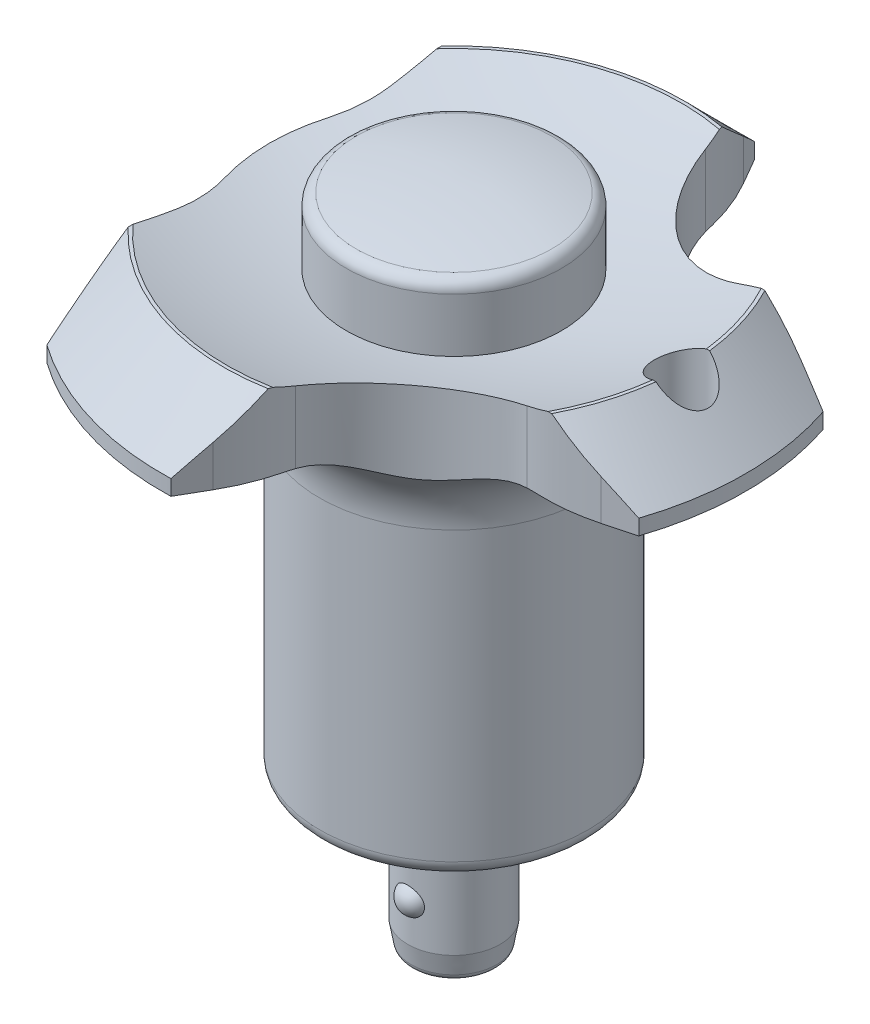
ISO-10303-21;
HEADER;
FILE_DESCRIPTION(('STEP AP214'),'2;1');
FILE_NAME('part.step','',(''),(''),'','','');
FILE_SCHEMA(('AUTOMOTIVE_DESIGN { 1 0 10303 214 1 1 1 1 }'));
ENDSEC;
DATA;
#1=APPLICATION_CONTEXT('core data for automotive mechanical design processes');
#2=APPLICATION_PROTOCOL_DEFINITION('international standard','automotive_design',2000,#1);
#3=PRODUCT_CONTEXT('',#1,'mechanical');
#4=PRODUCT('Part','Part','',(#3));
#5=PRODUCT_RELATED_PRODUCT_CATEGORY('part','',(#4));
#6=PRODUCT_DEFINITION_FORMATION('','',#4);
#7=PRODUCT_DEFINITION_CONTEXT('part definition',#1,'design');
#8=PRODUCT_DEFINITION('design','',#6,#7);
#9=PRODUCT_DEFINITION_SHAPE('','',#8);
#10=(LENGTH_UNIT() NAMED_UNIT(*) SI_UNIT(.MILLI.,.METRE.));
#11=(NAMED_UNIT(*) PLANE_ANGLE_UNIT() SI_UNIT($,.RADIAN.));
#12=(NAMED_UNIT(*) SI_UNIT($,.STERADIAN.) SOLID_ANGLE_UNIT());
#13=UNCERTAINTY_MEASURE_WITH_UNIT(LENGTH_MEASURE(1.E-05),#10,'distance_accuracy_value','');
#14=(GEOMETRIC_REPRESENTATION_CONTEXT(3) GLOBAL_UNCERTAINTY_ASSIGNED_CONTEXT((#13)) GLOBAL_UNIT_ASSIGNED_CONTEXT((#10,
#11,#12)) REPRESENTATION_CONTEXT('',''));
#15=CARTESIAN_POINT('',(0.,0.,0.));
#16=DIRECTION('',(0.,0.,1.));
#17=DIRECTION('',(1.,0.,0.));
#18=AXIS2_PLACEMENT_3D('',#15,#16,#17);
#19=CARTESIAN_POINT('',(0.,33.2,0.));
#20=DIRECTION('',(0.,-1.,0.));
#21=DIRECTION('',(0.,0.,-1.));
#22=AXIS2_PLACEMENT_3D('',#19,#20,#21);
#23=CYLINDRICAL_SURFACE('',#22,7.);
#24=CARTESIAN_POINT('',(0.,31.7572687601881,0.));
#25=DIRECTION('',(0.,-1.,0.));
#26=DIRECTION('',(0.,0.,-1.));
#27=AXIS2_PLACEMENT_3D('',#24,#25,#26);
#28=CIRCLE('',#27,7.);
#29=CARTESIAN_POINT('',(0.,31.7572687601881,-7.));
#30=VERTEX_POINT('',#29);
#31=EDGE_CURVE('P0_E11',#30,#30,#28,.T.);
#32=ORIENTED_EDGE('',*,*,#31,.T.);
#33=EDGE_LOOP('',(#32));
#34=FACE_BOUND('',#33,.T.);
#35=CARTESIAN_POINT('',(0.,15.,0.));
#36=DIRECTION('',(0.,1.,0.));
#37=DIRECTION('',(0.,0.,1.));
#38=AXIS2_PLACEMENT_3D('',#35,#36,#37);
#39=CIRCLE('',#38,7.);
#40=CARTESIAN_POINT('',(0.,15.,7.));
#41=VERTEX_POINT('',#40);
#42=EDGE_CURVE('P0_E48',#41,#41,#39,.T.);
#43=ORIENTED_EDGE('',*,*,#42,.T.);
#44=EDGE_LOOP('',(#43));
#45=FACE_BOUND('',#44,.T.);
#46=ADVANCED_FACE('P0_F16',(#34,#45),#23,.T.);
#47=CARTESIAN_POINT('',(0.,15.,0.));
#48=DIRECTION('',(0.,1.,0.));
#49=DIRECTION('',(0.,0.,1.));
#50=AXIS2_PLACEMENT_3D('',#47,#48,#49);
#51=PLANE('',#50);
#52=ORIENTED_EDGE('',*,*,#42,.F.);
#53=EDGE_LOOP('',(#52));
#54=FACE_BOUND('',#53,.T.);
#55=ADVANCED_FACE('P0_F28',(#54),#51,.F.);
#56=CARTESIAN_POINT('',(0.,2.17499999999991,0.));
#57=DIRECTION('',(0.,1.,0.));
#58=DIRECTION('',(-1.,0.,0.));
#59=AXIS2_PLACEMENT_3D('',#56,#57,#58);
#60=SPHERICAL_SURFACE('',#59,31.0250000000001);
#61=CARTESIAN_POINT('',(0.,32.5402568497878,0.));
#62=DIRECTION('',(0.,-1.,0.));
#63=DIRECTION('',(0.,0.,-1.));
#64=AXIS2_PLACEMENT_3D('',#61,#62,#63);
#65=CIRCLE('',#64,6.36410256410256);
#66=CARTESIAN_POINT('',(0.,32.5402568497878,-6.36410256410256));
#67=VERTEX_POINT('',#66);
#68=EDGE_CURVE('P0_E23',#67,#67,#65,.F.);
#69=ORIENTED_EDGE('',*,*,#68,.T.);
#70=EDGE_LOOP('',(#69));
#71=FACE_BOUND('',#70,.T.);
#72=CARTESIAN_POINT('',(0.,33.2,0.));
#73=VERTEX_POINT('',#72);
#74=VERTEX_LOOP('',#73);
#75=FACE_BOUND('',#74,.T.);
#76=ADVANCED_FACE('P0_F26',(#71,#75),#60,.T.);
#77=CARTESIAN_POINT('',(0.,31.7572687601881,0.));
#78=DIRECTION('',(0.,-1.,0.));
#79=DIRECTION('',(0.,0.,-1.));
#80=AXIS2_PLACEMENT_3D('',#77,#78,#79);
#81=TOROIDAL_SURFACE('',#80,6.2,0.8);
#82=ORIENTED_EDGE('',*,*,#31,.F.);
#83=EDGE_LOOP('',(#82));
#84=FACE_BOUND('',#83,.T.);
#85=ORIENTED_EDGE('',*,*,#68,.F.);
#86=EDGE_LOOP('',(#85));
#87=FACE_BOUND('',#86,.T.);
#88=ADVANCED_FACE('P0_F18',(#84,#87),#81,.T.);
#89=CLOSED_SHELL('',(#46,#55,#76,#88));
#90=MANIFOLD_SOLID_BREP('P0_B1',#89);
#91=CARTESIAN_POINT('',(-19.,30.2,0.));
#92=DIRECTION('',(0.,1.,0.));
#93=DIRECTION('',(-1.,0.,0.));
#94=AXIS2_PLACEMENT_3D('',#91,#92,#93);
#95=PLANE('',#94);
#96=CARTESIAN_POINT('',(0.,30.2,0.));
#97=DIRECTION('',(0.,1.,0.));
#98=DIRECTION('',(-1.,0.,0.));
#99=AXIS2_PLACEMENT_3D('',#96,#97,#98);
#100=CIRCLE('',#99,14.790199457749);
#101=CARTESIAN_POINT('',(14.6866680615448,30.2,-1.74693481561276));
#102=VERTEX_POINT('',#101);
#103=CARTESIAN_POINT('',(13.0598212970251,30.2,-6.94197865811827));
#104=VERTEX_POINT('',#103);
#105=EDGE_CURVE('P1_E287',#102,#104,#100,.T.);
#106=ORIENTED_EDGE('',*,*,#105,.F.);
#107=CARTESIAN_POINT('',(14.790199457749,30.2,0.));
#108=DIRECTION('',(0.,1.,0.));
#109=DIRECTION('',(0.,0.,1.));
#110=AXIS2_PLACEMENT_3D('',#107,#108,#109);
#111=CIRCLE('',#110,1.75);
#112=CARTESIAN_POINT('',(14.8979566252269,30.2,-1.74667924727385));
#113=VERTEX_POINT('',#112);
#114=EDGE_CURVE('P1_E40',#113,#102,#111,.T.);
#115=ORIENTED_EDGE('',*,*,#114,.F.);
#116=CARTESIAN_POINT('',(0.,30.2,0.));
#117=DIRECTION('',(0.,1.,0.));
#118=DIRECTION('',(-1.,0.,0.));
#119=AXIS2_PLACEMENT_3D('',#116,#117,#118);
#120=CIRCLE('',#119,15.);
#121=CARTESIAN_POINT('',(13.3001566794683,30.2,-6.93583681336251));
#122=VERTEX_POINT('',#121);
#123=EDGE_CURVE('P1_E231',#113,#122,#120,.T.);
#124=ORIENTED_EDGE('',*,*,#123,.T.);
#125=CARTESIAN_POINT('',(12.8606666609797,30.2,5.55643473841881));
#126=DIRECTION('',(0.,-1.,0.));
#127=DIRECTION('',(0.,0.,-1.));
#128=AXIS2_PLACEMENT_3D('',#125,#126,#127);
#129=CIRCLE('',#128,12.4999999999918);
#130=EDGE_CURVE('P1_E520',#104,#122,#129,.T.);
#131=ORIENTED_EDGE('',*,*,#130,.F.);
#132=EDGE_LOOP('',(#106,#115,#124,#131));
#133=FACE_BOUND('',#132,.T.);
#134=ADVANCED_FACE('P1_F16',(#133),#95,.T.);
#135=CARTESIAN_POINT('',(13.3001566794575,30.2,6.9358368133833));
#136=VERTEX_POINT('',#135);
#137=CARTESIAN_POINT('',(14.8979566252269,30.2,1.74667924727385));
#138=VERTEX_POINT('',#137);
#139=EDGE_CURVE('P1_E229',#136,#138,#120,.T.);
#140=ORIENTED_EDGE('',*,*,#139,.T.);
#141=CARTESIAN_POINT('',(14.6866680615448,30.2,1.74693481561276));
#142=VERTEX_POINT('',#141);
#143=EDGE_CURVE('P1_E213',#142,#138,#111,.T.);
#144=ORIENTED_EDGE('',*,*,#143,.F.);
#145=CARTESIAN_POINT('',(13.0598212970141,30.2,6.94197865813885));
#146=VERTEX_POINT('',#145);
#147=EDGE_CURVE('P1_E285',#146,#142,#100,.T.);
#148=ORIENTED_EDGE('',*,*,#147,.F.);
#149=CARTESIAN_POINT('',(12.8606666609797,30.2,-5.55643473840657));
#150=DIRECTION('',(0.,-1.,0.));
#151=DIRECTION('',(0.,0.,1.));
#152=AXIS2_PLACEMENT_3D('',#149,#150,#151);
#153=CIRCLE('',#152,12.5);
#154=EDGE_CURVE('P1_E236',#136,#146,#153,.T.);
#155=ORIENTED_EDGE('',*,*,#154,.F.);
#156=EDGE_LOOP('',(#140,#144,#148,#155));
#157=FACE_BOUND('',#156,.T.);
#158=ADVANCED_FACE('P1_F235',(#157),#95,.T.);
#159=CARTESIAN_POINT('',(-14.25,25.2,0.));
#160=DIRECTION('',(0.,-1.,0.));
#161=DIRECTION('',(1.,0.,0.));
#162=AXIS2_PLACEMENT_3D('',#159,#160,#161);
#163=PLANE('',#162);
#164=CARTESIAN_POINT('',(0.,25.2,0.));
#165=DIRECTION('',(0.,1.,0.));
#166=DIRECTION('',(-1.,0.,0.));
#167=AXIS2_PLACEMENT_3D('',#164,#165,#166);
#168=CIRCLE('',#167,14.25);
#169=CARTESIAN_POINT('',(12.4476557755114,25.2000000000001,6.93674027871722));
#170=VERTEX_POINT('',#169);
#171=CARTESIAN_POINT('',(14.1563337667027,25.2,1.63116960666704));
#172=VERTEX_POINT('',#171);
#173=EDGE_CURVE('P1_E265',#170,#172,#168,.T.);
#174=ORIENTED_EDGE('',*,*,#173,.T.);
#175=CARTESIAN_POINT('',(14.790199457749,25.2,0.));
#176=DIRECTION('',(0.,-1.,0.));
#177=DIRECTION('',(1.,0.,0.));
#178=AXIS2_PLACEMENT_3D('',#175,#176,#177);
#179=CIRCLE('',#178,1.75);
#180=CARTESIAN_POINT('',(14.1563337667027,25.2,-1.63116960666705));
#181=VERTEX_POINT('',#180);
#182=EDGE_CURVE('P1_E32',#172,#181,#179,.F.);
#183=ORIENTED_EDGE('',*,*,#182,.T.);
#184=CARTESIAN_POINT('',(12.4476557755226,25.2,-6.93674027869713));
#185=VERTEX_POINT('',#184);
#186=EDGE_CURVE('P1_E266',#181,#185,#168,.T.);
#187=ORIENTED_EDGE('',*,*,#186,.T.);
#188=CARTESIAN_POINT('',(12.8606666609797,25.2,5.55643473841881));
#189=DIRECTION('',(0.,-1.,0.));
#190=DIRECTION('',(1.,0.,0.));
#191=AXIS2_PLACEMENT_3D('',#188,#189,#190);
#192=CIRCLE('',#191,12.4999999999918);
#193=CARTESIAN_POINT('',(16.0959047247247,25.2,-6.51763809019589));
#194=VERTEX_POINT('',#193);
#195=EDGE_CURVE('P1_E1037',#185,#194,#192,.T.);
#196=ORIENTED_EDGE('',*,*,#195,.T.);
#197=DIRECTION('',(0.965925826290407,0.,0.258819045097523));
#198=VECTOR('',#197,1.);
#199=CARTESIAN_POINT('',(-10.5878003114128,25.2,-13.6675153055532));
#200=LINE('',#199,#198);
#201=CARTESIAN_POINT('',(18.0277563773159,25.2,-6.));
#202=VERTEX_POINT('',#201);
#203=EDGE_CURVE('P1_E609',#194,#202,#200,.T.);
#204=ORIENTED_EDGE('',*,*,#203,.T.);
#205=CARTESIAN_POINT('',(0.,25.2,0.));
#206=DIRECTION('',(0.,1.,0.));
#207=DIRECTION('',(-1.,0.,0.));
#208=AXIS2_PLACEMENT_3D('',#205,#206,#207);
#209=CIRCLE('',#208,19.);
#210=CARTESIAN_POINT('',(18.0277563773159,25.2,6.00000000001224));
#211=VERTEX_POINT('',#210);
#212=EDGE_CURVE('P1_E251',#211,#202,#209,.T.);
#213=ORIENTED_EDGE('',*,*,#212,.F.);
#214=DIRECTION('',(-0.965925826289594,0.,0.25881904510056));
#215=VECTOR('',#214,1.);
#216=CARTESIAN_POINT('',(-10.5878003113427,25.2,13.6675153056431));
#217=LINE('',#216,#215);
#218=CARTESIAN_POINT('',(16.0959047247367,25.2,6.51763809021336));
#219=VERTEX_POINT('',#218);
#220=EDGE_CURVE('P1_E512',#211,#219,#217,.T.);
#221=ORIENTED_EDGE('',*,*,#220,.T.);
#222=CARTESIAN_POINT('',(12.8606666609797,25.2,-5.55643473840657));
#223=DIRECTION('',(0.,-1.,0.));
#224=DIRECTION('',(1.,0.,0.));
#225=AXIS2_PLACEMENT_3D('',#222,#223,#224);
#226=CIRCLE('',#225,12.5);
#227=EDGE_CURVE('P1_E679',#219,#170,#226,.T.);
#228=ORIENTED_EDGE('',*,*,#227,.T.);
#229=EDGE_LOOP('',(#174,#183,#187,#196,#204,#213,#221,#228));
#230=FACE_BOUND('',#229,.T.);
#231=ADVANCED_FACE('P1_F733',(#230),#163,.T.);
#232=CARTESIAN_POINT('',(0.,19.7,0.));
#233=DIRECTION('',(0.,1.,0.));
#234=DIRECTION('',(-1.,0.,0.));
#235=AXIS2_PLACEMENT_3D('',#232,#233,#234);
#236=TOROIDAL_SURFACE('',#235,14.25,5.5);
#237=CARTESIAN_POINT('',(0.,19.7,0.));
#238=DIRECTION('',(0.,1.,0.));
#239=DIRECTION('',(-1.,0.,0.));
#240=AXIS2_PLACEMENT_3D('',#237,#238,#239);
#241=CIRCLE('',#240,8.75);
#242=CARTESIAN_POINT('',(-8.75,19.7,0.));
#243=VERTEX_POINT('',#242);
#244=EDGE_CURVE('P1_E274',#243,#243,#241,.T.);
#245=ORIENTED_EDGE('',*,*,#244,.T.);
#246=EDGE_LOOP('',(#245));
#247=FACE_BOUND('',#246,.T.);
#248=ORIENTED_EDGE('',*,*,#186,.F.);
#249=CARTESIAN_POINT('',(14.2502,25.1991429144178,-1.6646022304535));
#250=CARTESIAN_POINT('',(14.2042623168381,25.1999826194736,-1.64970098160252));
#251=CARTESIAN_POINT('',(14.1589561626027,25.2001952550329,-1.63289959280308));
#252=CARTESIAN_POINT('',(14.0699047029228,25.1994597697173,-1.59562095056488));
#253=CARTESIAN_POINT('',(14.0261590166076,25.1985119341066,-1.57514460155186));
#254=CARTESIAN_POINT('',(13.8979419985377,25.1940770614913,-1.50851564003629));
#255=CARTESIAN_POINT('',(13.8162015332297,25.189002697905,-1.45706889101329));
#256=CARTESIAN_POINT('',(13.6625097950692,25.1758106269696,-1.34166462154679));
#257=CARTESIAN_POINT('',(13.5905547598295,25.1676940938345,-1.2777119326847));
#258=CARTESIAN_POINT('',(13.4581285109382,25.1499438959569,-1.13898330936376));
#259=CARTESIAN_POINT('',(13.3976621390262,25.1403095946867,-1.06420283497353));
#260=CARTESIAN_POINT('',(13.2884525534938,25.1209736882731,-0.903822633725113));
#261=CARTESIAN_POINT('',(13.2400286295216,25.1112761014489,-0.818004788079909));
#262=CARTESIAN_POINT('',(13.1581906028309,25.0938088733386,-0.63929835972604));
#263=CARTESIAN_POINT('',(13.1247757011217,25.0860391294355,-0.546410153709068));
#264=CARTESIAN_POINT('',(13.0740128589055,25.0738737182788,-0.356203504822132));
#265=CARTESIAN_POINT('',(13.0566505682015,25.0694750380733,-0.258889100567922));
#266=CARTESIAN_POINT('',(13.0385484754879,25.064883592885,-0.0626413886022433));
#267=CARTESIAN_POINT('',(13.0378045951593,25.0646897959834,0.0362915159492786));
#268=CARTESIAN_POINT('',(13.0527361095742,25.068485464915,0.229974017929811));
#269=CARTESIAN_POINT('',(13.0679443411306,25.0723559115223,0.324762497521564));
#270=CARTESIAN_POINT('',(13.1135594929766,25.0833937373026,0.510409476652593));
#271=CARTESIAN_POINT('',(13.1439686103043,25.0905615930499,0.601267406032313));
#272=CARTESIAN_POINT('',(13.2194330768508,25.1070123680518,0.777474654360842));
#273=CARTESIAN_POINT('',(13.2646222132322,25.1163143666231,0.862764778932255));
#274=CARTESIAN_POINT('',(13.3683648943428,25.1353787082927,1.02476366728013));
#275=CARTESIAN_POINT('',(13.4269226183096,25.1451411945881,1.1014697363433));
#276=CARTESIAN_POINT('',(13.5576641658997,25.1636664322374,1.24624537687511));
#277=CARTESIAN_POINT('',(13.6301729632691,25.1723951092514,1.31402614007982));
#278=CARTESIAN_POINT('',(13.7857547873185,25.1868126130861,1.43644011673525));
#279=CARTESIAN_POINT('',(13.8688152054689,25.1925050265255,1.49108880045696));
#280=CARTESIAN_POINT('',(14.0028942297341,25.1978948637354,1.56381573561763));
#281=CARTESIAN_POINT('',(14.0510697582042,25.1991455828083,1.58715064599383));
#282=CARTESIAN_POINT('',(14.1493071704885,25.2002344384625,1.62929760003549));
#283=CARTESIAN_POINT('',(14.1993667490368,25.200074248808,1.64811497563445));
#284=CARTESIAN_POINT('',(14.2502,25.1991429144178,1.6646022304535));
#285=B_SPLINE_CURVE_WITH_KNOTS('',3,(#249,#250,#251,#252,#253,#254,#255,#256,#257,#258,#259,
#260,#261,#262,#263,#264,#265,#266,#267,#268,#269,#270,#271,#272,#273,#274,#275,#276,#277,#278,
#279,#280,#281,#282,#283,#284),.UNSPECIFIED.,.F.,.F.,(4,2,2,2,2,2,2,2,2,2,2,2,2,2,2,2,2,4),(0.,
0.144809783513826,0.289583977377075,0.57823191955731,0.866768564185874,1.15542654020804,
1.45107354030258,1.74670480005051,2.04207152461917,2.33736576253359,2.6242473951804,
2.91117050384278,3.20076622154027,3.49045259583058,3.78795379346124,4.08510278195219,
4.24551820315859,4.40574334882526),.UNSPECIFIED.);
#286=EDGE_CURVE('P1_E232',#181,#172,#285,.T.);
#287=ORIENTED_EDGE('',*,*,#286,.T.);
#288=ORIENTED_EDGE('',*,*,#173,.F.);
#289=CARTESIAN_POINT('',(14.2502,24.9717309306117,6.86609306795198));
#290=CARTESIAN_POINT('',(14.0793866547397,25.0150346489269,6.88522647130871));
#291=CARTESIAN_POINT('',(13.906667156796,25.0524848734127,6.900953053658));
#292=CARTESIAN_POINT('',(13.5583259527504,25.1151856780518,6.92529634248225));
#293=CARTESIAN_POINT('',(13.3827010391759,25.1404216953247,6.93390457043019));
#294=CARTESIAN_POINT('',(13.0330284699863,25.1777587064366,6.94358053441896));
#295=CARTESIAN_POINT('',(12.8590088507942,25.1900867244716,6.94478048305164));
#296=CARTESIAN_POINT('',(12.5107529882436,25.2018643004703,6.93987786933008));
#297=CARTESIAN_POINT('',(12.3365170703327,25.2013251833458,6.93378173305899));
#298=CARTESIAN_POINT('',(12.0782272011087,25.1906012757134,6.91934094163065));
#299=CARTESIAN_POINT('',(11.9937757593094,25.1855080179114,6.91375527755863));
#300=CARTESIAN_POINT('',(11.824887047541,25.1720758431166,6.90086699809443));
#301=CARTESIAN_POINT('',(11.74045147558,25.1637227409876,6.89355693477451));
#302=CARTESIAN_POINT('',(11.6562800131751,25.1537207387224,6.88540808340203));
#303=B_SPLINE_CURVE_WITH_KNOTS('',3,(#289,#290,#291,#292,#293,#294,#295,#296,#297,#298,#299,
#300,#301,#302),.UNSPECIFIED.,.F.,.F.,(4,2,2,2,2,2,4),(0.,0.5316805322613,1.06399342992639,
1.58677822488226,2.10910291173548,2.36340213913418,2.61882050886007),.UNSPECIFIED.);
#304=CARTESIAN_POINT('',(11.6564800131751,25.1537445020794,6.88542744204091));
#305=VERTEX_POINT('',#304);
#306=EDGE_CURVE('P1_E673',#170,#305,#303,.T.);
#307=ORIENTED_EDGE('',*,*,#306,.T.);
#308=CARTESIAN_POINT('',(11.6566800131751,25.1537682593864,6.88544680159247));
#309=CARTESIAN_POINT('',(11.5594002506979,25.1422170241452,6.87602741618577));
#310=CARTESIAN_POINT('',(11.4622162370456,25.1286218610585,6.8684202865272));
#311=CARTESIAN_POINT('',(11.2682690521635,25.0976778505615,6.85677712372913));
#312=CARTESIAN_POINT('',(11.1715057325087,25.0803304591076,6.85273970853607));
#313=CARTESIAN_POINT('',(10.8826272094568,25.0232534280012,6.8459061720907));
#314=CARTESIAN_POINT('',(10.6913672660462,24.978419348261,6.84833581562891));
#315=CARTESIAN_POINT('',(10.3134871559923,24.8783310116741,6.86648508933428));
#316=CARTESIAN_POINT('',(10.1268470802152,24.8231361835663,6.88213062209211));
#317=CARTESIAN_POINT('',(9.75739324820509,24.7051603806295,6.92601438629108));
#318=CARTESIAN_POINT('',(9.57458205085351,24.6423745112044,6.95426077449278));
#319=CARTESIAN_POINT('',(9.21451205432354,24.5130865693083,7.02261490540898));
#320=CARTESIAN_POINT('',(9.03721777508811,24.4466237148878,7.06261185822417));
#321=CARTESIAN_POINT('',(8.68599997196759,24.3129496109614,7.15446642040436));
#322=CARTESIAN_POINT('',(8.5120767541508,24.2457382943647,7.20632510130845));
#323=CARTESIAN_POINT('',(8.16692767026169,24.1146077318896,7.32220452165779));
#324=CARTESIAN_POINT('',(7.99570322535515,24.0506901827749,7.38623145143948));
#325=CARTESIAN_POINT('',(7.6556057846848,23.9311518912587,7.52704009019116));
#326=CARTESIAN_POINT('',(7.48673142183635,23.8755261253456,7.60381401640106));
#327=CARTESIAN_POINT('',(7.2072473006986,23.794570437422,7.74301998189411));
#328=CARTESIAN_POINT('',(7.09593153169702,23.7653165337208,7.80173499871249));
#329=CARTESIAN_POINT('',(6.87480574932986,23.7149414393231,7.92521803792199));
#330=CARTESIAN_POINT('',(6.76499543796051,23.6938186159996,7.9899848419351));
#331=CARTESIAN_POINT('',(6.54816816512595,23.6613802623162,8.1250385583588));
#332=CARTESIAN_POINT('',(6.4411389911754,23.6500103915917,8.19529247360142));
#333=CARTESIAN_POINT('',(6.23017950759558,23.6378456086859,8.34117425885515));
#334=CARTESIAN_POINT('',(6.12624899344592,23.6370499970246,8.41680177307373));
#335=CARTESIAN_POINT('',(5.92244869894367,23.6461066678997,8.57274294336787));
#336=CARTESIAN_POINT('',(5.82257913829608,23.6559595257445,8.65305685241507));
#337=CARTESIAN_POINT('',(5.62766430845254,23.6854547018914,8.8176065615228));
#338=CARTESIAN_POINT('',(5.53261973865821,23.7050984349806,8.90184292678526));
#339=CARTESIAN_POINT('',(5.25410671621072,23.7768366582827,9.16064349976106));
#340=CARTESIAN_POINT('',(5.07859966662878,23.8416457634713,9.34026674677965));
#341=CARTESIAN_POINT('',(4.76295492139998,23.983991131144,9.6943523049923));
#342=CARTESIAN_POINT('',(4.6210792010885,24.0599787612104,9.86795703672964));
#343=CARTESIAN_POINT('',(4.35338817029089,24.2183718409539,10.2246609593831));
#344=CARTESIAN_POINT('',(4.22759004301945,24.3007840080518,10.4077700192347));
#345=CARTESIAN_POINT('',(3.99189617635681,24.4640334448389,10.783365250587));
#346=CARTESIAN_POINT('',(3.88193483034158,24.5448759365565,10.975808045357));
#347=CARTESIAN_POINT('',(3.67736612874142,24.6990701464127,11.3714451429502));
#348=CARTESIAN_POINT('',(3.58274461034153,24.7724287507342,11.5746292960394));
#349=CARTESIAN_POINT('',(3.44515882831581,24.8787402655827,11.9063480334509));
#350=CARTESIAN_POINT('',(3.39691565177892,24.9159319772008,12.0313525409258));
#351=CARTESIAN_POINT('',(3.30636134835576,24.9847155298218,12.2849736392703));
#352=CARTESIAN_POINT('',(3.26404827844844,25.0163092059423,12.4135890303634));
#353=CARTESIAN_POINT('',(3.18537054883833,25.0730845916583,12.6751677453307));
#354=CARTESIAN_POINT('',(3.14905422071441,25.0982150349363,12.8081569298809));
#355=CARTESIAN_POINT('',(3.08307385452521,25.1407979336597,13.0771429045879));
#356=CARTESIAN_POINT('',(3.05341764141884,25.1582413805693,13.2131430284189));
#357=CARTESIAN_POINT('',(3.02728721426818,25.1713374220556,13.3502980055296));
#358=B_SPLINE_CURVE_WITH_KNOTS('',3,(#308,#309,#310,#311,#312,#313,#314,#315,#316,#317,#318,
#319,#320,#321,#322,#323,#324,#325,#326,#327,#328,#329,#330,#331,#332,#333,#334,#335,#336,#337,
#338,#339,#340,#341,#342,#343,#344,#345,#346,#347,#348,#349,#350,#351,#352,#353,#354,#355,#356,
#357),.UNSPECIFIED.,.F.,.F.,(4,2,2,2,2,2,2,2,2,2,2,2,2,2,2,2,2,2,2,2,2,2,2,2,4),(0.,
0.295159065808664,0.590203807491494,1.17861237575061,1.76374364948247,2.34925424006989,
2.9294124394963,3.50962306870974,4.09012966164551,4.67028311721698,5.05756933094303,
5.44477774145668,5.82981446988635,6.21482572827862,6.5998577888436,6.98494550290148,
7.76013818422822,8.46948591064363,9.17958553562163,9.88665317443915,10.5930642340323,
11.0099916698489,11.4267821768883,11.846783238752,12.2672752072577),.UNSPECIFIED.);
#359=CARTESIAN_POINT('',(3.02732533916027,25.1713182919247,13.3500980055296));
#360=VERTEX_POINT('',#359);
#361=EDGE_CURVE('P1_E505',#305,#360,#358,.T.);
#362=ORIENTED_EDGE('',*,*,#361,.T.);
#363=CARTESIAN_POINT('',(3.02736346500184,25.1712991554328,13.3498980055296));
#364=CARTESIAN_POINT('',(3.01298527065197,25.1785186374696,13.4253331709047));
#365=CARTESIAN_POINT('',(2.99788541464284,25.1843582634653,13.5007611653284));
#366=CARTESIAN_POINT('',(2.96628555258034,25.1933111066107,13.6513637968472));
#367=CARTESIAN_POINT('',(2.9497877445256,25.1964285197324,13.7265386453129));
#368=CARTESIAN_POINT('',(2.91539052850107,25.1999922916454,13.8766301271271));
#369=CARTESIAN_POINT('',(2.8974911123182,25.2004386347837,13.9515467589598));
#370=CARTESIAN_POINT('',(2.86029004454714,25.198702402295,14.1011237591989));
#371=CARTESIAN_POINT('',(2.840986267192,25.19651575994,14.1757835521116));
#372=CARTESIAN_POINT('',(2.82100769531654,25.1930331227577,14.2502));
#373=B_SPLINE_CURVE_WITH_KNOTS('',3,(#363,#364,#365,#366,#367,#368,#369,#370,#371,#372),
.UNSPECIFIED.,.F.,.F.,(4,2,2,2,4),(0.,0.23137741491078,0.462397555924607,0.693419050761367,
0.924797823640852),.UNSPECIFIED.);
#374=CARTESIAN_POINT('',(2.89703894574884,25.2000000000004,13.9524071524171));
#375=VERTEX_POINT('',#374);
#376=EDGE_CURVE('P1_E496',#360,#375,#373,.T.);
#377=ORIENTED_EDGE('',*,*,#376,.T.);
#378=CARTESIAN_POINT('',(-11.,25.2,9.05883546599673));
#379=VERTEX_POINT('',#378);
#380=EDGE_CURVE('P1_E258',#379,#375,#168,.T.);
#381=ORIENTED_EDGE('',*,*,#380,.F.);
#382=CARTESIAN_POINT('',(-11.,24.9921140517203,11.2691840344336));
#383=CARTESIAN_POINT('',(-11.,25.0567843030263,10.9498915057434));
#384=CARTESIAN_POINT('',(-11.,25.1047871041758,10.6273466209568));
#385=CARTESIAN_POINT('',(-11.,25.1717409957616,9.97923980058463));
#386=CARTESIAN_POINT('',(-11.,25.1906796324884,9.65367663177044));
#387=CARTESIAN_POINT('',(-11.,25.2039580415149,8.99956819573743));
#388=CARTESIAN_POINT('',(-11.,25.1981016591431,8.67101974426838));
#389=CARTESIAN_POINT('',(-11.,25.1740146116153,8.17881655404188));
#390=CARTESIAN_POINT('',(-11.,25.1634212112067,8.014726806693));
#391=CARTESIAN_POINT('',(-11.,25.1377182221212,7.68694909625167));
#392=CARTESIAN_POINT('',(-11.,25.122610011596,7.52326102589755));
#393=CARTESIAN_POINT('',(-11.,25.0717669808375,7.03633415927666));
#394=CARTESIAN_POINT('',(-11.,25.0303142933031,6.71369525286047));
#395=CARTESIAN_POINT('',(-11.,24.9367947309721,6.06994764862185));
#396=CARTESIAN_POINT('',(-11.,24.8847251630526,5.7488393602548));
#397=CARTESIAN_POINT('',(-11.,24.7748702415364,5.1068386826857));
#398=CARTESIAN_POINT('',(-11.,24.7170715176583,4.78594864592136));
#399=CARTESIAN_POINT('',(-11.,24.6013192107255,4.14420459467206));
#400=CARTESIAN_POINT('',(-11.,24.5433656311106,3.82335057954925));
#401=CARTESIAN_POINT('',(-11.,24.4336589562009,3.18341475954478));
#402=CARTESIAN_POINT('',(-11.,24.3818564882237,2.86434168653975));
#403=CARTESIAN_POINT('',(-11.,24.2898196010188,2.22446814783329));
#404=CARTESIAN_POINT('',(-11.,24.2495841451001,1.90366783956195));
#405=CARTESIAN_POINT('',(-11.,24.2019503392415,1.42187959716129));
#406=CARTESIAN_POINT('',(-11.,24.1882077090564,1.2615184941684));
#407=CARTESIAN_POINT('',(-11.,24.1653910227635,0.940468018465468));
#408=CARTESIAN_POINT('',(-11.,24.1563167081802,0.779778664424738));
#409=CARTESIAN_POINT('',(-11.,24.143191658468,0.458210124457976));
#410=CARTESIAN_POINT('',(-11.,24.1391403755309,0.297330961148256));
#411=CARTESIAN_POINT('',(-11.,24.1362183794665,-0.0244747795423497));
#412=CARTESIAN_POINT('',(-11.,24.1373476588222,-0.185401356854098));
#413=CARTESIAN_POINT('',(-11.,24.1447228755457,-0.506226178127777));
#414=CARTESIAN_POINT('',(-11.,24.1509398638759,-0.666125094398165));
#415=CARTESIAN_POINT('',(-11.,24.1682055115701,-0.985665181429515));
#416=CARTESIAN_POINT('',(-11.,24.1792544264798,-1.14530633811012));
#417=CARTESIAN_POINT('',(-11.,24.219068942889,-1.62371079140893));
#418=CARTESIAN_POINT('',(-11.,24.2545014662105,-1.94192401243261));
#419=CARTESIAN_POINT('',(-11.,24.3385656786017,-2.57798814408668));
#420=CARTESIAN_POINT('',(-11.,24.3872571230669,-2.89583070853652));
#421=CARTESIAN_POINT('',(-11.,24.4919761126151,-3.53025841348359));
#422=CARTESIAN_POINT('',(-11.,24.548003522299,-3.84684357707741));
#423=CARTESIAN_POINT('',(-11.,24.6620822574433,-4.4820711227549));
#424=CARTESIAN_POINT('',(-11.,24.7201455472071,-4.80071126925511));
#425=CARTESIAN_POINT('',(-11.,24.8324151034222,-5.43871666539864));
#426=CARTESIAN_POINT('',(-11.,24.8866211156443,-5.75808196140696));
#427=CARTESIAN_POINT('',(-11.,24.9859562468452,-6.39733020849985));
#428=CARTESIAN_POINT('',(-11.,25.0311107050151,-6.71720911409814));
#429=CARTESIAN_POINT('',(-11.,25.1077933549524,-7.35857952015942));
#430=CARTESIAN_POINT('',(-11.,25.1393262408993,-7.68007042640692));
#431=CARTESIAN_POINT('',(-11.,25.1697982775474,-8.11715183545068));
#432=CARTESIAN_POINT('',(-11.,25.1766574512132,-8.23220294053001));
#433=CARTESIAN_POINT('',(-11.,25.1878642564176,-8.46246662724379));
#434=CARTESIAN_POINT('',(-11.,25.1922110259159,-8.57767925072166));
#435=CARTESIAN_POINT('',(-11.,25.2011705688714,-8.92329739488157));
#436=CARTESIAN_POINT('',(-11.,25.2017132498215,-9.15382903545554));
#437=CARTESIAN_POINT('',(-11.,25.1903513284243,-9.61413189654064));
#438=CARTESIAN_POINT('',(-11.,25.1784723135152,-9.84390370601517));
#439=CARTESIAN_POINT('',(-11.,25.140740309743,-10.3023467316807));
#440=CARTESIAN_POINT('',(-11.,25.1148864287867,-10.5310178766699));
#441=CARTESIAN_POINT('',(-11.,25.0473132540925,-10.9885778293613));
#442=CARTESIAN_POINT('',(-11.,25.0054249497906,-11.2174421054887));
#443=CARTESIAN_POINT('',(-11.,24.9043006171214,-11.6713763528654));
#444=CARTESIAN_POINT('',(-11.,24.8450629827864,-11.8964459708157));
#445=CARTESIAN_POINT('',(-11.,24.7077839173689,-12.3411322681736));
#446=CARTESIAN_POINT('',(-11.,24.6297189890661,-12.5607417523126));
#447=CARTESIAN_POINT('',(-11.,24.4536618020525,-12.9918183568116));
#448=CARTESIAN_POINT('',(-11.,24.3556774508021,-13.2032886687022));
#449=CARTESIAN_POINT('',(-11.,24.1698924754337,-13.556484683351));
#450=CARTESIAN_POINT('',(-11.,24.0871656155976,-13.7008916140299));
#451=CARTESIAN_POINT('',(-11.,23.9109463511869,-13.9829653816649));
#452=CARTESIAN_POINT('',(-11.,23.8174566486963,-14.1206338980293));
#453=CARTESIAN_POINT('',(-11.,23.6197462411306,-14.3878872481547));
#454=CARTESIAN_POINT('',(-11.,23.5155342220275,-14.5174784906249));
#455=CARTESIAN_POINT('',(-11.,23.2965133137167,-14.7672892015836));
#456=CARTESIAN_POINT('',(-11.,23.1817096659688,-14.887513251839));
#457=CARTESIAN_POINT('',(-11.,22.9406678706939,-15.1183431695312));
#458=CARTESIAN_POINT('',(-11.,22.814331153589,-15.2288464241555));
#459=CARTESIAN_POINT('',(-11.,22.5518429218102,-15.4373981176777));
#460=CARTESIAN_POINT('',(-11.,22.4156964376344,-15.5354528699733));
#461=CARTESIAN_POINT('',(-11.,22.1344061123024,-15.7177182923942));
#462=CARTESIAN_POINT('',(-11.,21.9892620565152,-15.8019286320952));
#463=CARTESIAN_POINT('',(-11.,21.6911496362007,-15.9551204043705));
#464=CARTESIAN_POINT('',(-11.,21.538182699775,-16.0241046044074));
#465=CARTESIAN_POINT('',(-11.,21.2470699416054,-16.1373916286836));
#466=CARTESIAN_POINT('',(-11.,21.1097302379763,-16.1837735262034));
#467=CARTESIAN_POINT('',(-11.,20.8313524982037,-16.2636266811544));
#468=CARTESIAN_POINT('',(-11.,20.690314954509,-16.2970996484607));
#469=CARTESIAN_POINT('',(-11.,20.405811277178,-16.3506365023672));
#470=CARTESIAN_POINT('',(-11.,20.2623467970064,-16.3707091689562));
#471=CARTESIAN_POINT('',(-11.,19.9741631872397,-16.3971811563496));
#472=CARTESIAN_POINT('',(-11.,19.8294441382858,-16.4035813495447));
#473=CARTESIAN_POINT('',(-11.,19.5542777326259,-16.4026645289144));
#474=CARTESIAN_POINT('',(-11.,19.4238243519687,-16.3966327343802));
#475=CARTESIAN_POINT('',(-11.,19.1638662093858,-16.3734483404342));
#476=CARTESIAN_POINT('',(-11.,19.0343617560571,-16.3562922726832));
#477=CARTESIAN_POINT('',(-11.,18.7773325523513,-16.3110726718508));
#478=CARTESIAN_POINT('',(-11.,18.6498069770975,-16.2830138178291));
#479=CARTESIAN_POINT('',(-11.,18.3975099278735,-16.2163096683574));
#480=CARTESIAN_POINT('',(-11.,18.2727395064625,-16.1776604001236));
#481=CARTESIAN_POINT('',(-11.,18.027459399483,-16.0904491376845));
#482=CARTESIAN_POINT('',(-11.,17.9069305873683,-16.0419409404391));
#483=CARTESIAN_POINT('',(-11.,17.6701345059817,-15.9354155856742));
#484=CARTESIAN_POINT('',(-11.,17.5538687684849,-15.8773950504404));
#485=CARTESIAN_POINT('',(-11.,17.2125645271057,-15.6899905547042));
#486=CARTESIAN_POINT('',(-11.,16.9947530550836,-15.547167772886));
#487=CARTESIAN_POINT('',(-11.,16.5674766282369,-15.2195235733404));
#488=CARTESIAN_POINT('',(-11.,16.3598110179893,-15.032382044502));
#489=CARTESIAN_POINT('',(-11.,15.9738188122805,-14.6295721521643));
#490=CARTESIAN_POINT('',(-11.,15.795534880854,-14.4138631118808));
#491=CARTESIAN_POINT('',(-11.,15.5182164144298,-14.0283602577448));
#492=CARTESIAN_POINT('',(-11.,15.4114026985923,-13.8640542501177));
#493=CARTESIAN_POINT('',(-11.,15.2126033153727,-13.5266286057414));
#494=CARTESIAN_POINT('',(-11.,15.1206227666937,-13.3535059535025));
#495=CARTESIAN_POINT('',(-11.,14.9512903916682,-13.0005546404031));
#496=CARTESIAN_POINT('',(-11.,14.8739205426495,-12.8207345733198));
#497=CARTESIAN_POINT('',(-11.,14.7330957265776,-12.4557862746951));
#498=CARTESIAN_POINT('',(-11.,14.6696393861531,-12.2706585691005));
#499=CARTESIAN_POINT('',(-11.,14.5325042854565,-11.8193626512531));
#500=CARTESIAN_POINT('',(-11.,14.4653663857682,-11.5511980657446));
#501=CARTESIAN_POINT('',(-11.,14.3550191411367,-11.0098768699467));
#502=CARTESIAN_POINT('',(-11.,14.3118302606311,-10.7367161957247));
#503=CARTESIAN_POINT('',(-11.,14.2466685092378,-10.1861508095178));
#504=CARTESIAN_POINT('',(-11.,14.2248344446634,-9.90873008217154));
#505=CARTESIAN_POINT('',(-11.,14.200147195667,-9.35345519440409));
#506=CARTESIAN_POINT('',(-11.,14.1972707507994,-9.07560198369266));
#507=CARTESIAN_POINT('',(-11.,14.2079234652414,-8.5053839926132));
#508=CARTESIAN_POINT('',(-11.,14.2223389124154,-8.21303845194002));
#509=CARTESIAN_POINT('',(-11.,14.2657646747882,-7.62940413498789));
#510=CARTESIAN_POINT('',(-11.,14.2947793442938,-7.33811570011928));
#511=CARTESIAN_POINT('',(-11.,14.3640864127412,-6.75635827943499));
#512=CARTESIAN_POINT('',(-11.,14.4044004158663,-6.46589195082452));
#513=CARTESIAN_POINT('',(-11.,14.4927509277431,-5.88619144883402));
#514=CARTESIAN_POINT('',(-11.,14.5407868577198,-5.5969571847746));
#515=CARTESIAN_POINT('',(-11.,14.6408230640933,-5.01941070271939));
#516=CARTESIAN_POINT('',(-11.,14.692820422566,-4.731097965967));
#517=CARTESIAN_POINT('',(-11.,14.7968322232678,-4.15446329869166));
#518=CARTESIAN_POINT('',(-11.,14.8488466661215,-3.86614136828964));
#519=CARTESIAN_POINT('',(-11.,14.9485485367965,-3.28921282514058));
#520=CARTESIAN_POINT('',(-11.,14.9962428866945,-3.00060744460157));
#521=CARTESIAN_POINT('',(-11.,15.08301039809,-2.42207235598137));
#522=CARTESIAN_POINT('',(-11.,15.1220839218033,-2.1321427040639));
#523=CARTESIAN_POINT('',(-11.,15.1877312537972,-1.54850674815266));
#524=CARTESIAN_POINT('',(-11.,15.2142043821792,-1.25478867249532));
#525=CARTESIAN_POINT('',(-11.,15.250955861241,-0.666337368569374));
#526=CARTESIAN_POINT('',(-11.,15.26123640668,-0.371604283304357));
#527=CARTESIAN_POINT('',(-11.,15.2642511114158,0.217987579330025));
#528=CARTESIAN_POINT('',(-11.,15.2569833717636,0.512846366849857));
#529=CARTESIAN_POINT('',(-11.,15.2258629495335,1.10168450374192));
#530=CARTESIAN_POINT('',(-11.,15.2020082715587,1.39566374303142));
#531=CARTESIAN_POINT('',(-11.,15.1405496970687,1.98337834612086));
#532=CARTESIAN_POINT('',(-11.,15.102888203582,2.2771074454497));
#533=CARTESIAN_POINT('',(-11.,15.0180025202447,2.86319239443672));
#534=CARTESIAN_POINT('',(-11.,14.9707763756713,3.15554795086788));
#535=CARTESIAN_POINT('',(-11.,14.8712826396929,3.73956613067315));
#536=CARTESIAN_POINT('',(-11.,14.8190118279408,4.03122818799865));
#537=CARTESIAN_POINT('',(-11.,14.713902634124,4.61442779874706));
#538=CARTESIAN_POINT('',(-11.,14.6610642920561,4.90596535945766));
#539=CARTESIAN_POINT('',(-11.,14.5748275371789,5.39900386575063));
#540=CARTESIAN_POINT('',(-11.,14.5404895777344,5.60033768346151));
#541=CARTESIAN_POINT('',(-11.,14.4747988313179,6.00345703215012));
#542=CARTESIAN_POINT('',(-11.,14.4434454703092,6.20524246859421));
#543=CARTESIAN_POINT('',(-11.,14.3850007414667,6.6090523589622));
#544=CARTESIAN_POINT('',(-11.,14.3579014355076,6.81107564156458));
#545=CARTESIAN_POINT('',(-11.,14.3090724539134,7.21577452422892));
#546=CARTESIAN_POINT('',(-11.,14.2873429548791,7.41845014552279));
#547=CARTESIAN_POINT('',(-11.,14.232074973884,8.02591550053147));
#548=CARTESIAN_POINT('',(-11.,14.2082181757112,8.43167372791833));
#549=CARTESIAN_POINT('',(-11.,14.1953179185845,9.24403992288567));
#550=CARTESIAN_POINT('',(-11.,14.2062719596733,9.65064782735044));
#551=CARTESIAN_POINT('',(-11.,14.2565042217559,10.2728500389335));
#552=CARTESIAN_POINT('',(-11.,14.2803170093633,10.4897044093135));
#553=CARTESIAN_POINT('',(-11.,14.3417439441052,10.9213812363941));
#554=CARTESIAN_POINT('',(-11.,14.3793551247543,11.1362041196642));
#555=CARTESIAN_POINT('',(-11.,14.5151208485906,11.7773643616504));
#556=CARTESIAN_POINT('',(-11.,14.6361323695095,12.1992845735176));
#557=CARTESIAN_POINT('',(-11.,14.9237036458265,12.9538158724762));
#558=CARTESIAN_POINT('',(-11.,15.0803198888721,13.2901450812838));
#559=CARTESIAN_POINT('',(-11.,15.3546285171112,13.7715776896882));
#560=CARTESIAN_POINT('',(-11.,15.4525339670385,13.9280947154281));
#561=CARTESIAN_POINT('',(-11.,15.6616620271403,14.2320073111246));
#562=CARTESIAN_POINT('',(-11.,15.7728821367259,14.3794045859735));
#563=CARTESIAN_POINT('',(-11.,15.9868432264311,14.6371402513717));
#564=CARTESIAN_POINT('',(-11.,16.0873843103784,14.7493100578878));
#565=CARTESIAN_POINT('',(-11.,16.2970411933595,14.9653164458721));
#566=CARTESIAN_POINT('',(-11.,16.4061553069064,15.0691546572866));
#567=CARTESIAN_POINT('',(-11.,16.6326933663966,15.2675150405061));
#568=CARTESIAN_POINT('',(-11.,16.7501229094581,15.3620308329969));
#569=CARTESIAN_POINT('',(-11.,16.9926442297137,15.5405531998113));
#570=CARTESIAN_POINT('',(-11.,17.1177322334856,15.6245648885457));
#571=CARTESIAN_POINT('',(-11.,17.3757564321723,15.7816015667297));
#572=CARTESIAN_POINT('',(-11.,17.50873832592,15.8545516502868));
#573=CARTESIAN_POINT('',(-11.,17.7808412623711,15.9877862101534));
#574=CARTESIAN_POINT('',(-11.,17.9199594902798,16.0480764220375));
#575=CARTESIAN_POINT('',(-11.,18.2032644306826,16.1551425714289));
#576=CARTESIAN_POINT('',(-11.,18.3474496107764,16.2019225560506));
#577=CARTESIAN_POINT('',(-11.,18.6396754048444,16.2812716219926));
#578=CARTESIAN_POINT('',(-11.,18.7877155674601,16.3138423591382));
#579=CARTESIAN_POINT('',(-11.,19.0701169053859,16.3615335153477));
#580=CARTESIAN_POINT('',(-11.,19.204225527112,16.3781604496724));
#581=CARTESIAN_POINT('',(-11.,19.4733849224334,16.3994940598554));
#582=CARTESIAN_POINT('',(-11.,19.6084356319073,16.4042015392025));
#583=CARTESIAN_POINT('',(-11.,19.8783792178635,16.4016353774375));
#584=CARTESIAN_POINT('',(-11.,20.0132721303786,16.3943654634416));
#585=CARTESIAN_POINT('',(-11.,20.2818883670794,16.3679469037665));
#586=CARTESIAN_POINT('',(-11.,20.4156117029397,16.3487983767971));
#587=CARTESIAN_POINT('',(-11.,20.6747131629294,16.3000297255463));
#588=CARTESIAN_POINT('',(-11.,20.8001908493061,16.2709359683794));
#589=CARTESIAN_POINT('',(-11.,21.0483588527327,16.2024953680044));
#590=CARTESIAN_POINT('',(-11.,21.1710482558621,16.1631452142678));
#591=CARTESIAN_POINT('',(-11.,21.4128001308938,16.0746424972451));
#592=CARTESIAN_POINT('',(-11.,21.5318634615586,16.0254922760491));
#593=CARTESIAN_POINT('',(-11.,21.7657528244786,15.9178858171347));
#594=CARTESIAN_POINT('',(-11.,21.8805772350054,15.8594260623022));
#595=CARTESIAN_POINT('',(-11.,22.1096769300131,15.7313777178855));
#596=CARTESIAN_POINT('',(-11.,22.2237615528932,15.6614477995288));
#597=CARTESIAN_POINT('',(-11.,22.4461450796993,15.5128978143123));
#598=CARTESIAN_POINT('',(-11.,22.5544418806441,15.4342746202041));
#599=CARTESIAN_POINT('',(-11.,22.8698200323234,15.1865543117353));
#600=CARTESIAN_POINT('',(-11.,23.0676310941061,15.0054694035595));
#601=CARTESIAN_POINT('',(-11.,23.4562962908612,14.5960330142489));
#602=CARTESIAN_POINT('',(-11.,23.6439424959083,14.3646663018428));
#603=CARTESIAN_POINT('',(-11.,23.9849040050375,13.877514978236));
#604=CARTESIAN_POINT('',(-11.,24.1381558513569,13.621686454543));
#605=CARTESIAN_POINT('',(-11.,24.4437796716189,13.0285566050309));
#606=CARTESIAN_POINT('',(-11.,24.5869466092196,12.6865308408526));
#607=CARTESIAN_POINT('',(-11.,24.8244674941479,11.9874225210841));
#608=CARTESIAN_POINT('',(-11.,24.9189557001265,11.6303843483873));
#609=CARTESIAN_POINT('',(-11.,24.9921140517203,11.2691840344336));
#610=B_SPLINE_CURVE_WITH_KNOTS('',3,(#382,#383,#384,#385,#386,#387,#388,#389,#390,#391,#392,
#393,#394,#395,#396,#397,#398,#399,#400,#401,#402,#403,#404,#405,#406,#407,#408,#409,#410,#411,
#412,#413,#414,#415,#416,#417,#418,#419,#420,#421,#422,#423,#424,#425,#426,#427,#428,#429,#430,
#431,#432,#433,#434,#435,#436,#437,#438,#439,#440,#441,#442,#443,#444,#445,#446,#447,#448,#449,
#450,#451,#452,#453,#454,#455,#456,#457,#458,#459,#460,#461,#462,#463,#464,#465,#466,#467,#468,
#469,#470,#471,#472,#473,#474,#475,#476,#477,#478,#479,#480,#481,#482,#483,#484,#485,#486,#487,
#488,#489,#490,#491,#492,#493,#494,#495,#496,#497,#498,#499,#500,#501,#502,#503,#504,#505,#506,
#507,#508,#509,#510,#511,#512,#513,#514,#515,#516,#517,#518,#519,#520,#521,#522,#523,#524,#525,
#526,#527,#528,#529,#530,#531,#532,#533,#534,#535,#536,#537,#538,#539,#540,#541,#542,#543,#544,
#545,#546,#547,#548,#549,#550,#551,#552,#553,#554,#555,#556,#557,#558,#559,#560,#561,#562,#563,
#564,#565,#566,#567,#568,#569,#570,#571,#572,#573,#574,#575,#576,#577,#578,#579,#580,#581,#582,
#583,#584,#585,#586,#587,#588,#589,#590,#591,#592,#593,#594,#595,#596,#597,#598,#599,#600,#601,
#602,#603,#604,#605,#606,#607,#608,#609),.UNSPECIFIED.,.T.,.F.,(4,2,2,2,2,2,2,2,2,2,2,2,2,2,2,2,
2,2,2,2,2,2,2,2,2,2,2,2,2,2,2,2,2,2,2,2,2,2,2,2,2,2,2,2,2,2,2,2,2,2,2,2,2,2,2,2,2,2,2,2,2,2,2,2,
2,2,2,2,2,2,2,2,2,2,2,2,2,2,2,2,2,2,2,2,2,2,2,2,2,2,2,2,2,2,2,2,2,2,2,2,2,2,2,2,2,2,2,2,2,2,2,2,
2,4),(0.,0.976815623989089,1.95404968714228,2.9390290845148,3.43227387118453,3.92536824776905,
4.90094052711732,5.8767605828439,6.85491409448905,7.83304605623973,8.8027031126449,
9.77227323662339,10.2550613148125,10.7378226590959,11.2205313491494,11.7032393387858,
12.1832196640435,12.6632253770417,13.6233298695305,14.5878351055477,15.5523225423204,
16.5239919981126,17.495725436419,18.4646993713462,19.4333391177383,19.7790816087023,
20.1249426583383,20.8162264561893,21.5060890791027,22.1959957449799,22.8933840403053,
23.5908369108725,24.2891647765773,24.9872159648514,25.4860576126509,25.9847742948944,
26.4830901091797,26.981160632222,27.4839791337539,27.9865415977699,28.489116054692,
28.9915990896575,29.4258851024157,29.8601135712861,30.2940572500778,30.7279732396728,
31.1192818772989,31.5107125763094,31.9019754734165,32.2933853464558,32.6827141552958,
33.0721815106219,33.8502776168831,34.6857409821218,35.5224070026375,36.1095976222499,
36.6969904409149,37.2836538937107,37.8702594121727,38.698283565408,39.5270141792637,
40.3610964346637,41.1941551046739,42.0718001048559,42.9497070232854,43.8293040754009,
44.7088352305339,45.5877246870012,46.4666509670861,47.3441430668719,48.2215982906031,
49.1059515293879,49.9901848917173,50.8745139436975,51.7589493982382,52.6471171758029,
53.5354666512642,54.4243870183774,55.3132451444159,55.9259538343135,56.5385444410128,
57.1499779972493,57.761431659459,58.9797007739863,60.1978823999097,60.8519467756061,
61.5058706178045,62.8170256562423,63.9253269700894,64.4785858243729,65.031740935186,
65.4832078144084,65.9345861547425,66.3862712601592,66.8377355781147,67.292132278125,
67.7463226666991,68.2003768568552,68.654378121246,69.0592693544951,69.4641332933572,
69.8688712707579,70.2736052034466,70.6595839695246,71.0456874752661,71.4316988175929,
71.8178563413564,72.2188530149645,72.619994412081,73.4214517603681,74.3118469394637,
75.2038716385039,76.3119690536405,77.4169936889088),.UNSPECIFIED.);
#611=CARTESIAN_POINT('',(-11.,25.0560713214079,6.92820323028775));
#612=VERTEX_POINT('',#611);
#613=EDGE_CURVE('P1_E554',#379,#612,#610,.T.);
#614=ORIENTED_EDGE('',*,*,#613,.T.);
#615=CARTESIAN_POINT('',(-11.0000000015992,25.0560961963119,6.92840323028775));
#616=CARTESIAN_POINT('',(-11.0000016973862,25.0375205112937,6.77902194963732));
#617=CARTESIAN_POINT('',(-11.0026732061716,25.0180452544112,6.62978289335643));
#618=CARTESIAN_POINT('',(-11.0133543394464,24.9784592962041,6.33157027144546));
#619=CARTESIAN_POINT('',(-11.0213642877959,24.9583485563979,6.18259672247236));
#620=CARTESIAN_POINT('',(-11.0532604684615,24.8990700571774,5.73800457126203));
#621=CARTESIAN_POINT('',(-11.0850135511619,24.8606847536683,5.44277610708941));
#622=CARTESIAN_POINT('',(-11.1485280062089,24.8111009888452,5.00121455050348));
#623=CARTESIAN_POINT('',(-11.1723663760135,24.7958985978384,4.85415150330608));
#624=CARTESIAN_POINT('',(-11.2253532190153,24.769067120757,4.56065627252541));
#625=CARTESIAN_POINT('',(-11.2545012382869,24.7574377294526,4.41422403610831));
#626=CARTESIAN_POINT('',(-11.3182917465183,24.7384310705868,4.12132175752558));
#627=CARTESIAN_POINT('',(-11.3529670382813,24.7310804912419,3.97485706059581));
#628=CARTESIAN_POINT('',(-11.4089681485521,24.7236838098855,3.75603948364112));
#629=CARTESIAN_POINT('',(-11.4283045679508,24.7218231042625,3.68323096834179));
#630=CARTESIAN_POINT('',(-11.4682967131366,24.7193367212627,3.5379535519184));
#631=CARTESIAN_POINT('',(-11.4889524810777,24.7187110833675,3.46548466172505));
#632=CARTESIAN_POINT('',(-11.5102630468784,24.7187149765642,3.39320566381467));
#633=B_SPLINE_CURVE_WITH_KNOTS('',3,(#615,#616,#617,#618,#619,#620,#621,#622,#623,#624,#625,
#626,#627,#628,#629,#630,#631,#632),.UNSPECIFIED.,.F.,.F.,(4,2,2,2,2,2,2,2,4),(0.,
0.451514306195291,0.903056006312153,1.80027975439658,2.24944035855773,2.69856258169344,
3.15045689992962,3.37650341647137,3.60255715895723),.UNSPECIFIED.);
#634=CARTESIAN_POINT('',(-11.5102040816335,24.7187149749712,3.39340566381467));
#635=VERTEX_POINT('',#634);
#636=EDGE_CURVE('P1_E578',#612,#635,#633,.T.);
#637=ORIENTED_EDGE('',*,*,#636,.T.);
#638=CARTESIAN_POINT('',(0.,24.7187149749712,0.));
#639=DIRECTION('',(0.,-1.,0.));
#640=DIRECTION('',(1.,0.,0.));
#641=AXIS2_PLACEMENT_3D('',#638,#639,#640);
#642=CIRCLE('',#641,12.);
#643=CARTESIAN_POINT('',(-11.5102040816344,24.7187149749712,-3.39340566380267));
#644=VERTEX_POINT('',#643);
#645=EDGE_CURVE('P1_E585',#635,#644,#642,.T.);
#646=ORIENTED_EDGE('',*,*,#645,.T.);
#647=CARTESIAN_POINT('',(-11.5102630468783,24.7187149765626,-3.39320566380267));
#648=CARTESIAN_POINT('',(-11.4889524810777,24.7187110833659,-3.46548466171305));
#649=CARTESIAN_POINT('',(-11.4682967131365,24.7193367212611,-3.53795355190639));
#650=CARTESIAN_POINT('',(-11.4283045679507,24.7218231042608,-3.68323096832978));
#651=CARTESIAN_POINT('',(-11.408968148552,24.7236838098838,-3.7560394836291));
#652=CARTESIAN_POINT('',(-11.3529670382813,24.7310804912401,-3.9748570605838));
#653=CARTESIAN_POINT('',(-11.3182917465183,24.738431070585,-4.12132175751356));
#654=CARTESIAN_POINT('',(-11.2545012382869,24.7574377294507,-4.41422403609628));
#655=CARTESIAN_POINT('',(-11.2253532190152,24.7690671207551,-4.56065627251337));
#656=CARTESIAN_POINT('',(-11.1723663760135,24.7958985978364,-4.85415150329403));
#657=CARTESIAN_POINT('',(-11.1485280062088,24.8111009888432,-5.00121455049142));
#658=CARTESIAN_POINT('',(-11.0850135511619,24.8606847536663,-5.44277610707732));
#659=CARTESIAN_POINT('',(-11.0532604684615,24.8990700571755,-5.73800457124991));
#660=CARTESIAN_POINT('',(-11.0213642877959,24.9583485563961,-6.1825967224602));
#661=CARTESIAN_POINT('',(-11.0133543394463,24.9784592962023,-6.33157027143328));
#662=CARTESIAN_POINT('',(-11.0026732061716,25.0180452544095,-6.62978289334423));
#663=CARTESIAN_POINT('',(-11.0000016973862,25.0375205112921,-6.7790219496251));
#664=CARTESIAN_POINT('',(-11.0000000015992,25.0560961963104,-6.9284032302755));
#665=B_SPLINE_CURVE_WITH_KNOTS('',3,(#647,#648,#649,#650,#651,#652,#653,#654,#655,#656,#657,
#658,#659,#660,#661,#662,#663,#664),.UNSPECIFIED.,.F.,.F.,(4,2,2,2,2,2,2,2,4),(0.,
0.226053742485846,0.452100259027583,0.903994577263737,1.35311680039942,1.80227740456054,
2.69950115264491,3.15104285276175,3.60255715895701),.UNSPECIFIED.);
#666=CARTESIAN_POINT('',(-11.,25.0560713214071,-6.9282032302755));
#667=VERTEX_POINT('',#666);
#668=EDGE_CURVE('P1_E290',#644,#667,#665,.T.);
#669=ORIENTED_EDGE('',*,*,#668,.T.);
#670=CARTESIAN_POINT('',(-11.,24.9921140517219,-11.2691840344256));
#671=CARTESIAN_POINT('',(-11.,24.9457569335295,-11.4980676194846));
#672=CARTESIAN_POINT('',(-11.,24.8908440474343,-11.7252300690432));
#673=CARTESIAN_POINT('',(-11.,24.7625053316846,-12.17419026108));
#674=CARTESIAN_POINT('',(-11.,24.6890897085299,-12.39599088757));
#675=CARTESIAN_POINT('',(-11.,24.5221989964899,-12.8328577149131));
#676=CARTESIAN_POINT('',(-11.,24.4286543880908,-13.047897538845));
#677=CARTESIAN_POINT('',(-11.,24.2207033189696,-13.4676425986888));
#678=CARTESIAN_POINT('',(-11.,24.1063061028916,-13.6723523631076));
#679=CARTESIAN_POINT('',(-11.,23.8961461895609,-14.0049562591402));
#680=CARTESIAN_POINT('',(-11.,23.8061119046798,-14.1364917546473));
#681=CARTESIAN_POINT('',(-11.,23.616143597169,-14.392191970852));
#682=CARTESIAN_POINT('',(-11.,23.5162121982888,-14.5163586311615));
#683=CARTESIAN_POINT('',(-11.,23.3067010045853,-14.7559980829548));
#684=CARTESIAN_POINT('',(-11.,23.1971340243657,-14.8714820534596));
#685=CARTESIAN_POINT('',(-11.,22.9685945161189,-15.0926468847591));
#686=CARTESIAN_POINT('',(-11.,22.8496265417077,-15.1983324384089));
#687=CARTESIAN_POINT('',(-11.,22.6016618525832,-15.3995724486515));
#688=CARTESIAN_POINT('',(-11.,22.4725868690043,-15.4950307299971));
#689=CARTESIAN_POINT('',(-11.,22.2061260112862,-15.673425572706));
#690=CARTESIAN_POINT('',(-11.,22.0687442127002,-15.7563682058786));
#691=CARTESIAN_POINT('',(-11.,21.7865577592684,-15.9085843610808));
#692=CARTESIAN_POINT('',(-11.,21.6417517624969,-15.9778554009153));
#693=CARTESIAN_POINT('',(-11.,21.3459526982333,-16.1016039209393));
#694=CARTESIAN_POINT('',(-11.,21.194960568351,-16.1560836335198));
#695=CARTESIAN_POINT('',(-11.,20.9071439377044,-16.2435849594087));
#696=CARTESIAN_POINT('',(-11.,20.7708698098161,-16.2784247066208));
#697=CARTESIAN_POINT('',(-11.,20.4957225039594,-16.3355713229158));
#698=CARTESIAN_POINT('',(-11.,20.3568496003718,-16.3578795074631));
#699=CARTESIAN_POINT('',(-11.,20.0777210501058,-16.3896449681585));
#700=CARTESIAN_POINT('',(-11.,19.9374662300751,-16.3991095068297));
#701=CARTESIAN_POINT('',(-11.,19.656682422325,-16.4050767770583));
#702=CARTESIAN_POINT('',(-11.,19.5161534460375,-16.4015800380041));
#703=CARTESIAN_POINT('',(-11.,19.2469930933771,-16.3824578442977));
#704=CARTESIAN_POINT('',(-11.,19.1182915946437,-16.3678033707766));
#705=CARTESIAN_POINT('',(-11.,18.8625397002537,-16.3276989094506));
#706=CARTESIAN_POINT('',(-11.,18.7354898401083,-16.3022455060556));
#707=CARTESIAN_POINT('',(-11.,18.4839996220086,-16.2408507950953));
#708=CARTESIAN_POINT('',(-11.,18.3595584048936,-16.2049130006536));
#709=CARTESIAN_POINT('',(-11.,18.1140022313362,-16.1229407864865));
#710=CARTESIAN_POINT('',(-11.,17.9928885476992,-16.076902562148));
#711=CARTESIAN_POINT('',(-11.,17.7534210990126,-15.9746622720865));
#712=CARTESIAN_POINT('',(-11.,17.6351134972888,-15.9183520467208));
#713=CARTESIAN_POINT('',(-11.,17.4033238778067,-15.7965182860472));
#714=CARTESIAN_POINT('',(-11.,17.2898436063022,-15.7309914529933));
#715=CARTESIAN_POINT('',(-11.,16.957655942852,-15.5216176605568));
#716=CARTESIAN_POINT('',(-11.,16.7469352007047,-15.3648620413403));
#717=CARTESIAN_POINT('',(-11.,16.3331427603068,-15.0077586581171));
#718=CARTESIAN_POINT('',(-11.,16.1323510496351,-14.8047976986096));
#719=CARTESIAN_POINT('',(-11.,15.7618900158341,-14.371759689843));
#720=CARTESIAN_POINT('',(-11.,15.5922754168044,-14.141636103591));
#721=CARTESIAN_POINT('',(-11.,15.328022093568,-13.7286856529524));
#722=CARTESIAN_POINT('',(-11.,15.2256941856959,-13.5506829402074));
#723=CARTESIAN_POINT('',(-11.,15.0370895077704,-13.1862961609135));
#724=CARTESIAN_POINT('',(-11.,14.9508183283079,-12.9999092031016));
#725=CARTESIAN_POINT('',(-11.,14.7939632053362,-12.6211292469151));
#726=CARTESIAN_POINT('',(-11.,14.7233482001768,-12.4287490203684));
#727=CARTESIAN_POINT('',(-11.,14.5968014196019,-12.0392643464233));
#728=CARTESIAN_POINT('',(-11.,14.5408694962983,-11.8421599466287));
#729=CARTESIAN_POINT('',(-11.,14.4201946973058,-11.3530346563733));
#730=CARTESIAN_POINT('',(-11.,14.3632442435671,-11.0590802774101));
#731=CARTESIAN_POINT('',(-11.,14.2755590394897,-10.4672921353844));
#732=CARTESIAN_POINT('',(-11.,14.2448377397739,-10.1694564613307));
#733=CARTESIAN_POINT('',(-11.,14.2061265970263,-9.57021366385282));
#734=CARTESIAN_POINT('',(-11.,14.1983022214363,-9.2687962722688));
#735=CARTESIAN_POINT('',(-11.,14.2013060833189,-8.81681702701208));
#736=CARTESIAN_POINT('',(-11.,14.2047665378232,-8.66614798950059));
#737=CARTESIAN_POINT('',(-11.,14.2161509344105,-8.36503238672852));
#738=CARTESIAN_POINT('',(-11.,14.2240732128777,-8.21458575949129));
#739=CARTESIAN_POINT('',(-11.,14.2545912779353,-7.75256728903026));
#740=CARTESIAN_POINT('',(-11.,14.2838090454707,-7.44142878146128));
#741=CARTESIAN_POINT('',(-11.,14.3554051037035,-6.82065099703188));
#742=CARTESIAN_POINT('',(-11.,14.3977875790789,-6.51101222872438));
#743=CARTESIAN_POINT('',(-11.,14.4915738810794,-5.89231944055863));
#744=CARTESIAN_POINT('',(-11.,14.5430008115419,-5.5832690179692));
#745=CARTESIAN_POINT('',(-11.,14.6502529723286,-4.96597868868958));
#746=CARTESIAN_POINT('',(-11.,14.7060779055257,-4.65773872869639));
#747=CARTESIAN_POINT('',(-11.,14.8168556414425,-4.04328609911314));
#748=CARTESIAN_POINT('',(-11.,14.8718118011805,-3.73707405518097));
#749=CARTESIAN_POINT('',(-11.,14.9761002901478,-3.12364936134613));
#750=CARTESIAN_POINT('',(-11.,15.0254324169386,-2.81643667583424));
#751=CARTESIAN_POINT('',(-11.,15.1130261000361,-2.20159636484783));
#752=CARTESIAN_POINT('',(-11.,15.1513300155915,-1.89397501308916));
#753=CARTESIAN_POINT('',(-11.,15.2123990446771,-1.27718555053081));
#754=CARTESIAN_POINT('',(-11.,15.235167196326,-0.968017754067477));
#755=CARTESIAN_POINT('',(-11.,15.2620336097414,-0.348179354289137));
#756=CARTESIAN_POINT('',(-11.,15.2660924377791,-0.0375069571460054));
#757=CARTESIAN_POINT('',(-11.,15.2548302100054,0.5834894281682));
#758=CARTESIAN_POINT('',(-11.,15.2395078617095,0.893813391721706));
#759=CARTESIAN_POINT('',(-11.,15.1916191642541,1.51408899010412));
#760=CARTESIAN_POINT('',(-11.,15.1589964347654,1.82403606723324));
#761=CARTESIAN_POINT('',(-11.,15.0807611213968,2.44225760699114));
#762=CARTESIAN_POINT('',(-11.,15.035146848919,2.7505318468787));
#763=CARTESIAN_POINT('',(-11.,14.9357125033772,3.36836778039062));
#764=CARTESIAN_POINT('',(-11.,14.8818266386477,3.67791849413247));
#765=CARTESIAN_POINT('',(-11.,14.7715309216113,4.29655945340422));
#766=CARTESIAN_POINT('',(-11.,14.715121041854,4.60564969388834));
#767=CARTESIAN_POINT('',(-11.,14.6049519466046,5.22379621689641));
#768=CARTESIAN_POINT('',(-11.,14.5511885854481,5.53285174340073));
#769=CARTESIAN_POINT('',(-11.,14.450911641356,6.15212878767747));
#770=CARTESIAN_POINT('',(-11.,14.4043967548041,6.46235008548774));
#771=CARTESIAN_POINT('',(-11.,14.3451306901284,6.91520870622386));
#772=CARTESIAN_POINT('',(-11.,14.3277739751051,7.05724146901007));
#773=CARTESIAN_POINT('',(-11.,14.2958764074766,7.34166549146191));
#774=CARTESIAN_POINT('',(-11.,14.2813363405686,7.48405683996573));
#775=CARTESIAN_POINT('',(-11.,14.2554979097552,7.76889550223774));
#776=CARTESIAN_POINT('',(-11.,14.2441941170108,7.91134231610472));
#777=CARTESIAN_POINT('',(-11.,14.2251860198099,8.1964639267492));
#778=CARTESIAN_POINT('',(-11.,14.217481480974,8.33913870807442));
#779=CARTESIAN_POINT('',(-11.,14.2003700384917,8.76681920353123));
#780=CARTESIAN_POINT('',(-11.,14.1969057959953,9.05210085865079));
#781=CARTESIAN_POINT('',(-11.,14.2088952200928,9.62242024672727));
#782=CARTESIAN_POINT('',(-11.,14.2243545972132,9.90745788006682));
#783=CARTESIAN_POINT('',(-11.,14.2729063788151,10.4296028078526));
#784=CARTESIAN_POINT('',(-11.,14.3027435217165,10.667008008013));
#785=CARTESIAN_POINT('',(-11.,14.379506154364,11.1390282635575));
#786=CARTESIAN_POINT('',(-11.,14.4264271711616,11.3736440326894));
#787=CARTESIAN_POINT('',(-11.,14.5390768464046,11.8388631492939));
#788=CARTESIAN_POINT('',(-11.,14.6048432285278,12.0694574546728));
#789=CARTESIAN_POINT('',(-11.,14.7565960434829,12.5239051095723));
#790=CARTESIAN_POINT('',(-11.,14.8425759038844,12.7477606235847));
#791=CARTESIAN_POINT('',(-11.,15.0096548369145,13.1264999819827));
#792=CARTESIAN_POINT('',(-11.,15.0857385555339,13.2836053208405));
#793=CARTESIAN_POINT('',(-11.,15.2495757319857,13.5915956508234));
#794=CARTESIAN_POINT('',(-11.,15.3373263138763,13.7424821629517));
#795=CARTESIAN_POINT('',(-11.,15.5245171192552,14.0364330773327));
#796=CARTESIAN_POINT('',(-11.,15.6239344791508,14.1795119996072));
#797=CARTESIAN_POINT('',(-11.,15.8346028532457,14.4566901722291));
#798=CARTESIAN_POINT('',(-11.,15.9458523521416,14.5907905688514));
#799=CARTESIAN_POINT('',(-11.,16.162417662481,14.8291295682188));
#800=CARTESIAN_POINT('',(-11.,16.2661245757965,14.9348317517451));
#801=CARTESIAN_POINT('',(-11.,16.481687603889,15.1376394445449));
#802=CARTESIAN_POINT('',(-11.,16.5935451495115,15.234743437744));
#803=CARTESIAN_POINT('',(-11.,16.8249968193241,15.4193345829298));
#804=CARTESIAN_POINT('',(-11.,16.9445930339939,15.5068191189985));
#805=CARTESIAN_POINT('',(-11.,17.1908938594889,15.6711270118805));
#806=CARTESIAN_POINT('',(-11.,17.3175976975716,15.7479515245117));
#807=CARTESIAN_POINT('',(-11.,17.5781219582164,15.8904037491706));
#808=CARTESIAN_POINT('',(-11.,17.7119794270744,15.9559638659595));
#809=CARTESIAN_POINT('',(-11.,17.9851245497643,16.0744225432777));
#810=CARTESIAN_POINT('',(-11.,18.1244097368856,16.1273267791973));
#811=CARTESIAN_POINT('',(-11.,18.4073252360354,16.2197381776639));
#812=CARTESIAN_POINT('',(-11.,18.5509544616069,16.2592486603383));
#813=CARTESIAN_POINT('',(-11.,18.8413404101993,16.32429043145));
#814=CARTESIAN_POINT('',(-11.,18.9880968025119,16.3498231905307));
#815=CARTESIAN_POINT('',(-11.,19.2682456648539,16.3846369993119));
#816=CARTESIAN_POINT('',(-11.,19.4014661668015,16.3953155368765));
#817=CARTESIAN_POINT('',(-11.,19.6683788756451,16.404966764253));
#818=CARTESIAN_POINT('',(-11.,19.8020712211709,16.4039356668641));
#819=CARTESIAN_POINT('',(-11.,20.0687631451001,16.3901748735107));
#820=CARTESIAN_POINT('',(-11.,20.2017631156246,16.3774527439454));
#821=CARTESIAN_POINT('',(-11.,20.4661993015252,16.3404760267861));
#822=CARTESIAN_POINT('',(-11.,20.5976349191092,16.3162171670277));
#823=CARTESIAN_POINT('',(-11.,20.8532660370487,16.2575395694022));
#824=CARTESIAN_POINT('',(-11.,20.9775523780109,16.2235151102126));
#825=CARTESIAN_POINT('',(-11.,21.2229631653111,16.1453975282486));
#826=CARTESIAN_POINT('',(-11.,21.3440864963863,16.1013009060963));
#827=CARTESIAN_POINT('',(-11.,21.5823659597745,16.0035364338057));
#828=CARTESIAN_POINT('',(-11.,21.6995230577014,15.9498709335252));
#829=CARTESIAN_POINT('',(-11.,21.929301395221,15.8334965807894));
#830=CARTESIAN_POINT('',(-11.,22.0419209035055,15.7707843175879));
#831=CARTESIAN_POINT('',(-11.,22.2672714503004,15.6337522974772));
#832=CARTESIAN_POINT('',(-11.,22.3797533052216,15.5590224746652));
#833=CARTESIAN_POINT('',(-11.,22.5986003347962,15.4010607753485));
#834=CARTESIAN_POINT('',(-11.,22.7049632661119,15.3178258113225));
#835=CARTESIAN_POINT('',(-11.,23.0141300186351,15.0565831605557));
#836=CARTESIAN_POINT('',(-11.,23.2072230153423,14.8669075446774));
#837=CARTESIAN_POINT('',(-11.,23.5865260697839,14.4387502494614));
#838=CARTESIAN_POINT('',(-11.,23.7691733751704,14.1971460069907));
#839=CARTESIAN_POINT('',(-11.,24.0990041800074,13.6904644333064));
#840=CARTESIAN_POINT('',(-11.,24.2461291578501,13.4253493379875));
#841=CARTESIAN_POINT('',(-11.,24.4753780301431,12.9428045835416));
#842=CARTESIAN_POINT('',(-11.,24.5646577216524,12.7287026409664));
#843=CARTESIAN_POINT('',(-11.,24.7239556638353,12.2933745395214));
#844=CARTESIAN_POINT('',(-11.,24.7939659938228,12.0721454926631));
#845=CARTESIAN_POINT('',(-11.,24.9158178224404,11.6251491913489));
#846=CARTESIAN_POINT('',(-11.,24.9676863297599,11.3993892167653));
#847=CARTESIAN_POINT('',(-11.,25.0548221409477,10.9447367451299));
#848=CARTESIAN_POINT('',(-11.,25.0900889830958,10.7158441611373));
#849=CARTESIAN_POINT('',(-11.,25.1633202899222,10.1087912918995));
#850=CARTESIAN_POINT('',(-11.,25.1885013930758,9.7290728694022));
#851=CARTESIAN_POINT('',(-11.,25.2051903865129,8.96905756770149));
#852=CARTESIAN_POINT('',(-11.,25.1966860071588,8.58876052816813));
#853=CARTESIAN_POINT('',(-11.,25.1530755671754,7.82759344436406));
#854=CARTESIAN_POINT('',(-11.,25.1178139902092,7.446733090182));
#855=CARTESIAN_POINT('',(-11.,25.050444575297,6.87698164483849));
#856=CARTESIAN_POINT('',(-11.,25.0255495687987,6.68716996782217));
#857=CARTESIAN_POINT('',(-11.,24.9719097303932,6.30811314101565));
#858=CARTESIAN_POINT('',(-11.,24.9431653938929,6.11886792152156));
#859=CARTESIAN_POINT('',(-11.,24.8766469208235,5.70212044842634));
#860=CARTESIAN_POINT('',(-11.,24.8382292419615,5.47472261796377));
#861=CARTESIAN_POINT('',(-11.,24.759088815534,5.02032691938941));
#862=CARTESIAN_POINT('',(-11.,24.7183659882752,4.79332906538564));
#863=CARTESIAN_POINT('',(-11.,24.6365289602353,4.33926514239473));
#864=CARTESIAN_POINT('',(-11.,24.5954145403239,4.11219911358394));
#865=CARTESIAN_POINT('',(-11.,24.5148670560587,3.65775962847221));
#866=CARTESIAN_POINT('',(-11.,24.4754340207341,3.4303861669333));
#867=CARTESIAN_POINT('',(-11.,24.400645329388,2.97658250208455));
#868=CARTESIAN_POINT('',(-11.,24.3652632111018,2.75015674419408));
#869=CARTESIAN_POINT('',(-11.,24.3003614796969,2.29647325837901));
#870=CARTESIAN_POINT('',(-11.,24.2708412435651,2.06921562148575));
#871=CARTESIAN_POINT('',(-11.,24.2196383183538,1.61405414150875));
#872=CARTESIAN_POINT('',(-11.,24.1979469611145,1.38615129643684));
#873=CARTESIAN_POINT('',(-11.,24.1639361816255,0.929638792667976));
#874=CARTESIAN_POINT('',(-11.,24.1516163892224,0.701029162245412));
#875=CARTESIAN_POINT('',(-11.,24.1372814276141,0.24251231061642));
#876=CARTESIAN_POINT('',(-11.,24.1353099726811,0.012603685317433));
#877=CARTESIAN_POINT('',(-11.,24.1419499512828,-0.447059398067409));
#878=CARTESIAN_POINT('',(-11.,24.1505615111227,-0.676813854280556));
#879=CARTESIAN_POINT('',(-11.,24.1776900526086,-1.13593138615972));
#880=CARTESIAN_POINT('',(-11.,24.1962160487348,-1.36529391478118));
#881=CARTESIAN_POINT('',(-11.,24.2417718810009,-1.82316264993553));
#882=CARTESIAN_POINT('',(-11.,24.2688020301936,-2.05166882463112));
#883=CARTESIAN_POINT('',(-11.,24.3603184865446,-2.73924776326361));
#884=CARTESIAN_POINT('',(-11.,24.4349751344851,-3.19692582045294));
#885=CARTESIAN_POINT('',(-11.,24.5542308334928,-3.88199004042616));
#886=CARTESIAN_POINT('',(-11.,24.5951917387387,-4.11008845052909));
#887=CARTESIAN_POINT('',(-11.,24.6774216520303,-4.56623536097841));
#888=CARTESIAN_POINT('',(-11.,24.7186906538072,-4.79428386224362));
#889=CARTESIAN_POINT('',(-11.,24.8052077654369,-5.28271132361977));
#890=CARTESIAN_POINT('',(-11.,24.8502014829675,-5.54313599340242));
#891=CARTESIAN_POINT('',(-11.,24.9351866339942,-6.06481093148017));
#892=CARTESIAN_POINT('',(-11.,24.9751781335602,-6.32606118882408));
#893=CARTESIAN_POINT('',(-11.,25.0474380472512,-6.84911252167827));
#894=CARTESIAN_POINT('',(-11.,25.0797224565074,-7.11091129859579));
#895=CARTESIAN_POINT('',(-11.,25.1341547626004,-7.63552557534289));
#896=CARTESIAN_POINT('',(-11.,25.1563027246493,-7.89834106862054));
#897=CARTESIAN_POINT('',(-11.,25.2034088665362,-8.68122745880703));
#898=CARTESIAN_POINT('',(-11.,25.2101349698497,-9.20280353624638));
#899=CARTESIAN_POINT('',(-11.,25.1695872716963,-9.98223824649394));
#900=CARTESIAN_POINT('',(-11.,25.1476478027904,-10.2414747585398));
#901=CARTESIAN_POINT('',(-11.,25.0847029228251,-10.7575787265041));
#902=CARTESIAN_POINT('',(-11.,25.0437073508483,-11.0144473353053));
#903=CARTESIAN_POINT('',(-11.,24.9921140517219,-11.2691840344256));
#904=B_SPLINE_CURVE_WITH_KNOTS('',3,(#670,#671,#672,#673,#674,#675,#676,#677,#678,#679,#680,
#681,#682,#683,#684,#685,#686,#687,#688,#689,#690,#691,#692,#693,#694,#695,#696,#697,#698,#699,
#700,#701,#702,#703,#704,#705,#706,#707,#708,#709,#710,#711,#712,#713,#714,#715,#716,#717,#718,
#719,#720,#721,#722,#723,#724,#725,#726,#727,#728,#729,#730,#731,#732,#733,#734,#735,#736,#737,
#738,#739,#740,#741,#742,#743,#744,#745,#746,#747,#748,#749,#750,#751,#752,#753,#754,#755,#756,
#757,#758,#759,#760,#761,#762,#763,#764,#765,#766,#767,#768,#769,#770,#771,#772,#773,#774,#775,
#776,#777,#778,#779,#780,#781,#782,#783,#784,#785,#786,#787,#788,#789,#790,#791,#792,#793,#794,
#795,#796,#797,#798,#799,#800,#801,#802,#803,#804,#805,#806,#807,#808,#809,#810,#811,#812,#813,
#814,#815,#816,#817,#818,#819,#820,#821,#822,#823,#824,#825,#826,#827,#828,#829,#830,#831,#832,
#833,#834,#835,#836,#837,#838,#839,#840,#841,#842,#843,#844,#845,#846,#847,#848,#849,#850,#851,
#852,#853,#854,#855,#856,#857,#858,#859,#860,#861,#862,#863,#864,#865,#866,#867,#868,#869,#870,
#871,#872,#873,#874,#875,#876,#877,#878,#879,#880,#881,#882,#883,#884,#885,#886,#887,#888,#889,
#890,#891,#892,#893,#894,#895,#896,#897,#898,#899,#900,#901,#902,#903),.UNSPECIFIED.,.T.,.F.,(4,
2,2,2,2,2,2,2,2,2,2,2,2,2,2,2,2,2,2,2,2,2,2,2,2,2,2,2,2,2,2,2,2,2,2,2,2,2,2,2,2,2,2,2,2,2,2,2,2,
2,2,2,2,2,2,2,2,2,2,2,2,2,2,2,2,2,2,2,2,2,2,2,2,2,2,2,2,2,2,2,2,2,2,2,2,2,2,2,2,2,2,2,2,2,2,2,2,
2,2,2,2,2,2,2,2,2,2,2,2,2,2,2,2,2,2,2,4),(0.,0.700411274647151,1.4004370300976,2.10292042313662,
2.80509313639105,3.28286437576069,3.76050929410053,4.2375283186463,4.7143176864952,
5.19525653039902,5.67596129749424,6.15675326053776,6.63747261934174,7.05888335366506,
7.48024984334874,7.90137796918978,8.32248889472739,8.71063133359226,9.09889662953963,
9.4870319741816,9.87531377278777,10.2679485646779,10.6607242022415,11.4454138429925,
12.2987173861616,13.1535046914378,13.7686841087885,14.3840773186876,14.9982384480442,
15.6123933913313,16.5092073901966,17.406481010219,18.3102230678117,18.7622968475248,
19.2142021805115,20.1513010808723,21.0886981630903,22.0285255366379,22.9682894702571,
23.9015950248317,24.8349341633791,25.7646390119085,26.6941619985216,27.6256432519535,
28.5571866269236,29.4917846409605,30.426504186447,31.3690856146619,32.3116772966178,
33.2527421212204,34.1936375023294,34.6228819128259,35.0522458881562,35.4808853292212,
35.909496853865,36.7648543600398,37.6204700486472,38.3377407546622,39.0548237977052,
39.7733524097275,40.4916477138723,41.0148791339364,41.5379818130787,42.060075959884,
42.5821033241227,43.0259058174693,43.4697864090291,43.9137874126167,44.35774023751,
44.8042705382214,45.2506002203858,45.6968191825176,46.1429911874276,46.5434329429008,
46.9440042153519,47.3443164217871,47.7447769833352,48.1309191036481,48.517195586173,
48.9033773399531,49.2897050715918,49.6943973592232,50.0992370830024,50.9081799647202,
51.8135292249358,52.720359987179,53.4153553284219,54.1106359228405,54.8048769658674,
55.4991373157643,56.6387786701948,57.7788351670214,58.9255690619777,59.4998544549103,
60.0740660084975,60.7659045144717,61.4577669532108,62.1500424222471,62.8423298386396,
63.5298001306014,64.2171973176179,64.9038310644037,65.5904376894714,66.2799424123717,
66.9694553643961,67.6595963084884,68.3497626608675,69.740468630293,70.4357348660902,
71.1309869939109,71.9238121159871,72.7166267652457,73.5077814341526,74.2989310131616,
75.8598357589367,76.6397629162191,77.4192878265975),.UNSPECIFIED.);
#905=CARTESIAN_POINT('',(-11.,25.2,-9.05883546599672));
#906=VERTEX_POINT('',#905);
#907=EDGE_CURVE('P1_E547',#667,#906,#904,.T.);
#908=ORIENTED_EDGE('',*,*,#907,.T.);
#909=CARTESIAN_POINT('',(2.89703894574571,25.2000000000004,-13.9524071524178));
#910=VERTEX_POINT('',#909);
#911=EDGE_CURVE('P1_E267',#910,#906,#168,.T.);
#912=ORIENTED_EDGE('',*,*,#911,.F.);
#913=CARTESIAN_POINT('',(2.82100769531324,25.1930331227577,-14.2502));
#914=CARTESIAN_POINT('',(2.84098626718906,25.1965157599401,-14.1757835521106));
#915=CARTESIAN_POINT('',(2.86029004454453,25.1987024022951,-14.1011237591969));
#916=CARTESIAN_POINT('',(2.89749111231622,25.2004386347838,-13.9515467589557));
#917=CARTESIAN_POINT('',(2.91539052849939,25.1999922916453,-13.876630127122));
#918=CARTESIAN_POINT('',(2.94978774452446,25.1964285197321,-13.7265386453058));
#919=CARTESIAN_POINT('',(2.96628555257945,25.1933111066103,-13.651363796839));
#920=CARTESIAN_POINT('',(2.99788541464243,25.1843582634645,-13.5007611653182));
#921=CARTESIAN_POINT('',(3.01298527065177,25.1785186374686,-13.4253331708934));
#922=CARTESIAN_POINT('',(3.02736346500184,25.1712991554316,-13.3498980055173));
#923=B_SPLINE_CURVE_WITH_KNOTS('',3,(#913,#914,#915,#916,#917,#918,#919,#920,#921,#922),
.UNSPECIFIED.,.F.,.F.,(4,2,2,2,4),(0.,0.231378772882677,0.462400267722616,0.693420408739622,
0.924797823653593),.UNSPECIFIED.);
#924=CARTESIAN_POINT('',(3.02732533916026,25.1713182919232,-13.3500980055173));
#925=VERTEX_POINT('',#924);
#926=EDGE_CURVE('P1_E613',#910,#925,#923,.T.);
#927=ORIENTED_EDGE('',*,*,#926,.T.);
#928=CARTESIAN_POINT('',(3.02728721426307,25.1713374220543,-13.3502980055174));
#929=CARTESIAN_POINT('',(3.04499625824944,25.1624541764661,-13.2573818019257));
#930=CARTESIAN_POINT('',(3.06431728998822,25.1515873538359,-13.1649887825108));
#931=CARTESIAN_POINT('',(3.10608062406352,25.1261737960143,-12.9814555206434));
#932=CARTESIAN_POINT('',(3.12852181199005,25.1116283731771,-12.8903148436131));
#933=CARTESIAN_POINT('',(3.20026172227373,25.0629815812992,-12.6194750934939));
#934=CARTESIAN_POINT('',(3.25407441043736,25.023818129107,-12.4418499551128));
#935=CARTESIAN_POINT('',(3.37280714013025,24.9345711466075,-12.0934385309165));
#936=CARTESIAN_POINT('',(3.43771892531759,24.8844957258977,-11.9226472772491));
#937=CARTESIAN_POINT('',(3.57798671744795,24.7760976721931,-11.5880375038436));
#938=CARTESIAN_POINT('',(3.65334903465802,24.717770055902,-11.4242232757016));
#939=CARTESIAN_POINT('',(3.83679909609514,24.5784349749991,-11.0581516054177));
#940=CARTESIAN_POINT('',(3.94810514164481,24.4956881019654,-10.8581742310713));
#941=CARTESIAN_POINT('',(4.18698964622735,24.3279778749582,-10.4689336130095));
#942=CARTESIAN_POINT('',(4.31458297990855,24.2430125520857,-10.2796803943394));
#943=CARTESIAN_POINT('',(4.58620411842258,24.0793356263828,-9.91190946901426));
#944=CARTESIAN_POINT('',(4.73015449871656,24.0005973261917,-9.73334683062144));
#945=CARTESIAN_POINT('',(5.03633470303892,23.8592354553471,-9.38588554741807));
#946=CARTESIAN_POINT('',(5.19852645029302,23.7965791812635,-9.21696784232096));
#947=CARTESIAN_POINT('',(5.46235208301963,23.7216909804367,-8.96583491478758));
#948=CARTESIAN_POINT('',(5.55735080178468,23.6995361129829,-8.87961298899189));
#949=CARTESIAN_POINT('',(5.75243597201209,23.6649569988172,-8.71102354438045));
#950=CARTESIAN_POINT('',(5.85252156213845,23.6525311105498,-8.62865537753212));
#951=CARTESIAN_POINT('',(6.05665305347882,23.6385160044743,-8.46887267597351));
#952=CARTESIAN_POINT('',(6.16068099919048,23.6368824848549,-8.39143918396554));
#953=CARTESIAN_POINT('',(6.3721169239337,23.6444820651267,-8.24190181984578));
#954=CARTESIAN_POINT('',(6.47952515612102,23.6537159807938,-8.16979834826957));
#955=CARTESIAN_POINT('',(6.69582319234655,23.6821177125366,-8.03203234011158));
#956=CARTESIAN_POINT('',(6.80469340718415,23.7012027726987,-7.96632148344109));
#957=CARTESIAN_POINT('',(7.02409068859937,23.747799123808,-7.84085287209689));
#958=CARTESIAN_POINT('',(7.13461867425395,23.7753152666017,-7.78109857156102));
#959=CARTESIAN_POINT('',(7.35760411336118,23.8372066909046,-7.66715924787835));
#960=CARTESIAN_POINT('',(7.47006961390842,23.8716279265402,-7.61301543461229));
#961=CARTESIAN_POINT('',(7.6960038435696,23.9453941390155,-7.51060573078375));
#962=CARTESIAN_POINT('',(7.8094724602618,23.9847385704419,-7.46233919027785));
#963=CARTESIAN_POINT('',(8.14324484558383,24.1046651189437,-7.32928005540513));
#964=CARTESIAN_POINT('',(8.36502639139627,24.1896489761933,-7.25213100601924));
#965=CARTESIAN_POINT('',(8.81388792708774,24.3617313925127,-7.11762394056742));
#966=CARTESIAN_POINT('',(9.04097304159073,24.4488320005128,-7.06028598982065));
#967=CARTESIAN_POINT('',(9.50000074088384,24.6166988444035,-6.96570100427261));
#968=CARTESIAN_POINT('',(9.73190433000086,24.6975011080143,-6.92833123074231));
#969=CARTESIAN_POINT('',(10.201851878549,24.8465543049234,-6.8740100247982));
#970=CARTESIAN_POINT('',(10.4398862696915,24.9148235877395,-6.85702853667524));
#971=CARTESIAN_POINT('',(10.8410848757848,25.0131431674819,-6.84673303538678));
#972=CARTESIAN_POINT('',(11.0028294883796,25.048353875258,-6.84742733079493));
#973=CARTESIAN_POINT('',(11.3284900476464,25.1089474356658,-6.85880425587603));
#974=CARTESIAN_POINT('',(11.4924122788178,25.1342881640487,-6.86952904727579));
#975=CARTESIAN_POINT('',(11.6566800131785,25.1537682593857,-6.8854468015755));
#976=B_SPLINE_CURVE_WITH_KNOTS('',3,(#928,#929,#930,#931,#932,#933,#934,#935,#936,#937,#938,
#939,#940,#941,#942,#943,#944,#945,#946,#947,#948,#949,#950,#951,#952,#953,#954,#955,#956,#957,
#958,#959,#960,#961,#962,#963,#964,#965,#966,#967,#968,#969,#970,#971,#972,#973,#974,#975),
.UNSPECIFIED.,.F.,.F.,(4,2,2,2,2,2,2,2,2,2,2,2,2,2,2,2,2,2,2,2,2,2,2,4),(0.,0.284934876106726,
0.569768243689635,1.13788182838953,1.70557463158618,2.27361172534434,3.0028187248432,
3.73269651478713,4.45925310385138,5.18432029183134,5.57445480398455,5.96452347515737,
6.35298994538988,6.74148557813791,7.12676946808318,7.51227549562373,7.9004377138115,
8.28855696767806,9.03665585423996,9.78551023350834,10.5297070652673,11.2728054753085,
11.7688437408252,12.2669764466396),.UNSPECIFIED.);
#977=CARTESIAN_POINT('',(11.6564800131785,25.1537445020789,-6.88542744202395));
#978=VERTEX_POINT('',#977);
#979=EDGE_CURVE('P1_E1036',#925,#978,#976,.T.);
#980=ORIENTED_EDGE('',*,*,#979,.T.);
#981=CARTESIAN_POINT('',(11.6562800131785,25.1537207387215,-6.88540808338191));
#982=CARTESIAN_POINT('',(11.8315845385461,25.1745615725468,-6.9024135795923));
#983=CARTESIAN_POINT('',(12.0080531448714,25.1882330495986,-6.91572189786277));
#984=CARTESIAN_POINT('',(12.3619164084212,25.2017619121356,-6.93485822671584));
#985=CARTESIAN_POINT('',(12.5393109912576,25.2016203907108,-6.94068682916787));
#986=CARTESIAN_POINT('',(12.8906975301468,25.1881641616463,-6.94474635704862));
#987=CARTESIAN_POINT('',(13.0646968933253,25.1750691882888,-6.94310237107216));
#988=CARTESIAN_POINT('',(13.4110393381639,25.1365653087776,-6.93264308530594));
#989=CARTESIAN_POINT('',(13.5833831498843,25.1111621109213,-6.92383110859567));
#990=CARTESIAN_POINT('',(13.8375392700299,25.0646418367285,-6.9056151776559));
#991=CARTESIAN_POINT('',(13.9203969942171,25.048021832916,-6.8988385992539));
#992=CARTESIAN_POINT('',(14.0857123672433,25.0119702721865,-6.88366897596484));
#993=CARTESIAN_POINT('',(14.1681669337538,24.9925273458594,-6.8752693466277));
#994=CARTESIAN_POINT('',(14.2502,24.9717309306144,-6.86609306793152));
#995=B_SPLINE_CURVE_WITH_KNOTS('',3,(#981,#982,#983,#984,#985,#986,#987,#988,#989,#990,#991,
#992,#993,#994),.UNSPECIFIED.,.F.,.F.,(4,2,2,2,2,2,4),(0.,0.531818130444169,1.06359417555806,
1.5865015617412,2.1091666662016,2.36345226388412,2.61879197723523),.UNSPECIFIED.);
#996=EDGE_CURVE('P1_E369',#978,#185,#995,.T.);
#997=ORIENTED_EDGE('',*,*,#996,.T.);
#998=EDGE_LOOP('',(#248,#287,#288,#307,#362,#377,#381,#614,#637,#646,#669,#908,#912,#927,#980,#997));
#999=FACE_BOUND('',#998,.T.);
#1000=ADVANCED_FACE('P1_F301',(#247,#999),#236,.F.);
#1001=CARTESIAN_POINT('',(0.,30.2,0.));
#1002=DIRECTION('',(0.,-1.,0.));
#1003=DIRECTION('',(1.,0.,0.));
#1004=AXIS2_PLACEMENT_3D('',#1001,#1002,#1003);
#1005=CONICAL_SURFACE('',#1004,15.,0.785398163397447);
#1006=ORIENTED_EDGE('',*,*,#123,.F.);
#1007=CARTESIAN_POINT('',(14.897753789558,30.2002,-1.74669174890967));
#1008=CARTESIAN_POINT('',(14.9500383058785,30.1486454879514,-1.74346330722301));
#1009=CARTESIAN_POINT('',(15.0023679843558,30.0973137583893,-1.73789294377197));
#1010=CARTESIAN_POINT('',(15.1069445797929,29.9952456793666,-1.7219120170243));
#1011=CARTESIAN_POINT('',(15.1591914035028,29.9445098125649,-1.71149777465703));
#1012=CARTESIAN_POINT('',(15.3162221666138,29.7927709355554,-1.67256996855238));
#1013=CARTESIAN_POINT('',(15.4204917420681,29.693029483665,-1.63641537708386));
#1014=CARTESIAN_POINT('',(15.6131570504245,29.5104076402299,-1.54764224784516));
#1015=CARTESIAN_POINT('',(15.702017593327,29.4268937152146,-1.49733780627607));
#1016=CARTESIAN_POINT('',(15.8734155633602,29.2669898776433,-1.37839489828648));
#1017=CARTESIAN_POINT('',(15.9559711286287,29.1905793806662,-1.30981178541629));
#1018=CARTESIAN_POINT('',(16.0927169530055,29.0648063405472,-1.17176490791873));
#1019=CARTESIAN_POINT('',(16.1490037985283,29.0133159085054,-1.1063275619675));
#1020=CARTESIAN_POINT('',(16.2533632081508,28.9182396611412,-0.964057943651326));
#1021=CARTESIAN_POINT('',(16.3014441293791,28.8746458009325,-0.887237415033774));
#1022=CARTESIAN_POINT('',(16.3787840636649,28.8047426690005,-0.737983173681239));
#1023=CARTESIAN_POINT('',(16.4098764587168,28.7767311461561,-0.667303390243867));
#1024=CARTESIAN_POINT('',(16.4629986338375,28.7289605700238,-0.519962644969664));
#1025=CARTESIAN_POINT('',(16.4850336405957,28.7091967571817,-0.443305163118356));
#1026=CARTESIAN_POINT('',(16.5186620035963,28.6790634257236,-0.285419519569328));
#1027=CARTESIAN_POINT('',(16.5301936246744,28.6687494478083,-0.20416727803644));
#1028=CARTESIAN_POINT('',(16.5416639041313,28.6584902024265,-0.0402028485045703));
#1029=CARTESIAN_POINT('',(16.5416070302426,28.6585409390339,0.0425087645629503));
#1030=CARTESIAN_POINT('',(16.5305021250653,28.6684736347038,0.198368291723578));
#1031=CARTESIAN_POINT('',(16.5205304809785,28.6773928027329,0.271659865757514));
#1032=CARTESIAN_POINT('',(16.4918388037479,28.7030962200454,0.415056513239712));
#1033=CARTESIAN_POINT('',(16.4731181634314,28.7198810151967,0.485161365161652));
#1034=CARTESIAN_POINT('',(16.427291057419,28.7610597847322,0.622781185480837));
#1035=CARTESIAN_POINT('',(16.399942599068,28.7856735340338,0.690148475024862));
#1036=CARTESIAN_POINT('',(16.3384348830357,28.8411891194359,0.818881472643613));
#1037=CARTESIAN_POINT('',(16.3042720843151,28.872094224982,0.880244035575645));
#1038=CARTESIAN_POINT('',(16.2136473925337,28.9543539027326,1.02289765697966));
#1039=CARTESIAN_POINT('',(16.1541084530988,29.0086179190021,1.10056695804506));
#1040=CARTESIAN_POINT('',(16.0268640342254,29.1252697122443,1.24187135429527));
#1041=CARTESIAN_POINT('',(15.9591412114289,29.1876747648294,1.30547580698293));
#1042=CARTESIAN_POINT('',(15.7942741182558,29.3405844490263,1.43841677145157));
#1043=CARTESIAN_POINT('',(15.6949554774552,29.4334287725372,1.50234913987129));
#1044=CARTESIAN_POINT('',(15.4910670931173,29.6258632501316,1.60763039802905));
#1045=CARTESIAN_POINT('',(15.386490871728,29.7254617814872,1.64895064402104));
#1046=CARTESIAN_POINT('',(15.2173103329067,29.8882278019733,1.69837112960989));
#1047=CARTESIAN_POINT('',(15.1533421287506,29.9501382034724,1.71314747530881));
#1048=CARTESIAN_POINT('',(15.0254698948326,30.0746647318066,1.73531624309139));
#1049=CARTESIAN_POINT('',(14.9615672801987,30.1372754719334,1.74274689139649));
#1050=CARTESIAN_POINT('',(14.897753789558,30.2002,1.74669174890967));
#1051=B_SPLINE_CURVE_WITH_KNOTS('',3,(#1007,#1008,#1009,#1010,#1011,#1012,#1013,#1014,#1015,
#1016,#1017,#1018,#1019,#1020,#1021,#1022,#1023,#1024,#1025,#1026,#1027,#1028,#1029,#1030,#1031,
#1032,#1033,#1034,#1035,#1036,#1037,#1038,#1039,#1040,#1041,#1042,#1043,#1044,#1045,#1046,#1047,
#1048,#1049,#1050),.UNSPECIFIED.,.F.,.F.,(4,2,2,2,2,2,2,2,2,2,2,2,2,2,2,2,2,2,2,2,2,4),(0.,
0.220407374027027,0.440982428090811,0.885496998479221,1.27992562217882,1.67317310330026,
1.97362861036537,2.27377627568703,2.51919880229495,2.76447950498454,3.01119274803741,
3.25781087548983,3.48028939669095,3.70278336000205,3.93217533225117,4.1616868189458,
4.49553418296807,4.8301018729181,5.27842586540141,5.72731646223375,5.99776006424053,
6.26678877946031),.UNSPECIFIED.);
#1052=EDGE_CURVE('P1_E216',#113,#138,#1051,.T.);
#1053=ORIENTED_EDGE('',*,*,#1052,.T.);
#1054=ORIENTED_EDGE('',*,*,#139,.F.);
#1055=CARTESIAN_POINT('',(13.29992690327,30.2002,6.93584489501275));
#1056=CARTESIAN_POINT('',(13.5321013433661,29.9981087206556,6.92768357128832));
#1057=CARTESIAN_POINT('',(13.7649910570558,29.7970848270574,6.91301117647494));
#1058=CARTESIAN_POINT('',(14.2310698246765,29.3977504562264,6.87041655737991));
#1059=CARTESIAN_POINT('',(14.4642573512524,29.1994353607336,6.84252086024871));
#1060=CARTESIAN_POINT('',(14.9307409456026,28.8052820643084,6.7732203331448));
#1061=CARTESIAN_POINT('',(15.1640370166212,28.6094439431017,6.73181506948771));
#1062=CARTESIAN_POINT('',(15.6304807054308,28.2200578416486,6.63516023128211));
#1063=CARTESIAN_POINT('',(15.8636270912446,28.0265152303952,6.57988310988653));
#1064=CARTESIAN_POINT('',(16.0961047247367,27.8344163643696,6.5175844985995));
#1065=B_SPLINE_CURVE_WITH_KNOTS('',3,(#1055,#1056,#1057,#1058,#1059,#1060,#1061,#1062,#1063,
#1064),.UNSPECIFIED.,.F.,.F.,(4,2,2,2,4),(0.,0.923694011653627,1.84554280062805,
2.76742118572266,3.69114493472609),.UNSPECIFIED.);
#1066=CARTESIAN_POINT('',(16.0959047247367,27.8345816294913,6.51763809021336));
#1067=VERTEX_POINT('',#1066);
#1068=EDGE_CURVE('P1_E434',#136,#1067,#1065,.T.);
#1069=ORIENTED_EDGE('',*,*,#1068,.T.);
#1070=CARTESIAN_POINT('',(16.0957047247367,27.8347468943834,6.51769168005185));
#1071=CARTESIAN_POINT('',(16.2582431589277,27.7004352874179,6.4741396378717));
#1072=CARTESIAN_POINT('',(16.4203653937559,27.5655849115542,6.4306991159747));
#1073=CARTESIAN_POINT('',(16.743829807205,27.2948952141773,6.34402708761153));
#1074=CARTESIAN_POINT('',(16.905172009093,27.1590559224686,6.30079557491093));
#1075=CARTESIAN_POINT('',(17.2271378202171,26.8864694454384,6.21452509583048));
#1076=CARTESIAN_POINT('',(17.3877614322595,26.7497222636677,6.17148612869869));
#1077=CARTESIAN_POINT('',(17.708345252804,26.4753867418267,6.08558595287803));
#1078=CARTESIAN_POINT('',(17.868305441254,26.3377983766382,6.04272474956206));
#1079=CARTESIAN_POINT('',(18.0279563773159,26.1998271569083,5.99994641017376));
#1080=B_SPLINE_CURVE_WITH_KNOTS('',3,(#1070,#1071,#1072,#1073,#1074,#1075,#1076,#1077,#1078,
#1079),.UNSPECIFIED.,.F.,.F.,(4,2,2,2,4),(0.,0.645905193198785,1.29179099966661,
1.93767428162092,2.58357694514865),.UNSPECIFIED.);
#1081=CARTESIAN_POINT('',(18.0277563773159,26.2,6.00000000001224));
#1082=VERTEX_POINT('',#1081);
#1083=EDGE_CURVE('P1_E453',#1067,#1082,#1080,.T.);
#1084=ORIENTED_EDGE('',*,*,#1083,.T.);
#1085=CARTESIAN_POINT('',(0.,26.2,0.));
#1086=DIRECTION('',(0.,1.,0.));
#1087=DIRECTION('',(-1.,0.,0.));
#1088=AXIS2_PLACEMENT_3D('',#1085,#1086,#1087);
#1089=CIRCLE('',#1088,19.);
#1090=CARTESIAN_POINT('',(18.0277563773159,26.2000000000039,-6.));
#1091=VERTEX_POINT('',#1090);
#1092=EDGE_CURVE('P1_E706',#1091,#1082,#1089,.F.);
#1093=ORIENTED_EDGE('',*,*,#1092,.F.);
#1094=CARTESIAN_POINT('',(18.0279563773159,26.1998271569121,-5.99994641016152));
#1095=CARTESIAN_POINT('',(17.868305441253,26.3377983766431,-6.04272474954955));
#1096=CARTESIAN_POINT('',(17.708345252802,26.4753867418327,-6.08558595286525));
#1097=CARTESIAN_POINT('',(17.3877614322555,26.7497222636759,-6.17148612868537));
#1098=CARTESIAN_POINT('',(17.2271378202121,26.8864694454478,-6.21452509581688));
#1099=CARTESIAN_POINT('',(16.905172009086,27.1590559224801,-6.30079557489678));
#1100=CARTESIAN_POINT('',(16.743829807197,27.2948952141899,-6.3440270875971));
#1101=CARTESIAN_POINT('',(16.4203653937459,27.565584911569,-6.43069911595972));
#1102=CARTESIAN_POINT('',(16.2582431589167,27.7004352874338,-6.47413963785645));
#1103=CARTESIAN_POINT('',(16.0957047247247,27.8347468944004,-6.51769168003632));
#1104=B_SPLINE_CURVE_WITH_KNOTS('',3,(#1094,#1095,#1096,#1097,#1098,#1099,#1100,#1101,#1102,
#1103),.UNSPECIFIED.,.F.,.F.,(4,2,2,2,4),(0.,0.645902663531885,1.29178594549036,
1.93767175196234,2.58357694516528),.UNSPECIFIED.);
#1105=CARTESIAN_POINT('',(16.0959047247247,27.834581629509,-6.51763809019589));
#1106=VERTEX_POINT('',#1105);
#1107=EDGE_CURVE('P1_E418',#1091,#1106,#1104,.T.);
#1108=ORIENTED_EDGE('',*,*,#1107,.T.);
#1109=CARTESIAN_POINT('',(16.0961047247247,27.8344163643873,-6.51758449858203));
#1110=CARTESIAN_POINT('',(15.8636270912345,28.0265152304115,-6.57988310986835));
#1111=CARTESIAN_POINT('',(15.6304807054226,28.2200578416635,-6.63516023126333));
#1112=CARTESIAN_POINT('',(15.1640370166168,28.6094439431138,-6.73181506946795));
#1113=CARTESIAN_POINT('',(14.9307409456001,28.805282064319,-6.77322033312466));
#1114=CARTESIAN_POINT('',(14.4642573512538,29.1994353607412,-6.84252086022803));
#1115=CARTESIAN_POINT('',(14.2310698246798,29.3977504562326,-6.87041655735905));
#1116=CARTESIAN_POINT('',(13.7649910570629,29.7970848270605,-6.91301117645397));
#1117=CARTESIAN_POINT('',(13.5321013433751,29.9981087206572,-6.92768357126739));
#1118=CARTESIAN_POINT('',(13.2999269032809,30.2002,-6.93584489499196));
#1119=B_SPLINE_CURVE_WITH_KNOTS('',3,(#1109,#1110,#1111,#1112,#1113,#1114,#1115,#1116,#1117,
#1118),.UNSPECIFIED.,.F.,.F.,(4,2,2,2,4),(0.,0.923723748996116,1.84560213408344,
2.76745092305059,3.6911449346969),.UNSPECIFIED.);
#1120=EDGE_CURVE('P1_E363',#1106,#122,#1119,.T.);
#1121=ORIENTED_EDGE('',*,*,#1120,.T.);
#1122=EDGE_LOOP('',(#1006,#1053,#1054,#1069,#1084,#1093,#1108,#1121));
#1123=FACE_BOUND('',#1122,.T.);
#1124=ADVANCED_FACE('P1_F227',(#1123),#1005,.T.);
#1125=CARTESIAN_POINT('',(0.,72.7,0.));
#1126=DIRECTION('',(-1.,0.,0.));
#1127=DIRECTION('',(0.,1.,0.));
#1128=AXIS2_PLACEMENT_3D('',#1125,#1126,#1127);
#1129=SPHERICAL_SURFACE('',#1128,45.);
#1130=CARTESIAN_POINT('',(0.,28.2477784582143,0.));
#1131=DIRECTION('',(0.,1.,0.));
#1132=DIRECTION('',(-1.,0.,0.));
#1133=AXIS2_PLACEMENT_3D('',#1130,#1131,#1132);
#1134=CIRCLE('',#1133,7.);
#1135=CARTESIAN_POINT('',(-7.,28.2477784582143,0.));
#1136=VERTEX_POINT('',#1135);
#1137=EDGE_CURVE('P1_E222',#1136,#1136,#1134,.F.);
#1138=ORIENTED_EDGE('',*,*,#1137,.T.);
#1139=EDGE_LOOP('',(#1138));
#1140=FACE_BOUND('',#1139,.T.);
#1141=CARTESIAN_POINT('',(14.6872427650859,30.2002000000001,-1.74696878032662));
#1142=CARTESIAN_POINT('',(14.6361992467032,30.1824364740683,-1.74395854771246));
#1143=CARTESIAN_POINT('',(14.5852929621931,30.1647319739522,-1.73871422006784));
#1144=CARTESIAN_POINT('',(14.4840547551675,30.1295443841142,-1.72377428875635));
#1145=CARTESIAN_POINT('',(14.4337228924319,30.1120613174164,-1.71407822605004));
#1146=CARTESIAN_POINT('',(14.284019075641,30.060092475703,-1.67833093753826));
#1147=CARTESIAN_POINT('',(14.1859757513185,30.0260998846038,-1.64562278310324));
#1148=CARTESIAN_POINT('',(13.9964340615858,29.9604576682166,-1.56305708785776));
#1149=CARTESIAN_POINT('',(13.9049437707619,29.9288109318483,-1.51317881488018));
#1150=CARTESIAN_POINT('',(13.7315622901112,29.8688979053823,-1.3973676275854));
#1151=CARTESIAN_POINT('',(13.6496637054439,29.8406290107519,-1.33144720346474));
#1152=CARTESIAN_POINT('',(13.5008050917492,29.7892910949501,-1.18757074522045));
#1153=CARTESIAN_POINT('',(13.4334418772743,29.7660814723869,-1.1100826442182));
#1154=CARTESIAN_POINT('',(13.3128260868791,29.7245508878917,-0.943621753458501));
#1155=CARTESIAN_POINT('',(13.2595717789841,29.7062293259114,-0.854650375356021));
#1156=CARTESIAN_POINT('',(13.1718654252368,29.676068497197,-0.673116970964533));
#1157=CARTESIAN_POINT('',(13.1365304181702,29.6639246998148,-0.581031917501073));
#1158=CARTESIAN_POINT('',(13.0817647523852,29.6451074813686,-0.391726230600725));
#1159=CARTESIAN_POINT('',(13.0623281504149,29.6384320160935,-0.294507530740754));
#1160=CARTESIAN_POINT('',(13.0406439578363,29.6309848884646,-0.102382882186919));
#1161=CARTESIAN_POINT('',(13.0376651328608,29.6299620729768,-0.00756851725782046));
#1162=CARTESIAN_POINT('',(13.0470433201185,29.6331826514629,0.181200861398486));
#1163=CARTESIAN_POINT('',(13.0593985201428,29.6374254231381,0.275155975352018));
#1164=CARTESIAN_POINT('',(13.0986897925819,29.6509224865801,0.458186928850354));
#1165=CARTESIAN_POINT('',(13.1254184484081,29.6601054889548,0.547312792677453));
#1166=CARTESIAN_POINT('',(13.1923624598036,29.683116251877,0.719700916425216));
#1167=CARTESIAN_POINT('',(13.2325793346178,29.6969445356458,0.802962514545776));
#1168=CARTESIAN_POINT('',(13.326125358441,29.7291301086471,0.963210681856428));
#1169=CARTESIAN_POINT('',(13.3797124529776,29.7475765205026,1.04002848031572));
#1170=CARTESIAN_POINT('',(13.4978019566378,29.7882586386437,1.18357565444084));
#1171=CARTESIAN_POINT('',(13.5623046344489,29.8104944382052,1.25030478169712));
#1172=CARTESIAN_POINT('',(13.7035302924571,29.8592223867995,1.37511162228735));
#1173=CARTESIAN_POINT('',(13.7806795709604,29.8858635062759,1.43264863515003));
#1174=CARTESIAN_POINT('',(13.9426429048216,29.9418505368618,1.53404432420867));
#1175=CARTESIAN_POINT('',(14.0274623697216,29.9711983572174,1.5778932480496));
#1176=CARTESIAN_POINT('',(14.2062544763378,30.0331296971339,1.65265819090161));
#1177=CARTESIAN_POINT('',(14.3004628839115,30.0657977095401,1.68294569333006));
#1178=CARTESIAN_POINT('',(14.4441387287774,30.1156790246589,1.71614868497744));
#1179=CARTESIAN_POINT('',(14.4924264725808,30.1324533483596,1.72517841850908));
#1180=CARTESIAN_POINT('',(14.5895151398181,30.1662004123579,1.73914551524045));
#1181=CARTESIAN_POINT('',(14.6383159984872,30.183173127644,1.74408338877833));
#1182=CARTESIAN_POINT('',(14.6872427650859,30.2002000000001,1.74696878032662));
#1183=B_SPLINE_CURVE_WITH_KNOTS('',3,(#1141,#1142,#1143,#1144,#1145,#1146,#1147,#1148,#1149,
#1150,#1151,#1152,#1153,#1154,#1155,#1156,#1157,#1158,#1159,#1160,#1161,#1162,#1163,#1164,#1165,
#1166,#1167,#1168,#1169,#1170,#1171,#1172,#1173,#1174,#1175,#1176,#1177,#1178,#1179,#1180,#1181,
#1182),.UNSPECIFIED.,.F.,.F.,(4,2,2,2,2,2,2,2,2,2,2,2,2,2,2,2,2,2,2,2,4),(0.,0.162293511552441,
0.324603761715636,0.649340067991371,0.9744698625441,1.29934732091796,1.61352423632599,
1.92766256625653,2.22428151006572,2.52078951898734,2.80401057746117,3.0871981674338,
3.36640476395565,3.645642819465,3.93075278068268,4.21586976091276,4.51413172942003,
4.81260571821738,5.12375886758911,5.27934754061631,5.43491680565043),.UNSPECIFIED.);
#1184=EDGE_CURVE('P1_E217',#102,#142,#1183,.T.);
#1185=ORIENTED_EDGE('',*,*,#1184,.F.);
#1186=ORIENTED_EDGE('',*,*,#105,.T.);
#1187=CARTESIAN_POINT('',(11.6562800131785,29.7847079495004,-6.88540808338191));
#1188=CARTESIAN_POINT('',(11.7732586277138,29.8182973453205,-6.89673224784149));
#1189=CARTESIAN_POINT('',(11.8903145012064,29.8521641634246,-6.90639783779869));
#1190=CARTESIAN_POINT('',(12.1244101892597,29.9204047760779,-6.92241440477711));
#1191=CARTESIAN_POINT('',(12.2414499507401,29.954778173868,-6.92876784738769));
#1192=CARTESIAN_POINT('',(12.5926165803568,30.0586815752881,-6.94288797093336));
#1193=CARTESIAN_POINT('',(12.8267254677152,30.1289760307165,-6.94570814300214));
#1194=CARTESIAN_POINT('',(13.060477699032,30.2002,-6.94196818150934));
#1195=B_SPLINE_CURVE_WITH_KNOTS('',3,(#1187,#1188,#1189,#1190,#1191,#1192,#1193,#1194),
.UNSPECIFIED.,.F.,.F.,(4,2,2,4),(0.,0.36667544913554,0.733077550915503,1.46608623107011),.UNSPECIFIED.);
#1196=CARTESIAN_POINT('',(11.6564800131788,29.7847653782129,-6.88542744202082));
#1197=VERTEX_POINT('',#1196);
#1198=EDGE_CURVE('P1_E332',#1197,#104,#1195,.T.);
#1199=ORIENTED_EDGE('',*,*,#1198,.F.);
#1200=CARTESIAN_POINT('',(3.02728721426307,29.8327038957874,-13.3502980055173));
#1201=CARTESIAN_POINT('',(3.0667355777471,29.7709952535,-13.1432221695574));
#1202=CARTESIAN_POINT('',(3.11455643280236,29.7118265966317,-12.9369560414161));
#1203=CARTESIAN_POINT('',(3.22688924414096,29.5989677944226,-12.5274258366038));
#1204=CARTESIAN_POINT('',(3.29140622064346,29.5452793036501,-12.3241626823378));
#1205=CARTESIAN_POINT('',(3.43715810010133,29.4437442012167,-11.9218589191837));
#1206=CARTESIAN_POINT('',(3.51841686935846,29.3959060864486,-11.7228247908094));
#1207=CARTESIAN_POINT('',(3.69732040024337,29.3065563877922,-11.3308109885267));
#1208=CARTESIAN_POINT('',(3.79496338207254,29.2650441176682,-11.1378306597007));
#1209=CARTESIAN_POINT('',(4.00645897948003,29.1886089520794,-10.7589856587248));
#1210=CARTESIAN_POINT('',(4.12034866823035,29.1537015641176,-10.5731385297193));
#1211=CARTESIAN_POINT('',(4.36354550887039,29.0909130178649,-10.2105649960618));
#1212=CARTESIAN_POINT('',(4.49285236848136,29.0630317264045,-10.0338384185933));
#1213=CARTESIAN_POINT('',(4.76593527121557,29.0145825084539,-9.69116591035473));
#1214=CARTESIAN_POINT('',(4.90969637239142,28.9940071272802,-9.5252091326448));
#1215=CARTESIAN_POINT('',(5.21079831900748,28.9603308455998,-9.20529486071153));
#1216=CARTESIAN_POINT('',(5.36813851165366,28.9472295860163,-9.05133679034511));
#1217=CARTESIAN_POINT('',(5.68865784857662,28.9290035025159,-8.76263406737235));
#1218=CARTESIAN_POINT('',(5.85134920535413,28.9235796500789,-8.62736628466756));
#1219=CARTESIAN_POINT('',(6.18698922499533,28.9197863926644,-8.37011170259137));
#1220=CARTESIAN_POINT('',(6.35993767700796,28.9214168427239,-8.2481246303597));
#1221=CARTESIAN_POINT('',(6.71483591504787,28.9317178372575,-8.01830301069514));
#1222=CARTESIAN_POINT('',(6.89678724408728,28.9403895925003,-7.91047090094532));
#1223=CARTESIAN_POINT('',(7.26828711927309,28.9646944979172,-7.70971982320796));
#1224=CARTESIAN_POINT('',(7.45783553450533,28.9803275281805,-7.61680059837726));
#1225=CARTESIAN_POINT('',(7.83967686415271,29.0180745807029,-7.44795344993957));
#1226=CARTESIAN_POINT('',(8.03186139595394,29.040068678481,-7.37175328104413));
#1227=CARTESIAN_POINT('',(8.42079382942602,29.0904476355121,-7.2346615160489));
#1228=CARTESIAN_POINT('',(8.61754176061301,29.1188325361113,-7.17377001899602));
#1229=CARTESIAN_POINT('',(9.01421753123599,29.181759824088,-7.06751689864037));
#1230=CARTESIAN_POINT('',(9.21414531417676,29.2163021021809,-7.02215499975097));
#1231=CARTESIAN_POINT('',(9.61574941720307,29.2912539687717,-6.94703439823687));
#1232=CARTESIAN_POINT('',(9.81742539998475,29.3316624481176,-6.91727275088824));
#1233=CARTESIAN_POINT('',(10.2937369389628,29.433559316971,-6.86539186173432));
#1234=CARTESIAN_POINT('',(10.568621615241,29.4974128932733,-6.8498322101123));
#1235=CARTESIAN_POINT('',(10.9788271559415,29.6001658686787,-6.84759185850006));
#1236=CARTESIAN_POINT('',(11.1150820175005,29.6355425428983,-6.85034915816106));
#1237=CARTESIAN_POINT('',(11.3866532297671,29.7085301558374,-6.86275724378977));
#1238=CARTESIAN_POINT('',(11.5219697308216,29.7461407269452,-6.87240689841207));
#1239=CARTESIAN_POINT('',(11.6566800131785,29.7848228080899,-6.88544680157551));
#1240=B_SPLINE_CURVE_WITH_KNOTS('',3,(#1200,#1201,#1202,#1203,#1204,#1205,#1206,#1207,#1208,
#1209,#1210,#1211,#1212,#1213,#1214,#1215,#1216,#1217,#1218,#1219,#1220,#1221,#1222,#1223,#1224,
#1225,#1226,#1227,#1228,#1229,#1230,#1231,#1232,#1233,#1234,#1235,#1236,#1237,#1238,#1239),
.UNSPECIFIED.,.F.,.F.,(4,2,2,2,2,2,2,2,2,2,2,2,2,2,2,2,2,2,2,4),(0.,0.658805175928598,
1.31780867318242,1.97775819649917,2.6376360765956,3.29904455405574,3.96044049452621,
4.62115961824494,5.28184699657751,5.91601787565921,6.5501757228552,7.18444263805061,
7.81869862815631,8.44170004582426,9.06470549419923,9.68769988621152,10.3105766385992,
11.1566419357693,11.5788836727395,12.0010561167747),.UNSPECIFIED.);
#1241=CARTESIAN_POINT('',(3.02732533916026,29.8326443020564,-13.3500980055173));
#1242=VERTEX_POINT('',#1241);
#1243=EDGE_CURVE('P1_E340',#1242,#1197,#1240,.T.);
#1244=ORIENTED_EDGE('',*,*,#1243,.F.);
#1245=CARTESIAN_POINT('',(2.74105475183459,30.2002,-14.5345663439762));
#1246=CARTESIAN_POINT('',(2.79829048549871,30.1373258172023,-14.3399198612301));
#1247=CARTESIAN_POINT('',(2.85076741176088,30.0752541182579,-14.1438742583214));
#1248=CARTESIAN_POINT('',(2.94620364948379,29.9527156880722,-13.7489848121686));
#1249=CARTESIAN_POINT('',(2.98916296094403,29.8922489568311,-13.5501409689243));
#1250=CARTESIAN_POINT('',(3.02736346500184,29.8325847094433,-13.3498980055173));
#1251=B_SPLINE_CURVE_WITH_KNOTS('',3,(#1245,#1246,#1247,#1248,#1249,#1250),.UNSPECIFIED.,.F.,
.F.,(4,2,4),(0.,0.636683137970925,1.27336627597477),.UNSPECIFIED.);
#1252=CARTESIAN_POINT('',(2.74123673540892,30.2,-14.533947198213));
#1253=VERTEX_POINT('',#1252);
#1254=EDGE_CURVE('P1_E626',#1253,#1242,#1251,.T.);
#1255=ORIENTED_EDGE('',*,*,#1254,.F.);
#1256=CARTESIAN_POINT('',(-11.,30.2,-9.88685996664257));
#1257=VERTEX_POINT('',#1256);
#1258=EDGE_CURVE('P1_E288',#1253,#1257,#100,.T.);
#1259=ORIENTED_EDGE('',*,*,#1258,.T.);
#1260=CARTESIAN_POINT('',(-11.,72.7,0.));
#1261=DIRECTION('',(-1.,0.,0.));
#1262=DIRECTION('',(0.,0.,1.));
#1263=AXIS2_PLACEMENT_3D('',#1260,#1261,#1262);
#1264=CIRCLE('',#1263,43.6348484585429);
#1265=CARTESIAN_POINT('',(-11.,29.618681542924,-6.9282032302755));
#1266=VERTEX_POINT('',#1265);
#1267=EDGE_CURVE('P1_E327',#1266,#1257,#1264,.F.);
#1268=ORIENTED_EDGE('',*,*,#1267,.F.);
#1269=CARTESIAN_POINT('',(-11.5102630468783,29.3295031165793,-3.39320566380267));
#1270=CARTESIAN_POINT('',(-11.4251052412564,29.3294814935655,-3.68188771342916));
#1271=CARTESIAN_POINT('',(-11.3504591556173,29.3356380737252,-3.97365458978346));
#1272=CARTESIAN_POINT('',(-11.2228846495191,29.3600842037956,-4.55936247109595));
#1273=CARTESIAN_POINT('',(-11.1698150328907,29.3782927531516,-4.85327609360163));
#1274=CARTESIAN_POINT('',(-11.0849495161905,29.4266227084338,-5.44316934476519));
#1275=CARTESIAN_POINT('',(-11.0531530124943,29.4567437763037,-5.73914891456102));
#1276=CARTESIAN_POINT('',(-11.0105852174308,29.5288487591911,-6.33320147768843));
#1277=CARTESIAN_POINT('',(-10.9999561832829,29.5709107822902,-6.63127521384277));
#1278=CARTESIAN_POINT('',(-11.0000000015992,29.6187137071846,-6.9284032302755));
#1279=B_SPLINE_CURVE_WITH_KNOTS('',3,(#1269,#1270,#1271,#1272,#1273,#1274,#1275,#1276,#1277,
#1278),.UNSPECIFIED.,.F.,.F.,(4,2,2,2,4),(0.,0.902658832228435,1.79931172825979,
2.69593918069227,3.59857240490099),.UNSPECIFIED.);
#1280=CARTESIAN_POINT('',(-11.5102040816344,29.3295031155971,-3.39340566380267));
#1281=VERTEX_POINT('',#1280);
#1282=EDGE_CURVE('P1_E320',#1281,#1266,#1279,.T.);
#1283=ORIENTED_EDGE('',*,*,#1282,.F.);
#1284=CARTESIAN_POINT('',(0.,29.3295031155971,0.));
#1285=DIRECTION('',(0.,1.,0.));
#1286=DIRECTION('',(0.,0.,1.));
#1287=AXIS2_PLACEMENT_3D('',#1284,#1285,#1286);
#1288=CIRCLE('',#1287,12.);
#1289=CARTESIAN_POINT('',(-11.5102040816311,29.3295031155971,3.39340566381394));
#1290=VERTEX_POINT('',#1289);
#1291=EDGE_CURVE('P1_E703',#1290,#1281,#1288,.F.);
#1292=ORIENTED_EDGE('',*,*,#1291,.F.);
#1293=CARTESIAN_POINT('',(-11.0000000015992,29.6187137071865,6.92840323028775));
#1294=CARTESIAN_POINT('',(-10.9999561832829,29.5709107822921,6.631275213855));
#1295=CARTESIAN_POINT('',(-11.0105852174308,29.5288487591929,6.33320147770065));
#1296=CARTESIAN_POINT('',(-11.0531530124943,29.4567437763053,5.7391489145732));
#1297=CARTESIAN_POINT('',(-11.0849495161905,29.4266227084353,5.44316934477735));
#1298=CARTESIAN_POINT('',(-11.1698150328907,29.378292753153,4.85327609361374));
#1299=CARTESIAN_POINT('',(-11.2228846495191,29.3600842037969,4.55936247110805));
#1300=CARTESIAN_POINT('',(-11.3504591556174,29.3356380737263,3.97365458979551));
#1301=CARTESIAN_POINT('',(-11.4251052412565,29.3294814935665,3.68188771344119));
#1302=CARTESIAN_POINT('',(-11.5102630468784,29.3295031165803,3.39320566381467));
#1303=B_SPLINE_CURVE_WITH_KNOTS('',3,(#1293,#1294,#1295,#1296,#1297,#1298,#1299,#1300,#1301,
#1302),.UNSPECIFIED.,.F.,.F.,(4,2,2,2,4),(0.,0.902633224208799,1.79926067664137,
2.69591357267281,3.59857240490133),.UNSPECIFIED.);
#1304=CARTESIAN_POINT('',(-11.,29.6186815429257,6.92820323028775));
#1305=VERTEX_POINT('',#1304);
#1306=EDGE_CURVE('P1_E572',#1305,#1290,#1303,.T.);
#1307=ORIENTED_EDGE('',*,*,#1306,.F.);
#1308=CARTESIAN_POINT('',(-11.,72.7,0.));
#1309=DIRECTION('',(-1.,0.,0.));
#1310=DIRECTION('',(0.,0.,1.));
#1311=AXIS2_PLACEMENT_3D('',#1308,#1309,#1310);
#1312=CIRCLE('',#1311,43.6348484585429);
#1313=CARTESIAN_POINT('',(-11.,30.2,9.88685996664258));
#1314=VERTEX_POINT('',#1313);
#1315=EDGE_CURVE('P1_E328',#1314,#1305,#1312,.F.);
#1316=ORIENTED_EDGE('',*,*,#1315,.F.);
#1317=CARTESIAN_POINT('',(2.74123673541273,30.2,14.5339471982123));
#1318=VERTEX_POINT('',#1317);
#1319=EDGE_CURVE('P1_E281',#1314,#1318,#100,.T.);
#1320=ORIENTED_EDGE('',*,*,#1319,.T.);
#1321=CARTESIAN_POINT('',(3.02736346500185,29.8325847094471,13.3498980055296));
#1322=CARTESIAN_POINT('',(2.98916296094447,29.8922489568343,13.5501409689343));
#1323=CARTESIAN_POINT('',(2.94620364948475,29.9527156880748,13.7489848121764));
#1324=CARTESIAN_POINT('',(2.85076741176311,30.0752541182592,14.1438742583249));
#1325=CARTESIAN_POINT('',(2.79829048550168,30.137325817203,14.3399198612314));
#1326=CARTESIAN_POINT('',(2.74105475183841,30.2002,14.5345663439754));
#1327=B_SPLINE_CURVE_WITH_KNOTS('',3,(#1321,#1322,#1323,#1324,#1325,#1326),.UNSPECIFIED.,.F.,
.F.,(4,2,4),(0.,0.63668313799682,1.27336627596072),.UNSPECIFIED.);
#1328=CARTESIAN_POINT('',(3.02732533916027,29.8326443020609,13.3500980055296));
#1329=VERTEX_POINT('',#1328);
#1330=EDGE_CURVE('P1_E490',#1329,#1318,#1327,.T.);
#1331=ORIENTED_EDGE('',*,*,#1330,.F.);
#1332=CARTESIAN_POINT('',(11.6566800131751,29.7848228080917,6.88544680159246));
#1333=CARTESIAN_POINT('',(11.4473323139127,29.724699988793,6.86515712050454));
#1334=CARTESIAN_POINT('',(11.2364201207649,29.6671530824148,6.85309437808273));
#1335=CARTESIAN_POINT('',(10.8128097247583,29.5576007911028,6.84575295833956));
#1336=CARTESIAN_POINT('',(10.6001110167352,29.5055970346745,6.85047919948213));
#1337=CARTESIAN_POINT('',(10.1741131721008,29.4074915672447,6.8770758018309));
#1338=CARTESIAN_POINT('',(9.96081361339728,29.3613977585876,6.89896884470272));
#1339=CARTESIAN_POINT('',(9.53543669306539,29.2755751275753,6.96008415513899));
#1340=CARTESIAN_POINT('',(9.32335920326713,29.2358456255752,6.9993045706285));
#1341=CARTESIAN_POINT('',(8.9014995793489,29.1630065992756,7.09519110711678));
#1342=CARTESIAN_POINT('',(8.69172375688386,29.1299123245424,7.15189667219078));
#1343=CARTESIAN_POINT('',(8.27659229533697,29.0707582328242,7.28254807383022));
#1344=CARTESIAN_POINT('',(8.07123658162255,29.0446982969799,7.35649361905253));
#1345=CARTESIAN_POINT('',(7.66678422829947,28.9998803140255,7.52117605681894));
#1346=CARTESIAN_POINT('',(7.46768158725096,28.9811150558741,7.61189623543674));
#1347=CARTESIAN_POINT('',(7.07714465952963,28.9510324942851,7.80960879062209));
#1348=CARTESIAN_POINT('',(6.88571002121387,28.9397148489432,7.91660041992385));
#1349=CARTESIAN_POINT('',(6.51924810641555,28.9249277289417,8.1416799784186));
#1350=CARTESIAN_POINT('',(6.34387301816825,28.9211733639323,8.25918346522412));
#1351=CARTESIAN_POINT('',(6.00295478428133,28.9206871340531,8.50769013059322));
#1352=CARTESIAN_POINT('',(5.83741146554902,28.9239551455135,8.63869307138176));
#1353=CARTESIAN_POINT('',(5.51733111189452,28.937484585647,8.9132380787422));
#1354=CARTESIAN_POINT('',(5.36279596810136,28.9477472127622,9.05678229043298));
#1355=CARTESIAN_POINT('',(5.0658396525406,28.975172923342,9.35528053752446));
#1356=CARTESIAN_POINT('',(4.92341830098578,28.9923359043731,9.51023440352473));
#1357=CARTESIAN_POINT('',(4.65364430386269,29.0331016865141,9.82795903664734));
#1358=CARTESIAN_POINT('',(4.5260988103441,29.0566047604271,9.99057899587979));
#1359=CARTESIAN_POINT('',(4.28440539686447,29.1099571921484,10.3244967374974));
#1360=CARTESIAN_POINT('',(4.17025760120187,29.1398066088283,10.4957946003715));
#1361=CARTESIAN_POINT('',(3.9559490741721,29.2056094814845,10.845812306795));
#1362=CARTESIAN_POINT('',(3.85578860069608,29.2415630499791,11.0245322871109));
#1363=CARTESIAN_POINT('',(3.66992513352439,29.3192741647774,11.3880409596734));
#1364=CARTESIAN_POINT('',(3.58421951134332,29.3610306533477,11.5728285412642));
#1365=CARTESIAN_POINT('',(3.39779241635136,29.4669592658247,12.0183719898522));
#1366=CARTESIAN_POINT('',(3.30370460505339,29.5336264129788,12.2813590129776));
#1367=CARTESIAN_POINT('',(3.18401989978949,29.6406941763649,12.6798541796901));
#1368=CARTESIAN_POINT('',(3.14772348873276,29.6775234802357,12.8132282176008));
#1369=CARTESIAN_POINT('',(3.08220756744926,29.7534426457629,13.0810409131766));
#1370=CARTESIAN_POINT('',(3.05298681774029,29.7925321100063,13.2154793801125));
#1371=CARTESIAN_POINT('',(3.02728721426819,29.8327038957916,13.3502980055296));
#1372=B_SPLINE_CURVE_WITH_KNOTS('',3,(#1332,#1333,#1334,#1335,#1336,#1337,#1338,#1339,#1340,
#1341,#1342,#1343,#1344,#1345,#1346,#1347,#1348,#1349,#1350,#1351,#1352,#1353,#1354,#1355,#1356,
#1357,#1358,#1359,#1360,#1361,#1362,#1363,#1364,#1365,#1366,#1367,#1368,#1369,#1370,#1371),
.UNSPECIFIED.,.F.,.F.,(4,2,2,2,2,2,2,2,2,2,2,2,2,2,2,2,2,2,2,4),(0.,0.656124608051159,
1.31244144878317,1.96962691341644,2.62674215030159,3.28535072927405,3.94394817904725,
4.6018929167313,5.25980744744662,5.89243834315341,6.52505809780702,7.15778627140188,
7.79050505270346,8.41379964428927,9.0371000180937,9.66041188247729,10.2836102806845,
11.143173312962,11.5721520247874,12.0010555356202),.UNSPECIFIED.);
#1373=CARTESIAN_POINT('',(11.6564800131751,29.7847653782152,6.88542744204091));
#1374=VERTEX_POINT('',#1373);
#1375=EDGE_CURVE('P1_E718',#1374,#1329,#1372,.T.);
#1376=ORIENTED_EDGE('',*,*,#1375,.F.);
#1377=CARTESIAN_POINT('',(13.060477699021,30.2002,6.94196818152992));
#1378=CARTESIAN_POINT('',(12.8267254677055,30.128976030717,6.94570814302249));
#1379=CARTESIAN_POINT('',(12.5926165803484,30.058681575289,6.94288797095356));
#1380=CARTESIAN_POINT('',(12.2414499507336,29.9547781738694,6.92876784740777));
#1381=CARTESIAN_POINT('',(12.1244101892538,29.9204047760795,6.92241440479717));
#1382=CARTESIAN_POINT('',(11.8903145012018,29.8521641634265,6.90639783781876));
#1383=CARTESIAN_POINT('',(11.7732586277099,29.8182973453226,6.89673224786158));
#1384=CARTESIAN_POINT('',(11.6562800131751,29.7847079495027,6.88540808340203));
#1385=B_SPLINE_CURVE_WITH_KNOTS('',3,(#1377,#1378,#1379,#1380,#1381,#1382,#1383,#1384),
.UNSPECIFIED.,.F.,.F.,(4,2,2,4),(0.,0.733008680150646,1.09941078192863,1.46608623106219),.UNSPECIFIED.);
#1386=EDGE_CURVE('P1_E668',#146,#1374,#1385,.T.);
#1387=ORIENTED_EDGE('',*,*,#1386,.F.);
#1388=ORIENTED_EDGE('',*,*,#147,.T.);
#1389=EDGE_LOOP('',(#1185,#1186,#1199,#1244,#1255,#1259,#1268,#1283,#1292,#1307,#1316,#1320,
#1331,#1376,#1387,#1388));
#1390=FACE_BOUND('',#1389,.T.);
#1391=ADVANCED_FACE('P1_F315',(#1140,#1390),#1129,.F.);
#1392=CARTESIAN_POINT('',(-11.,30.2,10.1980390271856));
#1393=VERTEX_POINT('',#1392);
#1394=CARTESIAN_POINT('',(2.6724692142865,30.2,14.7600104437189));
#1395=VERTEX_POINT('',#1394);
#1396=EDGE_CURVE('P1_E237',#1393,#1395,#120,.T.);
#1397=ORIENTED_EDGE('',*,*,#1396,.T.);
#1398=CARTESIAN_POINT('',(-9.25154219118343,30.2,11.0092835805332));
#1399=DIRECTION('',(0.,-1.,0.));
#1400=DIRECTION('',(0.,0.,1.));
#1401=AXIS2_PLACEMENT_3D('',#1398,#1399,#1400);
#1402=CIRCLE('',#1401,12.5);
#1403=EDGE_CURVE('P1_E695',#1318,#1395,#1402,.T.);
#1404=ORIENTED_EDGE('',*,*,#1403,.F.);
#1405=ORIENTED_EDGE('',*,*,#1319,.F.);
#1406=DIRECTION('',(0.,0.,-1.));
#1407=VECTOR('',#1406,1.);
#1408=CARTESIAN_POINT('',(-11.,30.2,15.4919333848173));
#1409=LINE('',#1408,#1407);
#1410=EDGE_CURVE('P1_E604',#1393,#1314,#1409,.T.);
#1411=ORIENTED_EDGE('',*,*,#1410,.F.);
#1412=EDGE_LOOP('',(#1397,#1404,#1405,#1411));
#1413=FACE_BOUND('',#1412,.T.);
#1414=ADVANCED_FACE('P1_F693',(#1413),#95,.T.);
#1415=CARTESIAN_POINT('',(0.,30.2,0.));
#1416=DIRECTION('',(0.,1.,0.));
#1417=DIRECTION('',(-1.,0.,0.));
#1418=AXIS2_PLACEMENT_3D('',#1415,#1416,#1417);
#1419=CYLINDRICAL_SURFACE('',#1418,19.);
#1420=CARTESIAN_POINT('',(-10.9999999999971,25.2,15.4919333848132));
#1421=VERTEX_POINT('',#1420);
#1422=CARTESIAN_POINT('',(0.573775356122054,25.2,18.991334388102));
#1423=VERTEX_POINT('',#1422);
#1424=EDGE_CURVE('P1_E244',#1421,#1423,#209,.T.);
#1425=ORIENTED_EDGE('',*,*,#1424,.T.);
#1426=DIRECTION('',(0.,-1.,0.));
#1427=VECTOR('',#1426,1.);
#1428=CARTESIAN_POINT('',(0.573775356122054,30.2,18.991334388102));
#1429=LINE('',#1428,#1427);
#1430=CARTESIAN_POINT('',(0.573775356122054,26.2,18.991334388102));
#1431=VERTEX_POINT('',#1430);
#1432=EDGE_CURVE('P1_E709',#1431,#1423,#1429,.T.);
#1433=ORIENTED_EDGE('',*,*,#1432,.F.);
#1434=CARTESIAN_POINT('',(-10.9999999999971,26.2000000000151,15.4919333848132));
#1435=VERTEX_POINT('',#1434);
#1436=EDGE_CURVE('P1_E241',#1431,#1435,#1089,.F.);
#1437=ORIENTED_EDGE('',*,*,#1436,.T.);
#1438=DIRECTION('',(0.,-1.,0.));
#1439=VECTOR('',#1438,1.);
#1440=CARTESIAN_POINT('',(-10.9999999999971,30.2,15.4919333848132));
#1441=LINE('',#1440,#1439);
#1442=EDGE_CURVE('P1_E593',#1435,#1421,#1441,.T.);
#1443=ORIENTED_EDGE('',*,*,#1442,.T.);
#1444=EDGE_LOOP('',(#1425,#1433,#1437,#1443));
#1445=FACE_BOUND('',#1444,.T.);
#1446=ADVANCED_FACE('P1_F708',(#1445),#1419,.T.);
#1447=ORIENTED_EDGE('',*,*,#1092,.T.);
#1448=DIRECTION('',(0.,-1.,0.));
#1449=VECTOR('',#1448,1.);
#1450=CARTESIAN_POINT('',(18.0277563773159,30.2,6.00000000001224));
#1451=LINE('',#1450,#1449);
#1452=EDGE_CURVE('P1_E723',#1082,#211,#1451,.T.);
#1453=ORIENTED_EDGE('',*,*,#1452,.T.);
#1454=ORIENTED_EDGE('',*,*,#212,.T.);
#1455=DIRECTION('',(0.,-1.,0.));
#1456=VECTOR('',#1455,1.);
#1457=CARTESIAN_POINT('',(18.0277563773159,30.2,-6.));
#1458=LINE('',#1457,#1456);
#1459=EDGE_CURVE('P1_E523',#1091,#202,#1458,.T.);
#1460=ORIENTED_EDGE('',*,*,#1459,.F.);
#1461=EDGE_LOOP('',(#1447,#1453,#1454,#1460));
#1462=FACE_BOUND('',#1461,.T.);
#1463=ADVANCED_FACE('P1_F742',(#1462),#1419,.T.);
#1464=ORIENTED_EDGE('',*,*,#380,.T.);
#1465=CARTESIAN_POINT('',(-9.25154219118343,25.2,11.0092835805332));
#1466=DIRECTION('',(0.,-1.,0.));
#1467=DIRECTION('',(1.,0.,0.));
#1468=AXIS2_PLACEMENT_3D('',#1465,#1466,#1467);
#1469=CIRCLE('',#1468,12.5);
#1470=CARTESIAN_POINT('',(1.57377535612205,25.2,17.2592835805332));
#1471=VERTEX_POINT('',#1470);
#1472=EDGE_CURVE('P1_E503',#375,#1471,#1469,.T.);
#1473=ORIENTED_EDGE('',*,*,#1472,.T.);
#1474=DIRECTION('',(-0.5,0.,0.866025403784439));
#1475=VECTOR('',#1474,1.);
#1476=CARTESIAN_POINT('',(5.09132053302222,25.2,11.1667166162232));
#1477=LINE('',#1476,#1475);
#1478=EDGE_CURVE('P1_E515',#1471,#1423,#1477,.T.);
#1479=ORIENTED_EDGE('',*,*,#1478,.T.);
#1480=ORIENTED_EDGE('',*,*,#1424,.F.);
#1481=DIRECTION('',(0.,0.,-1.));
#1482=VECTOR('',#1481,1.);
#1483=CARTESIAN_POINT('',(-11.,25.2,0.));
#1484=LINE('',#1483,#1482);
#1485=EDGE_CURVE('P1_E550',#1421,#379,#1484,.T.);
#1486=ORIENTED_EDGE('',*,*,#1485,.T.);
#1487=EDGE_LOOP('',(#1464,#1473,#1479,#1480,#1486));
#1488=FACE_BOUND('',#1487,.T.);
#1489=ADVANCED_FACE('P1_F735',(#1488),#163,.T.);
#1490=CARTESIAN_POINT('',(0.573657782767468,26.1998000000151,18.9915380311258));
#1491=CARTESIAN_POINT('',(0.65635941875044,26.3404794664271,18.8482945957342));
#1492=CARTESIAN_POINT('',(0.739207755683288,26.4808145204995,18.7047970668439));
#1493=CARTESIAN_POINT('',(0.905219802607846,26.7607281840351,18.4172557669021));
#1494=CARTESIAN_POINT('',(0.988383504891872,26.9003068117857,18.2732120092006));
#1495=CARTESIAN_POINT('',(1.15505253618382,27.1786472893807,17.9845327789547));
#1496=CARTESIAN_POINT('',(1.23855786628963,27.3174091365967,17.8398973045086));
#1497=CARTESIAN_POINT('',(1.40593960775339,27.5940428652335,17.549983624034));
#1498=CARTESIAN_POINT('',(1.48981602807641,27.7319147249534,17.4047054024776));
#1499=CARTESIAN_POINT('',(1.57389082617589,27.869301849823,17.2590835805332));
#1500=B_SPLINE_CURVE_WITH_KNOTS('',3,(#1490,#1491,#1492,#1493,#1494,#1495,#1496,#1497,#1498,
#1499),.UNSPECIFIED.,.F.,.F.,(4,2,2,2,4),(0.,0.651414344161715,1.30281286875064,
1.95421348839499,2.60562993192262),.UNSPECIFIED.);
#1501=CARTESIAN_POINT('',(1.57377535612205,27.8691131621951,17.2592835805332));
#1502=VERTEX_POINT('',#1501);
#1503=EDGE_CURVE('P1_E461',#1431,#1502,#1500,.T.);
#1504=ORIENTED_EDGE('',*,*,#1503,.T.);
#1505=CARTESIAN_POINT('',(1.57365988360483,27.8689244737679,17.2594835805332));
#1506=CARTESIAN_POINT('',(1.68976648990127,28.0586396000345,17.0583931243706));
#1507=CARTESIAN_POINT('',(1.79972670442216,28.2496572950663,16.8550017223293));
#1508=CARTESIAN_POINT('',(2.00720301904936,28.6337691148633,16.4446678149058));
#1509=CARTESIAN_POINT('',(2.10474149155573,28.8268588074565,16.237732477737));
#1510=CARTESIAN_POINT('',(2.2876445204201,29.2152752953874,15.8206272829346));
#1511=CARTESIAN_POINT('',(2.37300940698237,29.4106020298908,15.6104575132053));
#1512=CARTESIAN_POINT('',(2.53178771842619,29.8036956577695,15.187123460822));
#1513=CARTESIAN_POINT('',(2.60517897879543,30.0014663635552,14.9739544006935));
#1514=CARTESIAN_POINT('',(2.67253700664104,30.2002,14.7597949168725));
#1515=B_SPLINE_CURVE_WITH_KNOTS('',3,(#1505,#1506,#1507,#1508,#1509,#1510,#1511,#1512,#1513,
#1514),.UNSPECIFIED.,.F.,.F.,(4,2,2,2,4),(0.,0.899456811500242,1.79727001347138,
2.69505885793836,3.59449120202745),.UNSPECIFIED.);
#1516=EDGE_CURVE('P1_E444',#1502,#1395,#1515,.T.);
#1517=ORIENTED_EDGE('',*,*,#1516,.T.);
#1518=ORIENTED_EDGE('',*,*,#1396,.F.);
#1519=CARTESIAN_POINT('',(-11.,33.9194421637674,2.50019701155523));
#1520=CARTESIAN_POINT('',(-11.,33.8225191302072,2.93756103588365));
#1521=CARTESIAN_POINT('',(-11.,33.702658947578,3.36905692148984));
#1522=CARTESIAN_POINT('',(-11.,33.425601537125,4.21868721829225));
#1523=CARTESIAN_POINT('',(-11.,33.2685086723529,4.63685533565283));
#1524=CARTESIAN_POINT('',(-11.,32.9265207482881,5.45673716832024));
#1525=CARTESIAN_POINT('',(-11.,32.7419027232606,5.85856911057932));
#1526=CARTESIAN_POINT('',(-11.,32.3500491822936,6.65131891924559));
#1527=CARTESIAN_POINT('',(-11.,32.1427977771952,7.04222887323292));
#1528=CARTESIAN_POINT('',(-11.,31.7733693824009,7.70233201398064));
#1529=CARTESIAN_POINT('',(-11.,31.6155272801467,7.97398019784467));
#1530=CARTESIAN_POINT('',(-11.,31.2924456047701,8.51272823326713));
#1531=CARTESIAN_POINT('',(-11.,31.1272082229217,8.77982940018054));
#1532=CARTESIAN_POINT('',(-11.,30.7896699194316,9.31127978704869));
#1533=CARTESIAN_POINT('',(-11.,30.6173394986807,9.57561021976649));
#1534=CARTESIAN_POINT('',(-11.,30.3548101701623,9.96941418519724));
#1535=CARTESIAN_POINT('',(-11.,30.2666258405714,10.1002368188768));
#1536=CARTESIAN_POINT('',(-11.,30.0890131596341,10.3610345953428));
#1537=CARTESIAN_POINT('',(-11.,29.9995848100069,10.4910097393));
#1538=CARTESIAN_POINT('',(-11.,29.6813748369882,10.9491397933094));
#1539=CARTESIAN_POINT('',(-11.,29.4494769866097,11.2751344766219));
#1540=CARTESIAN_POINT('',(-11.,28.9795948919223,11.9227155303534));
#1541=CARTESIAN_POINT('',(-11.,28.7416103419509,12.2443016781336));
#1542=CARTESIAN_POINT('',(-11.,28.2605305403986,12.8837104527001));
#1543=CARTESIAN_POINT('',(-11.,28.0174344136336,13.2015324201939));
#1544=CARTESIAN_POINT('',(-11.,27.5269679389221,13.8338645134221));
#1545=CARTESIAN_POINT('',(-11.,27.2795975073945,14.1483745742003));
#1546=CARTESIAN_POINT('',(-11.,26.5315995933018,15.0881960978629));
#1547=CARTESIAN_POINT('',(-11.,26.0255470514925,15.7091907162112));
#1548=CARTESIAN_POINT('',(-11.,25.0028280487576,16.9423765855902));
#1549=CARTESIAN_POINT('',(-11.,24.4861611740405,17.5545674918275));
#1550=CARTESIAN_POINT('',(-11.,23.7123780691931,18.4591778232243));
#1551=CARTESIAN_POINT('',(-11.,23.4583397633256,18.7542377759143));
#1552=CARTESIAN_POINT('',(-11.,22.948580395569,19.3428890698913));
#1553=CARTESIAN_POINT('',(-11.,22.6928593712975,19.6364804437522));
#1554=CARTESIAN_POINT('',(-11.,21.9234417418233,20.515321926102));
#1555=CARTESIAN_POINT('',(-11.,21.4075104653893,21.0986162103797));
#1556=CARTESIAN_POINT('',(-11.,20.3722480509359,22.2595189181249));
#1557=CARTESIAN_POINT('',(-11.,19.8529288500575,22.8371380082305));
#1558=CARTESIAN_POINT('',(-11.,18.8104848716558,23.9888628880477));
#1559=CARTESIAN_POINT('',(-11.,18.2873603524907,24.5629689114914));
#1560=CARTESIAN_POINT('',(-11.,17.7627404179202,25.1356959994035));
#1561=B_SPLINE_CURVE_WITH_KNOTS('',3,(#1519,#1520,#1521,#1522,#1523,#1524,#1525,#1526,#1527,
#1528,#1529,#1530,#1531,#1532,#1533,#1534,#1535,#1536,#1537,#1538,#1539,#1540,#1541,#1542,#1543,
#1544,#1545,#1546,#1547,#1548,#1549,#1550,#1551,#1552,#1553,#1554,#1555,#1556,#1557,#1558,#1559,
#1560),.UNSPECIFIED.,.F.,.F.,(4,2,2,2,2,2,2,2,2,2,2,2,2,2,2,2,2,2,2,2,4),(0.,1.34220094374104,
2.68068329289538,4.00650503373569,5.33326358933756,6.27567530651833,7.21780960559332,
8.16436348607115,8.63766425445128,9.11096436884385,10.3110522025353,11.5112004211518,
12.7115558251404,13.911934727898,16.3149824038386,18.7181239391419,19.8861778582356,
21.0542057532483,23.3903531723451,25.7205772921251,28.0506446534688),.UNSPECIFIED.);
#1562=EDGE_CURVE('P1_E390',#1393,#1435,#1561,.T.);
#1563=ORIENTED_EDGE('',*,*,#1562,.T.);
#1564=ORIENTED_EDGE('',*,*,#1436,.F.);
#1565=EDGE_LOOP('',(#1504,#1517,#1518,#1563,#1564));
#1566=FACE_BOUND('',#1565,.T.);
#1567=ADVANCED_FACE('P1_F384',(#1566),#1005,.T.);
#1568=ORIENTED_EDGE('',*,*,#1258,.F.);
#1569=CARTESIAN_POINT('',(-9.25154219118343,30.2,-11.0092835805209));
#1570=DIRECTION('',(0.,-1.,0.));
#1571=DIRECTION('',(0.,0.,-1.));
#1572=AXIS2_PLACEMENT_3D('',#1569,#1570,#1571);
#1573=CIRCLE('',#1572,12.5);
#1574=CARTESIAN_POINT('',(2.67246921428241,30.2,-14.7600104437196));
#1575=VERTEX_POINT('',#1574);
#1576=EDGE_CURVE('P1_E518',#1575,#1253,#1573,.T.);
#1577=ORIENTED_EDGE('',*,*,#1576,.F.);
#1578=CARTESIAN_POINT('',(-11.,30.2,-10.1980390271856));
#1579=VERTEX_POINT('',#1578);
#1580=EDGE_CURVE('P1_E239',#1575,#1579,#120,.T.);
#1581=ORIENTED_EDGE('',*,*,#1580,.T.);
#1582=DIRECTION('',(0.,0.,-1.));
#1583=VECTOR('',#1582,1.);
#1584=CARTESIAN_POINT('',(-11.,30.2,-15.4919333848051));
#1585=LINE('',#1584,#1583);
#1586=EDGE_CURVE('P1_E606',#1257,#1579,#1585,.T.);
#1587=ORIENTED_EDGE('',*,*,#1586,.F.);
#1588=EDGE_LOOP('',(#1568,#1577,#1581,#1587));
#1589=FACE_BOUND('',#1588,.T.);
#1590=ADVANCED_FACE('P1_F385',(#1589),#95,.T.);
#1591=CARTESIAN_POINT('',(-11.,26.2000000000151,-15.4919333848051));
#1592=VERTEX_POINT('',#1591);
#1593=CARTESIAN_POINT('',(0.57377535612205,26.2000000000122,-18.9913343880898));
#1594=VERTEX_POINT('',#1593);
#1595=EDGE_CURVE('P1_E542',#1592,#1594,#1089,.F.);
#1596=ORIENTED_EDGE('',*,*,#1595,.T.);
#1597=DIRECTION('',(0.,-1.,0.));
#1598=VECTOR('',#1597,1.);
#1599=CARTESIAN_POINT('',(0.57377535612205,30.2,-18.9913343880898));
#1600=LINE('',#1599,#1598);
#1601=CARTESIAN_POINT('',(0.57377535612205,25.2,-18.9913343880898));
#1602=VERTEX_POINT('',#1601);
#1603=EDGE_CURVE('P1_E370',#1594,#1602,#1600,.T.);
#1604=ORIENTED_EDGE('',*,*,#1603,.T.);
#1605=CARTESIAN_POINT('',(-11.,25.2,-15.4919333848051));
#1606=VERTEX_POINT('',#1605);
#1607=EDGE_CURVE('P1_E252',#1602,#1606,#209,.T.);
#1608=ORIENTED_EDGE('',*,*,#1607,.T.);
#1609=DIRECTION('',(0.,-1.,0.));
#1610=VECTOR('',#1609,1.);
#1611=CARTESIAN_POINT('',(-11.,30.2,-15.4919333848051));
#1612=LINE('',#1611,#1610);
#1613=EDGE_CURVE('P1_E591',#1592,#1606,#1612,.T.);
#1614=ORIENTED_EDGE('',*,*,#1613,.F.);
#1615=EDGE_LOOP('',(#1596,#1604,#1608,#1614));
#1616=FACE_BOUND('',#1615,.T.);
#1617=ADVANCED_FACE('P1_F540',(#1616),#1419,.T.);
#1618=ORIENTED_EDGE('',*,*,#1607,.F.);
#1619=DIRECTION('',(0.5,0.,0.866025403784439));
#1620=VECTOR('',#1619,1.);
#1621=CARTESIAN_POINT('',(5.09132053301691,25.2,-11.1667166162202));
#1622=LINE('',#1621,#1620);
#1623=CARTESIAN_POINT('',(1.57377535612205,25.2,-17.2592835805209));
#1624=VERTEX_POINT('',#1623);
#1625=EDGE_CURVE('P1_E544',#1602,#1624,#1622,.T.);
#1626=ORIENTED_EDGE('',*,*,#1625,.T.);
#1627=CARTESIAN_POINT('',(-9.25154219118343,25.2,-11.0092835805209));
#1628=DIRECTION('',(0.,-1.,0.));
#1629=DIRECTION('',(1.,0.,0.));
#1630=AXIS2_PLACEMENT_3D('',#1627,#1628,#1629);
#1631=CIRCLE('',#1630,12.5);
#1632=EDGE_CURVE('P1_E612',#1624,#910,#1631,.T.);
#1633=ORIENTED_EDGE('',*,*,#1632,.T.);
#1634=ORIENTED_EDGE('',*,*,#911,.T.);
#1635=DIRECTION('',(0.,0.,-1.));
#1636=VECTOR('',#1635,1.);
#1637=CARTESIAN_POINT('',(-11.,25.2,0.));
#1638=LINE('',#1637,#1636);
#1639=EDGE_CURVE('P1_E299',#906,#1606,#1638,.T.);
#1640=ORIENTED_EDGE('',*,*,#1639,.T.);
#1641=EDGE_LOOP('',(#1618,#1626,#1633,#1634,#1640));
#1642=FACE_BOUND('',#1641,.T.);
#1643=ADVANCED_FACE('P1_F382',(#1642),#163,.T.);
#1644=CARTESIAN_POINT('',(2.67253700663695,30.2002,-14.7597949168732));
#1645=CARTESIAN_POINT('',(2.60517897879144,30.0014663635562,-14.9739544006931));
#1646=CARTESIAN_POINT('',(2.53178771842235,29.8036956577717,-15.1871234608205));
#1647=CARTESIAN_POINT('',(2.37300940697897,29.410602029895,-15.6104575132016));
#1648=CARTESIAN_POINT('',(2.28764452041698,29.2152752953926,-15.8206272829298));
#1649=CARTESIAN_POINT('',(2.10474149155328,28.8268588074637,-16.23773247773));
#1650=CARTESIAN_POINT('',(2.00720301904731,28.6337691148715,-16.4446678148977));
#1651=CARTESIAN_POINT('',(1.79972670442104,28.2496572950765,-16.8550017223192));
#1652=CARTESIAN_POINT('',(1.68976648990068,28.0586396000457,-17.0583931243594));
#1653=CARTESIAN_POINT('',(1.57365988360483,27.8689244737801,-17.2594835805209));
#1654=B_SPLINE_CURVE_WITH_KNOTS('',3,(#1644,#1645,#1646,#1647,#1648,#1649,#1650,#1651,#1652,
#1653),.UNSPECIFIED.,.F.,.F.,(4,2,2,2,4),(0.,0.899432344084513,1.79722118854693,
2.69503439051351,3.59449120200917),.UNSPECIFIED.);
#1655=CARTESIAN_POINT('',(1.57377535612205,27.8691131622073,-17.2592835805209));
#1656=VERTEX_POINT('',#1655);
#1657=EDGE_CURVE('P1_E409',#1575,#1656,#1654,.T.);
#1658=ORIENTED_EDGE('',*,*,#1657,.T.);
#1659=CARTESIAN_POINT('',(1.57389082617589,27.8693018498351,-17.2590835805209));
#1660=CARTESIAN_POINT('',(1.4898160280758,27.7319147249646,-17.4047054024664));
#1661=CARTESIAN_POINT('',(1.40593960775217,27.5940428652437,-17.5499836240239));
#1662=CARTESIAN_POINT('',(1.2385578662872,27.3174091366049,-17.8398973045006));
#1663=CARTESIAN_POINT('',(1.15505253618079,27.1786472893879,-17.9845327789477));
#1664=CARTESIAN_POINT('',(0.988383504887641,26.9003068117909,-18.2732120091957));
#1665=CARTESIAN_POINT('',(0.905219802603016,26.7607281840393,-18.4172557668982));
#1666=CARTESIAN_POINT('',(0.739207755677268,26.4808145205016,-18.7047970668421));
#1667=CARTESIAN_POINT('',(0.656359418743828,26.3404794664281,-18.8482945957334));
#1668=CARTESIAN_POINT('',(0.573657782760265,26.1998000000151,-18.991538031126));
#1669=B_SPLINE_CURVE_WITH_KNOTS('',3,(#1659,#1660,#1661,#1662,#1663,#1664,#1665,#1666,#1667,
#1668),.UNSPECIFIED.,.F.,.F.,(4,2,2,2,4),(0.,0.651416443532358,1.30281706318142,
1.95421558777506,2.60562993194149),.UNSPECIFIED.);
#1670=EDGE_CURVE('P1_E425',#1656,#1594,#1669,.T.);
#1671=ORIENTED_EDGE('',*,*,#1670,.T.);
#1672=ORIENTED_EDGE('',*,*,#1595,.F.);
#1673=CARTESIAN_POINT('',(-11.,14.6358237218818,-28.5161159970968));
#1674=CARTESIAN_POINT('',(-11.,15.1608212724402,-27.9533755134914));
#1675=CARTESIAN_POINT('',(-11.,15.684780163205,-27.3896618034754));
#1676=CARTESIAN_POINT('',(-11.,16.7301388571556,-26.2598453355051));
#1677=CARTESIAN_POINT('',(-11.,17.2515386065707,-25.6937425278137));
#1678=CARTESIAN_POINT('',(-11.,18.2917126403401,-24.5582512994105));
#1679=CARTESIAN_POINT('',(-11.,18.8104843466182,-23.9888605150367));
#1680=CARTESIAN_POINT('',(-11.,19.8442821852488,-22.8466942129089));
#1681=CARTESIAN_POINT('',(-11.,20.3593083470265,-22.2739187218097));
#1682=CARTESIAN_POINT('',(-11.,21.4069287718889,-21.0993797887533));
#1683=CARTESIAN_POINT('',(-11.,21.9393191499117,-20.4974342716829));
#1684=CARTESIAN_POINT('',(-11.,22.9977397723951,-19.2879777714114));
#1685=CARTESIAN_POINT('',(-11.,23.5237700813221,-18.6804668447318));
#1686=CARTESIAN_POINT('',(-11.,24.5674162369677,-17.4586492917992));
#1687=CARTESIAN_POINT('',(-11.,25.0850352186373,-16.8443453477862));
#1688=CARTESIAN_POINT('',(-11.,26.1094243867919,-15.6067624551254));
#1689=CARTESIAN_POINT('',(-11.,26.6161950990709,-14.9834839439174));
#1690=CARTESIAN_POINT('',(-11.,27.3710718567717,-14.0324180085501));
#1691=CARTESIAN_POINT('',(-11.,27.6246419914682,-13.7089668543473));
#1692=CARTESIAN_POINT('',(-11.,28.1271642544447,-13.0585009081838));
#1693=CARTESIAN_POINT('',(-11.,28.376116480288,-12.7314861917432));
#1694=CARTESIAN_POINT('',(-11.,28.8686259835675,-12.0731726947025));
#1695=CARTESIAN_POINT('',(-11.,29.1121806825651,-11.7418719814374));
#1696=CARTESIAN_POINT('',(-11.,29.5926248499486,-11.0744676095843));
#1697=CARTESIAN_POINT('',(-11.,29.8295144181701,-10.7383640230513));
#1698=CARTESIAN_POINT('',(-11.,30.2916407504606,-10.0656850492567));
#1699=CARTESIAN_POINT('',(-11.,30.516999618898,-9.72919380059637));
#1700=CARTESIAN_POINT('',(-11.,30.9580429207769,-9.04986805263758));
#1701=CARTESIAN_POINT('',(-11.,31.1737266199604,-8.70703307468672));
#1702=CARTESIAN_POINT('',(-11.,31.592933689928,-8.01425462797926));
#1703=CARTESIAN_POINT('',(-11.,31.7964643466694,-7.6643155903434));
#1704=CARTESIAN_POINT('',(-11.,32.1884369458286,-6.95613035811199));
#1705=CARTESIAN_POINT('',(-11.,32.3768823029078,-6.59788606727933));
#1706=CARTESIAN_POINT('',(-11.,32.7223173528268,-5.89735271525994));
#1707=CARTESIAN_POINT('',(-11.,32.8805850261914,-5.55569860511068));
#1708=CARTESIAN_POINT('',(-11.,33.1767068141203,-4.86387147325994));
#1709=CARTESIAN_POINT('',(-11.,33.314575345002,-4.51370467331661));
#1710=CARTESIAN_POINT('',(-11.,33.5669072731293,-3.80017959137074));
#1711=CARTESIAN_POINT('',(-11.,33.6810732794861,-3.43671403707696));
#1712=CARTESIAN_POINT('',(-11.,33.8293712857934,-2.88490863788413));
#1713=CARTESIAN_POINT('',(-11.,33.8750219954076,-2.69963347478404));
#1714=CARTESIAN_POINT('',(-11.,33.9579959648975,-2.32716256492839));
#1715=CARTESIAN_POINT('',(-11.,33.9953162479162,-2.13996615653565));
#1716=CARTESIAN_POINT('',(-11.,34.0281566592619,-1.95194355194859));
#1717=B_SPLINE_CURVE_WITH_KNOTS('',3,(#1673,#1674,#1675,#1676,#1677,#1678,#1679,#1680,#1681,
#1682,#1683,#1684,#1685,#1686,#1687,#1688,#1689,#1690,#1691,#1692,#1693,#1694,#1695,#1696,#1697,
#1698,#1699,#1700,#1701,#1702,#1703,#1704,#1705,#1706,#1707,#1708,#1709,#1710,#1711,#1712,#1713,
#1714,#1715,#1716),.UNSPECIFIED.,.F.,.F.,(4,2,2,2,2,2,2,2,2,2,2,2,2,2,2,2,2,2,2,2,2,4),(0.,
2.30883276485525,4.61771383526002,6.92853752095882,9.23934303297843,11.650118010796,
14.0608685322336,16.4706989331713,18.8804122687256,20.1133704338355,21.3463025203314,
22.5798114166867,23.8133018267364,25.028122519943,26.2430352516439,27.4572121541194,
28.6711134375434,29.8001688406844,30.9284224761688,32.0700746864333,32.6423521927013,
33.214833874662),.UNSPECIFIED.);
#1718=EDGE_CURVE('P1_E400',#1592,#1579,#1717,.T.);
#1719=ORIENTED_EDGE('',*,*,#1718,.T.);
#1720=ORIENTED_EDGE('',*,*,#1580,.F.);
#1721=EDGE_LOOP('',(#1658,#1671,#1672,#1719,#1720));
#1722=FACE_BOUND('',#1721,.T.);
#1723=ADVANCED_FACE('P1_F377',(#1722),#1005,.T.);
#1724=CARTESIAN_POINT('',(0.,30.2,0.));
#1725=DIRECTION('',(0.,1.,0.));
#1726=DIRECTION('',(-1.,0.,0.));
#1727=AXIS2_PLACEMENT_3D('',#1724,#1725,#1726);
#1728=CYLINDRICAL_SURFACE('',#1727,8.75);
#1729=CARTESIAN_POINT('',(0.,1.,0.));
#1730=DIRECTION('',(0.,-1.,0.));
#1731=DIRECTION('',(1.,0.,0.));
#1732=AXIS2_PLACEMENT_3D('',#1729,#1730,#1731);
#1733=CIRCLE('',#1732,8.75);
#1734=CARTESIAN_POINT('',(8.75,1.,0.));
#1735=VERTEX_POINT('',#1734);
#1736=EDGE_CURVE('P1_E25',#1735,#1735,#1733,.F.);
#1737=ORIENTED_EDGE('',*,*,#1736,.T.);
#1738=EDGE_LOOP('',(#1737));
#1739=FACE_BOUND('',#1738,.T.);
#1740=ORIENTED_EDGE('',*,*,#244,.F.);
#1741=EDGE_LOOP('',(#1740));
#1742=FACE_BOUND('',#1741,.T.);
#1743=ADVANCED_FACE('P1_F381',(#1739,#1742),#1728,.T.);
#1744=CARTESIAN_POINT('',(0.,0.,0.));
#1745=DIRECTION('',(0.,-1.,0.));
#1746=DIRECTION('',(1.,0.,0.));
#1747=AXIS2_PLACEMENT_3D('',#1744,#1745,#1746);
#1748=PLANE('',#1747);
#1749=CARTESIAN_POINT('',(0.,0.,0.));
#1750=DIRECTION('',(0.,-1.,0.));
#1751=DIRECTION('',(1.,0.,0.));
#1752=AXIS2_PLACEMENT_3D('',#1749,#1750,#1751);
#1753=CIRCLE('',#1752,3.);
#1754=CARTESIAN_POINT('',(3.,0.,0.));
#1755=VERTEX_POINT('',#1754);
#1756=EDGE_CURVE('P1_E787',#1755,#1755,#1753,.T.);
#1757=ORIENTED_EDGE('',*,*,#1756,.F.);
#1758=EDGE_LOOP('',(#1757));
#1759=FACE_BOUND('',#1758,.T.);
#1760=CARTESIAN_POINT('',(0.,0.,0.));
#1761=DIRECTION('',(0.,-1.,0.));
#1762=DIRECTION('',(1.,0.,0.));
#1763=AXIS2_PLACEMENT_3D('',#1760,#1761,#1762);
#1764=CIRCLE('',#1763,7.75);
#1765=CARTESIAN_POINT('',(7.75,0.,0.));
#1766=VERTEX_POINT('',#1765);
#1767=EDGE_CURVE('P1_E11',#1766,#1766,#1764,.T.);
#1768=ORIENTED_EDGE('',*,*,#1767,.T.);
#1769=EDGE_LOOP('',(#1768));
#1770=FACE_BOUND('',#1769,.T.);
#1771=ADVANCED_FACE('P1_F311',(#1759,#1770),#1748,.T.);
#1772=CARTESIAN_POINT('',(-23.5,30.2,-6.9282032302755));
#1773=DIRECTION('',(0.,-1.,0.));
#1774=DIRECTION('',(0.,0.,-1.));
#1775=AXIS2_PLACEMENT_3D('',#1772,#1773,#1774);
#1776=CYLINDRICAL_SURFACE('',#1775,12.5000000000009);
#1777=DIRECTION('',(0.,-1.,0.));
#1778=VECTOR('',#1777,1.);
#1779=CARTESIAN_POINT('',(-11.5102040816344,30.2,-3.39340566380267));
#1780=LINE('',#1779,#1778);
#1781=EDGE_CURVE('P1_E601',#1281,#644,#1780,.T.);
#1782=ORIENTED_EDGE('',*,*,#1781,.F.);
#1783=ORIENTED_EDGE('',*,*,#1282,.T.);
#1784=DIRECTION('',(0.,-1.,0.));
#1785=VECTOR('',#1784,1.);
#1786=CARTESIAN_POINT('',(-11.,30.2,-6.9282032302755));
#1787=LINE('',#1786,#1785);
#1788=EDGE_CURVE('P1_E588',#1266,#667,#1787,.T.);
#1789=ORIENTED_EDGE('',*,*,#1788,.T.);
#1790=ORIENTED_EDGE('',*,*,#668,.F.);
#1791=EDGE_LOOP('',(#1782,#1783,#1789,#1790));
#1792=FACE_BOUND('',#1791,.T.);
#1793=ADVANCED_FACE('P1_F305',(#1792),#1776,.F.);
#1794=CARTESIAN_POINT('',(-11.,30.2,-15.4919333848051));
#1795=DIRECTION('',(-1.,0.,0.));
#1796=DIRECTION('',(0.,0.,1.));
#1797=AXIS2_PLACEMENT_3D('',#1794,#1795,#1796);
#1798=PLANE('',#1797);
#1799=ORIENTED_EDGE('',*,*,#907,.F.);
#1800=ORIENTED_EDGE('',*,*,#1788,.F.);
#1801=ORIENTED_EDGE('',*,*,#1267,.T.);
#1802=ORIENTED_EDGE('',*,*,#1586,.T.);
#1803=ORIENTED_EDGE('',*,*,#1718,.F.);
#1804=ORIENTED_EDGE('',*,*,#1613,.T.);
#1805=ORIENTED_EDGE('',*,*,#1639,.F.);
#1806=EDGE_LOOP('',(#1799,#1800,#1801,#1802,#1803,#1804,#1805));
#1807=FACE_BOUND('',#1806,.T.);
#1808=ADVANCED_FACE('P1_F310',(#1807),#1798,.T.);
#1809=CARTESIAN_POINT('',(-11.,30.2,15.4919333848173));
#1810=DIRECTION('',(-1.,0.,0.));
#1811=DIRECTION('',(0.,0.,1.));
#1812=AXIS2_PLACEMENT_3D('',#1809,#1810,#1811);
#1813=PLANE('',#1812);
#1814=ORIENTED_EDGE('',*,*,#1442,.F.);
#1815=ORIENTED_EDGE('',*,*,#1562,.F.);
#1816=ORIENTED_EDGE('',*,*,#1410,.T.);
#1817=ORIENTED_EDGE('',*,*,#1315,.T.);
#1818=DIRECTION('',(0.,-1.,0.));
#1819=VECTOR('',#1818,1.);
#1820=CARTESIAN_POINT('',(-11.,30.2,6.92820323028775));
#1821=LINE('',#1820,#1819);
#1822=EDGE_CURVE('P1_E595',#1305,#612,#1821,.T.);
#1823=ORIENTED_EDGE('',*,*,#1822,.T.);
#1824=ORIENTED_EDGE('',*,*,#613,.F.);
#1825=ORIENTED_EDGE('',*,*,#1485,.F.);
#1826=EDGE_LOOP('',(#1814,#1815,#1816,#1817,#1823,#1824,#1825));
#1827=FACE_BOUND('',#1826,.T.);
#1828=ADVANCED_FACE('P1_F559',(#1827),#1813,.T.);
#1829=CARTESIAN_POINT('',(-23.5,30.2,6.92820323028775));
#1830=DIRECTION('',(0.,-1.,0.));
#1831=DIRECTION('',(0.,0.,-1.));
#1832=AXIS2_PLACEMENT_3D('',#1829,#1830,#1831);
#1833=CYLINDRICAL_SURFACE('',#1832,12.5000000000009);
#1834=ORIENTED_EDGE('',*,*,#1822,.F.);
#1835=ORIENTED_EDGE('',*,*,#1306,.T.);
#1836=DIRECTION('',(0.,-1.,0.));
#1837=VECTOR('',#1836,1.);
#1838=CARTESIAN_POINT('',(-11.5102040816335,30.2,3.39340566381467));
#1839=LINE('',#1838,#1837);
#1840=EDGE_CURVE('P1_E598',#1290,#635,#1839,.T.);
#1841=ORIENTED_EDGE('',*,*,#1840,.T.);
#1842=ORIENTED_EDGE('',*,*,#636,.F.);
#1843=EDGE_LOOP('',(#1834,#1835,#1841,#1842));
#1844=FACE_BOUND('',#1843,.T.);
#1845=ADVANCED_FACE('P1_F563',(#1844),#1833,.F.);
#1846=CARTESIAN_POINT('',(0.,30.2,0.));
#1847=DIRECTION('',(0.,-1.,0.));
#1848=DIRECTION('',(0.,0.,-1.));
#1849=AXIS2_PLACEMENT_3D('',#1846,#1847,#1848);
#1850=CYLINDRICAL_SURFACE('',#1849,12.);
#1851=ORIENTED_EDGE('',*,*,#1840,.F.);
#1852=ORIENTED_EDGE('',*,*,#1291,.T.);
#1853=ORIENTED_EDGE('',*,*,#1781,.T.);
#1854=ORIENTED_EDGE('',*,*,#645,.F.);
#1855=EDGE_LOOP('',(#1851,#1852,#1853,#1854));
#1856=FACE_BOUND('',#1855,.T.);
#1857=ADVANCED_FACE('P1_F569',(#1856),#1850,.T.);
#1858=CARTESIAN_POINT('',(-9.25154219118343,30.2,-11.0092835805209));
#1859=DIRECTION('',(0.,-1.,0.));
#1860=DIRECTION('',(0.,0.,-1.));
#1861=AXIS2_PLACEMENT_3D('',#1858,#1859,#1860);
#1862=CYLINDRICAL_SURFACE('',#1861,12.5);
#1863=DIRECTION('',(0.,-1.,0.));
#1864=VECTOR('',#1863,1.);
#1865=CARTESIAN_POINT('',(1.57377535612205,30.2,-17.2592835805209));
#1866=LINE('',#1865,#1864);
#1867=EDGE_CURVE('P1_E534',#1656,#1624,#1866,.T.);
#1868=ORIENTED_EDGE('',*,*,#1867,.F.);
#1869=ORIENTED_EDGE('',*,*,#1657,.F.);
#1870=ORIENTED_EDGE('',*,*,#1576,.T.);
#1871=ORIENTED_EDGE('',*,*,#1254,.T.);
#1872=DIRECTION('',(0.,-1.,0.));
#1873=VECTOR('',#1872,1.);
#1874=CARTESIAN_POINT('',(3.02732533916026,30.2,-13.3500980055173));
#1875=LINE('',#1874,#1873);
#1876=EDGE_CURVE('P1_E532',#1242,#925,#1875,.T.);
#1877=ORIENTED_EDGE('',*,*,#1876,.T.);
#1878=ORIENTED_EDGE('',*,*,#926,.F.);
#1879=ORIENTED_EDGE('',*,*,#1632,.F.);
#1880=EDGE_LOOP('',(#1868,#1869,#1870,#1871,#1877,#1878,#1879));
#1881=FACE_BOUND('',#1880,.T.);
#1882=ADVANCED_FACE('P1_F619',(#1881),#1862,.T.);
#1883=CARTESIAN_POINT('',(10.8858005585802,30.2,-14.848219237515));
#1884=DIRECTION('',(0.,-1.,0.));
#1885=DIRECTION('',(0.,0.,-1.));
#1886=AXIS2_PLACEMENT_3D('',#1883,#1884,#1885);
#1887=CYLINDRICAL_SURFACE('',#1886,8.00000000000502);
#1888=ORIENTED_EDGE('',*,*,#1876,.F.);
#1889=ORIENTED_EDGE('',*,*,#1243,.T.);
#1890=DIRECTION('',(0.,-1.,0.));
#1891=VECTOR('',#1890,1.);
#1892=CARTESIAN_POINT('',(11.6564800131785,30.2,-6.88542744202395));
#1893=LINE('',#1892,#1891);
#1894=EDGE_CURVE('P1_E529',#1197,#978,#1893,.T.);
#1895=ORIENTED_EDGE('',*,*,#1894,.T.);
#1896=ORIENTED_EDGE('',*,*,#979,.F.);
#1897=EDGE_LOOP('',(#1888,#1889,#1895,#1896));
#1898=FACE_BOUND('',#1897,.T.);
#1899=ADVANCED_FACE('P1_F352',(#1898),#1887,.F.);
#1900=CARTESIAN_POINT('',(12.8606666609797,30.2,5.55643473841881));
#1901=DIRECTION('',(0.,-1.,0.));
#1902=DIRECTION('',(0.,0.,-1.));
#1903=AXIS2_PLACEMENT_3D('',#1900,#1901,#1902);
#1904=CYLINDRICAL_SURFACE('',#1903,12.4999999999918);
#1905=ORIENTED_EDGE('',*,*,#996,.F.);
#1906=ORIENTED_EDGE('',*,*,#1894,.F.);
#1907=ORIENTED_EDGE('',*,*,#1198,.T.);
#1908=ORIENTED_EDGE('',*,*,#130,.T.);
#1909=ORIENTED_EDGE('',*,*,#1120,.F.);
#1910=DIRECTION('',(0.,-1.,0.));
#1911=VECTOR('',#1910,1.);
#1912=CARTESIAN_POINT('',(16.0959047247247,30.2,-6.51763809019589));
#1913=LINE('',#1912,#1911);
#1914=EDGE_CURVE('P1_E526',#1106,#194,#1913,.T.);
#1915=ORIENTED_EDGE('',*,*,#1914,.T.);
#1916=ORIENTED_EDGE('',*,*,#195,.F.);
#1917=EDGE_LOOP('',(#1905,#1906,#1907,#1908,#1909,#1915,#1916));
#1918=FACE_BOUND('',#1917,.T.);
#1919=ADVANCED_FACE('P1_F347',(#1918),#1904,.T.);
#1920=CARTESIAN_POINT('',(0.57377535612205,30.2,-18.9913343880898));
#1921=DIRECTION('',(0.866025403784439,0.,-0.5));
#1922=DIRECTION('',(-0.5,0.,-0.866025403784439));
#1923=AXIS2_PLACEMENT_3D('',#1920,#1921,#1922);
#1924=PLANE('',#1923);
#1925=ORIENTED_EDGE('',*,*,#1603,.F.);
#1926=ORIENTED_EDGE('',*,*,#1670,.F.);
#1927=ORIENTED_EDGE('',*,*,#1867,.T.);
#1928=ORIENTED_EDGE('',*,*,#1625,.F.);
#1929=EDGE_LOOP('',(#1925,#1926,#1927,#1928));
#1930=FACE_BOUND('',#1929,.T.);
#1931=ADVANCED_FACE('P1_F351',(#1930),#1924,.T.);
#1932=CARTESIAN_POINT('',(16.0959047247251,30.2,-6.5176380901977));
#1933=DIRECTION('',(0.258819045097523,0.,-0.965925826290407));
#1934=DIRECTION('',(-0.965925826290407,0.,-0.258819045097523));
#1935=AXIS2_PLACEMENT_3D('',#1932,#1933,#1934);
#1936=PLANE('',#1935);
#1937=ORIENTED_EDGE('',*,*,#1914,.F.);
#1938=ORIENTED_EDGE('',*,*,#1107,.F.);
#1939=ORIENTED_EDGE('',*,*,#1459,.T.);
#1940=ORIENTED_EDGE('',*,*,#203,.F.);
#1941=EDGE_LOOP('',(#1937,#1938,#1939,#1940));
#1942=FACE_BOUND('',#1941,.T.);
#1943=ADVANCED_FACE('P1_F354',(#1942),#1936,.T.);
#1944=CARTESIAN_POINT('',(10.8858005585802,30.2,14.8482192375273));
#1945=DIRECTION('',(0.,-1.,0.));
#1946=DIRECTION('',(0.,0.,-1.));
#1947=AXIS2_PLACEMENT_3D('',#1944,#1945,#1946);
#1948=CYLINDRICAL_SURFACE('',#1947,8.);
#1949=DIRECTION('',(0.,-1.,0.));
#1950=VECTOR('',#1949,1.);
#1951=CARTESIAN_POINT('',(11.6564800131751,30.2,6.88542744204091));
#1952=LINE('',#1951,#1950);
#1953=EDGE_CURVE('P1_E729',#1374,#305,#1952,.T.);
#1954=ORIENTED_EDGE('',*,*,#1953,.F.);
#1955=ORIENTED_EDGE('',*,*,#1375,.T.);
#1956=DIRECTION('',(0.,-1.,0.));
#1957=VECTOR('',#1956,1.);
#1958=CARTESIAN_POINT('',(3.02732533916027,30.2,13.3500980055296));
#1959=LINE('',#1958,#1957);
#1960=EDGE_CURVE('P1_E713',#1329,#360,#1959,.T.);
#1961=ORIENTED_EDGE('',*,*,#1960,.T.);
#1962=ORIENTED_EDGE('',*,*,#361,.F.);
#1963=EDGE_LOOP('',(#1954,#1955,#1961,#1962));
#1964=FACE_BOUND('',#1963,.T.);
#1965=ADVANCED_FACE('P1_F485',(#1964),#1948,.F.);
#1966=CARTESIAN_POINT('',(-9.25154219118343,30.2,11.0092835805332));
#1967=DIRECTION('',(0.,-1.,0.));
#1968=DIRECTION('',(0.,0.,-1.));
#1969=AXIS2_PLACEMENT_3D('',#1966,#1967,#1968);
#1970=CYLINDRICAL_SURFACE('',#1969,12.5);
#1971=ORIENTED_EDGE('',*,*,#376,.F.);
#1972=ORIENTED_EDGE('',*,*,#1960,.F.);
#1973=ORIENTED_EDGE('',*,*,#1330,.T.);
#1974=ORIENTED_EDGE('',*,*,#1403,.T.);
#1975=ORIENTED_EDGE('',*,*,#1516,.F.);
#1976=DIRECTION('',(0.,-1.,0.));
#1977=VECTOR('',#1976,1.);
#1978=CARTESIAN_POINT('',(1.57377535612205,30.2,17.2592835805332));
#1979=LINE('',#1978,#1977);
#1980=EDGE_CURVE('P1_E719',#1502,#1471,#1979,.T.);
#1981=ORIENTED_EDGE('',*,*,#1980,.T.);
#1982=ORIENTED_EDGE('',*,*,#1472,.F.);
#1983=EDGE_LOOP('',(#1971,#1972,#1973,#1974,#1975,#1981,#1982));
#1984=FACE_BOUND('',#1983,.T.);
#1985=ADVANCED_FACE('P1_F482',(#1984),#1970,.T.);
#1986=CARTESIAN_POINT('',(12.8606666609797,30.2,-5.55643473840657));
#1987=DIRECTION('',(0.,-1.,0.));
#1988=DIRECTION('',(0.,0.,-1.));
#1989=AXIS2_PLACEMENT_3D('',#1986,#1987,#1988);
#1990=CYLINDRICAL_SURFACE('',#1989,12.5);
#1991=DIRECTION('',(0.,-1.,0.));
#1992=VECTOR('',#1991,1.);
#1993=CARTESIAN_POINT('',(16.0959047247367,30.2,6.51763809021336));
#1994=LINE('',#1993,#1992);
#1995=EDGE_CURVE('P1_E726',#1067,#219,#1994,.T.);
#1996=ORIENTED_EDGE('',*,*,#1995,.F.);
#1997=ORIENTED_EDGE('',*,*,#1068,.F.);
#1998=ORIENTED_EDGE('',*,*,#154,.T.);
#1999=ORIENTED_EDGE('',*,*,#1386,.T.);
#2000=ORIENTED_EDGE('',*,*,#1953,.T.);
#2001=ORIENTED_EDGE('',*,*,#306,.F.);
#2002=ORIENTED_EDGE('',*,*,#227,.F.);
#2003=EDGE_LOOP('',(#1996,#1997,#1998,#1999,#2000,#2001,#2002));
#2004=FACE_BOUND('',#2003,.T.);
#2005=ADVANCED_FACE('P1_F479',(#2004),#1990,.T.);
#2006=CARTESIAN_POINT('',(0.573775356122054,30.2,18.991334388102));
#2007=DIRECTION('',(0.866025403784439,0.,0.5));
#2008=DIRECTION('',(0.5,0.,-0.866025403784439));
#2009=AXIS2_PLACEMENT_3D('',#2006,#2007,#2008);
#2010=PLANE('',#2009);
#2011=ORIENTED_EDGE('',*,*,#1980,.F.);
#2012=ORIENTED_EDGE('',*,*,#1503,.F.);
#2013=ORIENTED_EDGE('',*,*,#1432,.T.);
#2014=ORIENTED_EDGE('',*,*,#1478,.F.);
#2015=EDGE_LOOP('',(#2011,#2012,#2013,#2014));
#2016=FACE_BOUND('',#2015,.T.);
#2017=ADVANCED_FACE('P1_F475',(#2016),#2010,.T.);
#2018=CARTESIAN_POINT('',(16.0959047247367,30.2,6.51763809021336));
#2019=DIRECTION('',(0.25881904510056,0.,0.965925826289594));
#2020=DIRECTION('',(0.965925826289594,0.,-0.25881904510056));
#2021=AXIS2_PLACEMENT_3D('',#2018,#2019,#2020);
#2022=PLANE('',#2021);
#2023=ORIENTED_EDGE('',*,*,#1452,.F.);
#2024=ORIENTED_EDGE('',*,*,#1083,.F.);
#2025=ORIENTED_EDGE('',*,*,#1995,.T.);
#2026=ORIENTED_EDGE('',*,*,#220,.F.);
#2027=EDGE_LOOP('',(#2023,#2024,#2025,#2026));
#2028=FACE_BOUND('',#2027,.T.);
#2029=ADVANCED_FACE('P1_F478',(#2028),#2022,.T.);
#2030=CARTESIAN_POINT('',(14.790199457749,30.2,0.));
#2031=DIRECTION('',(0.,-1.,0.));
#2032=DIRECTION('',(0.,0.,-1.));
#2033=AXIS2_PLACEMENT_3D('',#2030,#2031,#2032);
#2034=CYLINDRICAL_SURFACE('',#2033,1.75);
#2035=ORIENTED_EDGE('',*,*,#286,.F.);
#2036=ORIENTED_EDGE('',*,*,#182,.F.);
#2037=EDGE_LOOP('',(#2035,#2036));
#2038=FACE_BOUND('',#2037,.T.);
#2039=ORIENTED_EDGE('',*,*,#114,.T.);
#2040=ORIENTED_EDGE('',*,*,#1184,.T.);
#2041=ORIENTED_EDGE('',*,*,#143,.T.);
#2042=ORIENTED_EDGE('',*,*,#1052,.F.);
#2043=EDGE_LOOP('',(#2039,#2040,#2041,#2042));
#2044=FACE_BOUND('',#2043,.T.);
#2045=ADVANCED_FACE('P1_F215',(#2038,#2044),#2034,.F.);
#2046=CARTESIAN_POINT('',(0.,1.,0.));
#2047=DIRECTION('',(0.,-1.,0.));
#2048=DIRECTION('',(1.,0.,0.));
#2049=AXIS2_PLACEMENT_3D('',#2046,#2047,#2048);
#2050=TOROIDAL_SURFACE('',#2049,7.75,1.);
#2051=ORIENTED_EDGE('',*,*,#1767,.F.);
#2052=EDGE_LOOP('',(#2051));
#2053=FACE_BOUND('',#2052,.T.);
#2054=ORIENTED_EDGE('',*,*,#1736,.F.);
#2055=EDGE_LOOP('',(#2054));
#2056=FACE_BOUND('',#2055,.T.);
#2057=ADVANCED_FACE('P1_F18',(#2053,#2056),#2050,.T.);
#2058=CARTESIAN_POINT('',(0.,1.75,0.));
#2059=DIRECTION('',(0.,1.,0.));
#2060=DIRECTION('',(-1.,0.,0.));
#2061=AXIS2_PLACEMENT_3D('',#2058,#2059,#2060);
#2062=CYLINDRICAL_SURFACE('',#2061,7.);
#2063=CARTESIAN_POINT('',(0.,1.75,0.));
#2064=DIRECTION('',(0.,1.,0.));
#2065=DIRECTION('',(-1.,0.,0.));
#2066=AXIS2_PLACEMENT_3D('',#2063,#2064,#2065);
#2067=CIRCLE('',#2066,7.);
#2068=CARTESIAN_POINT('',(-7.,1.75,0.));
#2069=VERTEX_POINT('',#2068);
#2070=EDGE_CURVE('P1_E644',#2069,#2069,#2067,.T.);
#2071=ORIENTED_EDGE('',*,*,#2070,.F.);
#2072=EDGE_LOOP('',(#2071));
#2073=FACE_BOUND('',#2072,.T.);
#2074=ORIENTED_EDGE('',*,*,#1137,.F.);
#2075=EDGE_LOOP('',(#2074));
#2076=FACE_BOUND('',#2075,.T.);
#2077=ADVANCED_FACE('P1_F659',(#2073,#2076),#2062,.F.);
#2078=CARTESIAN_POINT('',(0.,1.75,0.));
#2079=DIRECTION('',(0.,1.,0.));
#2080=DIRECTION('',(-1.,0.,0.));
#2081=AXIS2_PLACEMENT_3D('',#2078,#2079,#2080);
#2082=PLANE('',#2081);
#2083=CARTESIAN_POINT('',(0.,1.75,0.));
#2084=DIRECTION('',(0.,1.,0.));
#2085=DIRECTION('',(-1.,0.,0.));
#2086=AXIS2_PLACEMENT_3D('',#2083,#2084,#2085);
#2087=CIRCLE('',#2086,3.);
#2088=CARTESIAN_POINT('',(-3.,1.75,0.));
#2089=VERTEX_POINT('',#2088);
#2090=EDGE_CURVE('P1_E20',#2089,#2089,#2087,.T.);
#2091=ORIENTED_EDGE('',*,*,#2090,.F.);
#2092=EDGE_LOOP('',(#2091));
#2093=FACE_BOUND('',#2092,.T.);
#2094=ORIENTED_EDGE('',*,*,#2070,.T.);
#2095=EDGE_LOOP('',(#2094));
#2096=FACE_BOUND('',#2095,.T.);
#2097=ADVANCED_FACE('P1_F776',(#2093,#2096),#2082,.T.);
#2098=CARTESIAN_POINT('',(0.,30.2,0.));
#2099=DIRECTION('',(0.,-1.,0.));
#2100=DIRECTION('',(1.,0.,0.));
#2101=AXIS2_PLACEMENT_3D('',#2098,#2099,#2100);
#2102=CYLINDRICAL_SURFACE('',#2101,3.);
#2103=ORIENTED_EDGE('',*,*,#2090,.T.);
#2104=EDGE_LOOP('',(#2103));
#2105=FACE_BOUND('',#2104,.T.);
#2106=ORIENTED_EDGE('',*,*,#1756,.T.);
#2107=EDGE_LOOP('',(#2106));
#2108=FACE_BOUND('',#2107,.T.);
#2109=ADVANCED_FACE('P1_F792',(#2105,#2108),#2102,.F.);
#2110=CLOSED_SHELL('',(#134,#158,#231,#1000,#1124,#1391,#1414,#1446,#1463,#1489,#1567,#1590,
#1617,#1643,#1723,#1743,#1771,#1793,#1808,#1828,#1845,#1857,#1882,#1899,#1919,#1931,#1943,#1965,
#1985,#2005,#2017,#2029,#2045,#2057,#2077,#2097,#2109));
#2111=MANIFOLD_SOLID_BREP('P1_B1',#2110);
#2112=CARTESIAN_POINT('',(0.,-10.,0.));
#2113=DIRECTION('',(0.,1.,0.));
#2114=DIRECTION('',(0.,0.,1.));
#2115=AXIS2_PLACEMENT_3D('',#2112,#2113,#2114);
#2116=CYLINDRICAL_SURFACE('',#2115,3.);
#2117=CARTESIAN_POINT('',(0.936749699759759,-5.86602540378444,2.85));
#2118=CARTESIAN_POINT('',(0.936749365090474,-5.91173090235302,2.8500003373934));
#2119=CARTESIAN_POINT('',(0.932922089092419,-5.95744074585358,2.85126667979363));
#2120=CARTESIAN_POINT('',(0.917771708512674,-6.04747182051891,2.85617867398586));
#2121=CARTESIAN_POINT('',(0.906446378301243,-6.09179263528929,2.85982503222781));
#2122=CARTESIAN_POINT('',(0.876784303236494,-6.1776774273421,2.86905691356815));
#2123=CARTESIAN_POINT('',(0.858463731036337,-6.21924750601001,2.87463796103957));
#2124=CARTESIAN_POINT('',(0.815464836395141,-6.29872545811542,2.88712940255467));
#2125=CARTESIAN_POINT('',(0.790785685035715,-6.33663285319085,2.89403996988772));
#2126=CARTESIAN_POINT('',(0.73496267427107,-6.40915406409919,2.90872597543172));
#2127=CARTESIAN_POINT('',(0.703636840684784,-6.44362322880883,2.91652204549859));
#2128=CARTESIAN_POINT('',(0.635955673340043,-6.50722262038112,2.93202408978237));
#2129=CARTESIAN_POINT('',(0.599599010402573,-6.53635143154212,2.93973003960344));
#2130=CARTESIAN_POINT('',(0.519697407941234,-6.59095836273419,2.95494424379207));
#2131=CARTESIAN_POINT('',(0.475809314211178,-6.61595322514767,2.96238654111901));
#2132=CARTESIAN_POINT('',(0.384461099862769,-6.65884722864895,2.97562110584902));
#2133=CARTESIAN_POINT('',(0.336999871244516,-6.67674415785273,2.98141285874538));
#2134=CARTESIAN_POINT('',(0.236948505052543,-6.70602231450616,2.99107327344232));
#2135=CARTESIAN_POINT('',(0.184220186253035,-6.71697508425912,2.99481382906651));
#2136=CARTESIAN_POINT('',(0.0775782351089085,-6.73055158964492,2.99947191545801));
#2137=CARTESIAN_POINT('',(0.0236644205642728,-6.73317403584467,3.00038900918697));
#2138=CARTESIAN_POINT('',(-0.0851531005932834,-6.73001815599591,2.99929603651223));
#2139=CARTESIAN_POINT('',(-0.140050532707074,-6.72404227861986,2.99721713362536));
#2140=CARTESIAN_POINT('',(-0.248007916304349,-6.70340740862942,2.99022060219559));
#2141=CARTESIAN_POINT('',(-0.301067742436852,-6.6887478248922,2.98530278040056));
#2142=CARTESIAN_POINT('',(-0.40373540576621,-6.65097391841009,2.97315780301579));
#2143=CARTESIAN_POINT('',(-0.453347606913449,-6.62787052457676,2.96593363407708));
#2144=CARTESIAN_POINT('',(-0.547667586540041,-6.57356142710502,2.94997446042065));
#2145=CARTESIAN_POINT('',(-0.592375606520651,-6.54235612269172,2.9412395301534));
#2146=CARTESIAN_POINT('',(-0.67416420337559,-6.47343940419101,2.92356039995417));
#2147=CARTESIAN_POINT('',(-0.711428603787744,-6.43594328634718,2.91462964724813));
#2148=CARTESIAN_POINT('',(-0.778539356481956,-6.3546728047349,2.89742639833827));
#2149=CARTESIAN_POINT('',(-0.808389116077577,-6.31090133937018,2.88915360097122));
#2150=CARTESIAN_POINT('',(-0.85766505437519,-6.22146509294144,2.87489586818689));
#2151=CARTESIAN_POINT('',(-0.87766599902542,-6.17613640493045,2.86879288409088));
#2152=CARTESIAN_POINT('',(-0.909294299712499,-6.08240936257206,2.85892680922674));
#2153=CARTESIAN_POINT('',(-0.920927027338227,-6.03401299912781,2.85516221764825));
#2154=CARTESIAN_POINT('',(-0.93469681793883,-5.93982294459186,2.85068221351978));
#2155=CARTESIAN_POINT('',(-0.937534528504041,-5.89414140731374,2.84974201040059));
#2156=CARTESIAN_POINT('',(-0.935593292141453,-5.80296391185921,2.85038010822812));
#2157=CARTESIAN_POINT('',(-0.930816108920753,-5.7574679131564,2.85195782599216));
#2158=CARTESIAN_POINT('',(-0.91414710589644,-5.6696137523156,2.85734257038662));
#2159=CARTESIAN_POINT('',(-0.902511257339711,-5.62720150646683,2.86106929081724));
#2160=CARTESIAN_POINT('',(-0.872765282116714,-5.54492270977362,2.87028248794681));
#2161=CARTESIAN_POINT('',(-0.854654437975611,-5.50505644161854,2.87576915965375));
#2162=CARTESIAN_POINT('',(-0.811801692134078,-5.42741154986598,2.88816390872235));
#2163=CARTESIAN_POINT('',(-0.786846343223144,-5.38975808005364,2.89511569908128));
#2164=CARTESIAN_POINT('',(-0.731405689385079,-5.3189073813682,2.9096160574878));
#2165=CARTESIAN_POINT('',(-0.700918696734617,-5.28571151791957,2.9171648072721));
#2166=CARTESIAN_POINT('',(-0.63272158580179,-5.22197249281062,2.93274201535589));
#2167=CARTESIAN_POINT('',(-0.594636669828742,-5.19182849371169,2.94076282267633));
#2168=CARTESIAN_POINT('',(-0.514086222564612,-5.13782652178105,2.95590857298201));
#2169=CARTESIAN_POINT('',(-0.471619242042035,-5.113970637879,2.96303321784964));
#2170=CARTESIAN_POINT('',(-0.380232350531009,-5.07139892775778,2.97618882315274));
#2171=CARTESIAN_POINT('',(-0.331068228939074,-5.05317098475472,2.98210555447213));
#2172=CARTESIAN_POINT('',(-0.230292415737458,-5.0245467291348,2.99157624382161));
#2173=CARTESIAN_POINT('',(-0.178680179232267,-5.01415216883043,2.99512967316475));
#2174=CARTESIAN_POINT('',(-0.0723284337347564,-5.00107715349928,2.99961791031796));
#2175=CARTESIAN_POINT('',(-0.0175453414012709,-4.99871219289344,3.00044558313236));
#2176=CARTESIAN_POINT('',(0.0916791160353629,-5.00261044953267,2.99909641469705));
#2177=CARTESIAN_POINT('',(0.146120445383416,-5.00887455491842,2.99691926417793));
#2178=CARTESIAN_POINT('',(0.253655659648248,-5.03005252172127,2.98974753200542));
#2179=CARTESIAN_POINT('',(0.306731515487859,-5.04504911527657,2.98472601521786));
#2180=CARTESIAN_POINT('',(0.409428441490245,-5.08354837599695,2.97238023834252));
#2181=CARTESIAN_POINT('',(0.459049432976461,-5.10705123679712,2.96505592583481));
#2182=CARTESIAN_POINT('',(0.552632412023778,-5.16180656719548,2.94903743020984));
#2183=CARTESIAN_POINT('',(0.59666373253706,-5.19294626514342,2.94036379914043));
#2184=CARTESIAN_POINT('',(0.678397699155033,-5.26257393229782,2.92258924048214));
#2185=CARTESIAN_POINT('',(0.716101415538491,-5.30106065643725,2.91348838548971));
#2186=CARTESIAN_POINT('',(0.782080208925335,-5.38244408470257,2.89645605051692));
#2187=CARTESIAN_POINT('',(0.8107280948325,-5.42503038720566,2.88848905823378));
#2188=CARTESIAN_POINT('',(0.859845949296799,-5.514929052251,2.87425181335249));
#2189=CARTESIAN_POINT('',(0.880324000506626,-5.56223668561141,2.86797988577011));
#2190=CARTESIAN_POINT('',(0.909594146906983,-5.65209888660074,2.85881681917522));
#2191=CARTESIAN_POINT('',(0.919744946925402,-5.69417558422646,2.85554179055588));
#2192=CARTESIAN_POINT('',(0.933321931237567,-5.77950891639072,2.85113352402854));
#2193=CARTESIAN_POINT('',(0.936750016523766,-5.82276521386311,2.84999968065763));
#2194=CARTESIAN_POINT('',(0.936749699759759,-5.86602540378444,2.85));
#2195=B_SPLINE_CURVE_WITH_KNOTS('',3,(#2117,#2118,#2119,#2120,#2121,#2122,#2123,#2124,#2125,
#2126,#2127,#2128,#2129,#2130,#2131,#2132,#2133,#2134,#2135,#2136,#2137,#2138,#2139,#2140,#2141,
#2142,#2143,#2144,#2145,#2146,#2147,#2148,#2149,#2150,#2151,#2152,#2153,#2154,#2155,#2156,#2157,
#2158,#2159,#2160,#2161,#2162,#2163,#2164,#2165,#2166,#2167,#2168,#2169,#2170,#2171,#2172,#2173,
#2174,#2175,#2176,#2177,#2178,#2179,#2180,#2181,#2182,#2183,#2184,#2185,#2186,#2187,#2188,#2189,
#2190,#2191,#2192,#2193,#2194),.UNSPECIFIED.,.T.,.F.,(4,2,2,2,2,2,2,2,2,2,2,2,2,2,2,2,2,2,2,2,2,
2,2,2,2,2,2,2,2,2,2,2,2,2,2,2,2,2,4),(0.,0.136950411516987,0.273941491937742,0.410617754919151,
0.54731184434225,0.688390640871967,0.829506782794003,0.981993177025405,1.1345270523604,
1.29573602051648,1.4569699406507,1.62196798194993,1.78697725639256,1.95177370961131,
2.116562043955,2.27656407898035,2.43649245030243,2.58544518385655,2.73430221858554,
2.87094862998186,3.00756339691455,3.13937634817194,3.27120390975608,3.40773279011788,
3.54430339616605,3.69135624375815,3.83845788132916,3.99604995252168,4.15367726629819,
4.31743048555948,4.48120056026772,4.64654804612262,4.81189929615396,4.97494210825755,
5.13795731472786,5.29294684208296,5.44778265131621,5.57744269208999,5.7070660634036),.UNSPECIFIED.);
#2196=CARTESIAN_POINT('',(0.936749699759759,-5.86602540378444,2.85));
#2197=VERTEX_POINT('',#2196);
#2198=EDGE_CURVE('P2_E55',#2197,#2197,#2195,.T.);
#2199=ORIENTED_EDGE('',*,*,#2198,.T.);
#2200=EDGE_LOOP('',(#2199));
#2201=FACE_BOUND('',#2200,.T.);
#2202=CARTESIAN_POINT('',(0.,-8.33333333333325,0.));
#2203=DIRECTION('',(0.,1.,0.));
#2204=DIRECTION('',(0.,0.,1.));
#2205=AXIS2_PLACEMENT_3D('',#2202,#2203,#2204);
#2206=CIRCLE('',#2205,3.);
#2207=CARTESIAN_POINT('',(0.,-8.33333333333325,3.));
#2208=VERTEX_POINT('',#2207);
#2209=EDGE_CURVE('P2_E47',#2208,#2208,#2206,.T.);
#2210=ORIENTED_EDGE('',*,*,#2209,.T.);
#2211=EDGE_LOOP('',(#2210));
#2212=FACE_BOUND('',#2211,.T.);
#2213=CARTESIAN_POINT('',(0.,0.,0.));
#2214=DIRECTION('',(0.,1.,0.));
#2215=DIRECTION('',(0.,0.,1.));
#2216=AXIS2_PLACEMENT_3D('',#2213,#2214,#2215);
#2217=CIRCLE('',#2216,3.);
#2218=CARTESIAN_POINT('',(3.,0.,0.));
#2219=VERTEX_POINT('',#2218);
#2220=CARTESIAN_POINT('',(-3.,0.,0.));
#2221=VERTEX_POINT('',#2220);
#2222=EDGE_CURVE('P2_E41',#2219,#2221,#2217,.T.);
#2223=ORIENTED_EDGE('',*,*,#2222,.F.);
#2224=DIRECTION('',(0.,-1.,0.));
#2225=VECTOR('',#2224,1.);
#2226=CARTESIAN_POINT('',(3.,15.,0.));
#2227=LINE('',#2226,#2225);
#2228=CARTESIAN_POINT('',(3.,15.,0.));
#2229=VERTEX_POINT('',#2228);
#2230=EDGE_CURVE('P2_E48',#2229,#2219,#2227,.T.);
#2231=ORIENTED_EDGE('',*,*,#2230,.F.);
#2232=CARTESIAN_POINT('',(0.,15.,0.));
#2233=DIRECTION('',(0.,1.,0.));
#2234=DIRECTION('',(0.,0.,1.));
#2235=AXIS2_PLACEMENT_3D('',#2232,#2233,#2234);
#2236=CIRCLE('',#2235,3.);
#2237=CARTESIAN_POINT('',(-3.,15.,0.));
#2238=VERTEX_POINT('',#2237);
#2239=EDGE_CURVE('P2_E54',#2238,#2229,#2236,.T.);
#2240=ORIENTED_EDGE('',*,*,#2239,.F.);
#2241=DIRECTION('',(0.,-1.,0.));
#2242=VECTOR('',#2241,1.);
#2243=CARTESIAN_POINT('',(-3.,15.,0.));
#2244=LINE('',#2243,#2242);
#2245=EDGE_CURVE('P2_E52',#2238,#2221,#2244,.T.);
#2246=ORIENTED_EDGE('',*,*,#2245,.T.);
#2247=EDGE_LOOP('',(#2223,#2231,#2240,#2246));
#2248=FACE_BOUND('',#2247,.T.);
#2249=CARTESIAN_POINT('',(-0.936749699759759,-5.86602540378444,-2.85));
#2250=CARTESIAN_POINT('',(-0.936749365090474,-5.91173090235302,-2.8500003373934));
#2251=CARTESIAN_POINT('',(-0.932922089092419,-5.95744074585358,-2.85126667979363));
#2252=CARTESIAN_POINT('',(-0.917771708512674,-6.04747182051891,-2.85617867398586));
#2253=CARTESIAN_POINT('',(-0.906446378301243,-6.09179263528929,-2.85982503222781));
#2254=CARTESIAN_POINT('',(-0.876784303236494,-6.1776774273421,-2.86905691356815));
#2255=CARTESIAN_POINT('',(-0.858463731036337,-6.21924750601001,-2.87463796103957));
#2256=CARTESIAN_POINT('',(-0.815464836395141,-6.29872545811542,-2.88712940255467));
#2257=CARTESIAN_POINT('',(-0.790785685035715,-6.33663285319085,-2.89403996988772));
#2258=CARTESIAN_POINT('',(-0.73496267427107,-6.40915406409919,-2.90872597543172));
#2259=CARTESIAN_POINT('',(-0.703636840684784,-6.44362322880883,-2.91652204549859));
#2260=CARTESIAN_POINT('',(-0.635955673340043,-6.50722262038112,-2.93202408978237));
#2261=CARTESIAN_POINT('',(-0.599599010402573,-6.53635143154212,-2.93973003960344));
#2262=CARTESIAN_POINT('',(-0.519697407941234,-6.59095836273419,-2.95494424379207));
#2263=CARTESIAN_POINT('',(-0.475809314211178,-6.61595322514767,-2.96238654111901));
#2264=CARTESIAN_POINT('',(-0.384461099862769,-6.65884722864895,-2.97562110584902));
#2265=CARTESIAN_POINT('',(-0.336999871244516,-6.67674415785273,-2.98141285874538));
#2266=CARTESIAN_POINT('',(-0.236948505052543,-6.70602231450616,-2.99107327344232));
#2267=CARTESIAN_POINT('',(-0.184220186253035,-6.71697508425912,-2.99481382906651));
#2268=CARTESIAN_POINT('',(-0.0775782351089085,-6.73055158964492,-2.99947191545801));
#2269=CARTESIAN_POINT('',(-0.0236644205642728,-6.73317403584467,-3.00038900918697));
#2270=CARTESIAN_POINT('',(0.0851531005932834,-6.73001815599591,-2.99929603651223));
#2271=CARTESIAN_POINT('',(0.140050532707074,-6.72404227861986,-2.99721713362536));
#2272=CARTESIAN_POINT('',(0.248007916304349,-6.70340740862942,-2.99022060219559));
#2273=CARTESIAN_POINT('',(0.301067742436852,-6.6887478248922,-2.98530278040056));
#2274=CARTESIAN_POINT('',(0.40373540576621,-6.65097391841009,-2.97315780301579));
#2275=CARTESIAN_POINT('',(0.453347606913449,-6.62787052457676,-2.96593363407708));
#2276=CARTESIAN_POINT('',(0.547667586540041,-6.57356142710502,-2.94997446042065));
#2277=CARTESIAN_POINT('',(0.592375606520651,-6.54235612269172,-2.9412395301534));
#2278=CARTESIAN_POINT('',(0.67416420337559,-6.47343940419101,-2.92356039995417));
#2279=CARTESIAN_POINT('',(0.711428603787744,-6.43594328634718,-2.91462964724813));
#2280=CARTESIAN_POINT('',(0.778539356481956,-6.3546728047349,-2.89742639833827));
#2281=CARTESIAN_POINT('',(0.808389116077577,-6.31090133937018,-2.88915360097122));
#2282=CARTESIAN_POINT('',(0.85766505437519,-6.22146509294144,-2.87489586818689));
#2283=CARTESIAN_POINT('',(0.87766599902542,-6.17613640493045,-2.86879288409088));
#2284=CARTESIAN_POINT('',(0.909294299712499,-6.08240936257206,-2.85892680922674));
#2285=CARTESIAN_POINT('',(0.920927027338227,-6.03401299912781,-2.85516221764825));
#2286=CARTESIAN_POINT('',(0.93469681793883,-5.93982294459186,-2.85068221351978));
#2287=CARTESIAN_POINT('',(0.937534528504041,-5.89414140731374,-2.84974201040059));
#2288=CARTESIAN_POINT('',(0.935593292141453,-5.80296391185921,-2.85038010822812));
#2289=CARTESIAN_POINT('',(0.930816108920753,-5.7574679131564,-2.85195782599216));
#2290=CARTESIAN_POINT('',(0.91414710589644,-5.6696137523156,-2.85734257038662));
#2291=CARTESIAN_POINT('',(0.902511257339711,-5.62720150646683,-2.86106929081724));
#2292=CARTESIAN_POINT('',(0.872765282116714,-5.54492270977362,-2.87028248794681));
#2293=CARTESIAN_POINT('',(0.854654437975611,-5.50505644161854,-2.87576915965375));
#2294=CARTESIAN_POINT('',(0.811801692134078,-5.42741154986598,-2.88816390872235));
#2295=CARTESIAN_POINT('',(0.786846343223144,-5.38975808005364,-2.89511569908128));
#2296=CARTESIAN_POINT('',(0.731405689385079,-5.3189073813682,-2.9096160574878));
#2297=CARTESIAN_POINT('',(0.700918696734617,-5.28571151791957,-2.9171648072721));
#2298=CARTESIAN_POINT('',(0.63272158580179,-5.22197249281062,-2.93274201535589));
#2299=CARTESIAN_POINT('',(0.594636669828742,-5.19182849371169,-2.94076282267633));
#2300=CARTESIAN_POINT('',(0.514086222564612,-5.13782652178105,-2.95590857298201));
#2301=CARTESIAN_POINT('',(0.471619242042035,-5.113970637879,-2.96303321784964));
#2302=CARTESIAN_POINT('',(0.380232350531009,-5.07139892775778,-2.97618882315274));
#2303=CARTESIAN_POINT('',(0.331068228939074,-5.05317098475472,-2.98210555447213));
#2304=CARTESIAN_POINT('',(0.230292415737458,-5.0245467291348,-2.99157624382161));
#2305=CARTESIAN_POINT('',(0.178680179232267,-5.01415216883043,-2.99512967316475));
#2306=CARTESIAN_POINT('',(0.0723284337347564,-5.00107715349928,-2.99961791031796));
#2307=CARTESIAN_POINT('',(0.0175453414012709,-4.99871219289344,-3.00044558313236));
#2308=CARTESIAN_POINT('',(-0.0916791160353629,-5.00261044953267,-2.99909641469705));
#2309=CARTESIAN_POINT('',(-0.146120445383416,-5.00887455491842,-2.99691926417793));
#2310=CARTESIAN_POINT('',(-0.253655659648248,-5.03005252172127,-2.98974753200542));
#2311=CARTESIAN_POINT('',(-0.306731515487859,-5.04504911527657,-2.98472601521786));
#2312=CARTESIAN_POINT('',(-0.409428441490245,-5.08354837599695,-2.97238023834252));
#2313=CARTESIAN_POINT('',(-0.459049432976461,-5.10705123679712,-2.96505592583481));
#2314=CARTESIAN_POINT('',(-0.552632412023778,-5.16180656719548,-2.94903743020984));
#2315=CARTESIAN_POINT('',(-0.59666373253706,-5.19294626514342,-2.94036379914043));
#2316=CARTESIAN_POINT('',(-0.678397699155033,-5.26257393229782,-2.92258924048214));
#2317=CARTESIAN_POINT('',(-0.716101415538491,-5.30106065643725,-2.91348838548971));
#2318=CARTESIAN_POINT('',(-0.782080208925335,-5.38244408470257,-2.89645605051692));
#2319=CARTESIAN_POINT('',(-0.8107280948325,-5.42503038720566,-2.88848905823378));
#2320=CARTESIAN_POINT('',(-0.859845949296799,-5.514929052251,-2.87425181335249));
#2321=CARTESIAN_POINT('',(-0.880324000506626,-5.56223668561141,-2.86797988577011));
#2322=CARTESIAN_POINT('',(-0.909594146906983,-5.65209888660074,-2.85881681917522));
#2323=CARTESIAN_POINT('',(-0.919744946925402,-5.69417558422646,-2.85554179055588));
#2324=CARTESIAN_POINT('',(-0.933321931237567,-5.77950891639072,-2.85113352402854));
#2325=CARTESIAN_POINT('',(-0.936750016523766,-5.82276521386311,-2.84999968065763));
#2326=CARTESIAN_POINT('',(-0.936749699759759,-5.86602540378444,-2.85));
#2327=B_SPLINE_CURVE_WITH_KNOTS('',3,(#2249,#2250,#2251,#2252,#2253,#2254,#2255,#2256,#2257,
#2258,#2259,#2260,#2261,#2262,#2263,#2264,#2265,#2266,#2267,#2268,#2269,#2270,#2271,#2272,#2273,
#2274,#2275,#2276,#2277,#2278,#2279,#2280,#2281,#2282,#2283,#2284,#2285,#2286,#2287,#2288,#2289,
#2290,#2291,#2292,#2293,#2294,#2295,#2296,#2297,#2298,#2299,#2300,#2301,#2302,#2303,#2304,#2305,
#2306,#2307,#2308,#2309,#2310,#2311,#2312,#2313,#2314,#2315,#2316,#2317,#2318,#2319,#2320,#2321,
#2322,#2323,#2324,#2325,#2326),.UNSPECIFIED.,.T.,.F.,(4,2,2,2,2,2,2,2,2,2,2,2,2,2,2,2,2,2,2,2,2,
2,2,2,2,2,2,2,2,2,2,2,2,2,2,2,2,2,4),(0.,0.136950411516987,0.273941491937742,0.410617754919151,
0.54731184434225,0.688390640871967,0.829506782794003,0.981993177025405,1.1345270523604,
1.29573602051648,1.4569699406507,1.62196798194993,1.78697725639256,1.95177370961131,
2.116562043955,2.27656407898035,2.43649245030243,2.58544518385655,2.73430221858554,
2.87094862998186,3.00756339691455,3.13937634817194,3.27120390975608,3.40773279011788,
3.54430339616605,3.69135624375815,3.83845788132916,3.99604995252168,4.15367726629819,
4.31743048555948,4.48120056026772,4.64654804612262,4.81189929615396,4.97494210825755,
5.13795731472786,5.29294684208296,5.44778265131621,5.57744269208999,5.7070660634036),.UNSPECIFIED.);
#2328=CARTESIAN_POINT('',(-0.936749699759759,-5.86602540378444,-2.85));
#2329=VERTEX_POINT('',#2328);
#2330=EDGE_CURVE('P2_E77',#2329,#2329,#2327,.T.);
#2331=ORIENTED_EDGE('',*,*,#2330,.T.);
#2332=EDGE_LOOP('',(#2331));
#2333=FACE_BOUND('',#2332,.T.);
#2334=ADVANCED_FACE('P2_F15',(#2201,#2212,#2248,#2333),#2116,.T.);
#2335=CARTESIAN_POINT('',(0.,-10.,0.));
#2336=DIRECTION('',(0.,1.,0.));
#2337=DIRECTION('',(0.,0.,1.));
#2338=AXIS2_PLACEMENT_3D('',#2335,#2336,#2337);
#2339=PLANE('',#2338);
#2340=CARTESIAN_POINT('',(0.,-10.,0.));
#2341=DIRECTION('',(0.,1.,0.));
#2342=DIRECTION('',(0.,0.,1.));
#2343=AXIS2_PLACEMENT_3D('',#2340,#2341,#2342);
#2344=CIRCLE('',#2343,2.28657188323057);
#2345=CARTESIAN_POINT('',(0.,-10.,2.28657188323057));
#2346=VERTEX_POINT('',#2345);
#2347=EDGE_CURVE('P2_E23',#2346,#2346,#2344,.F.);
#2348=ORIENTED_EDGE('',*,*,#2347,.T.);
#2349=EDGE_LOOP('',(#2348));
#2350=FACE_BOUND('',#2349,.T.);
#2351=ADVANCED_FACE('P2_F97',(#2350),#2339,.F.);
#2352=CARTESIAN_POINT('',(0.,0.,0.));
#2353=DIRECTION('',(0.,1.,0.));
#2354=DIRECTION('',(0.,0.,1.));
#2355=AXIS2_PLACEMENT_3D('',#2352,#2353,#2354);
#2356=PLANE('',#2355);
#2357=DIRECTION('',(-1.,0.,0.));
#2358=VECTOR('',#2357,1.);
#2359=CARTESIAN_POINT('',(-3.,0.,0.));
#2360=LINE('',#2359,#2358);
#2361=EDGE_CURVE('P2_E29',#2219,#2221,#2360,.T.);
#2362=ORIENTED_EDGE('',*,*,#2361,.F.);
#2363=ORIENTED_EDGE('',*,*,#2222,.T.);
#2364=EDGE_LOOP('',(#2362,#2363));
#2365=FACE_BOUND('',#2364,.T.);
#2366=ADVANCED_FACE('P2_F42',(#2365),#2356,.T.);
#2367=CARTESIAN_POINT('',(-3.,15.,0.));
#2368=DIRECTION('',(0.,0.,1.));
#2369=DIRECTION('',(1.,0.,0.));
#2370=AXIS2_PLACEMENT_3D('',#2367,#2368,#2369);
#2371=PLANE('',#2370);
#2372=ORIENTED_EDGE('',*,*,#2361,.T.);
#2373=ORIENTED_EDGE('',*,*,#2245,.F.);
#2374=DIRECTION('',(-1.,0.,0.));
#2375=VECTOR('',#2374,1.);
#2376=CARTESIAN_POINT('',(-3.,15.,0.));
#2377=LINE('',#2376,#2375);
#2378=EDGE_CURVE('P2_E37',#2229,#2238,#2377,.T.);
#2379=ORIENTED_EDGE('',*,*,#2378,.F.);
#2380=ORIENTED_EDGE('',*,*,#2230,.T.);
#2381=EDGE_LOOP('',(#2372,#2373,#2379,#2380));
#2382=FACE_BOUND('',#2381,.T.);
#2383=ADVANCED_FACE('P2_F51',(#2382),#2371,.F.);
#2384=CARTESIAN_POINT('',(0.,15.,0.));
#2385=DIRECTION('',(0.,1.,0.));
#2386=DIRECTION('',(0.,0.,1.));
#2387=AXIS2_PLACEMENT_3D('',#2384,#2385,#2386);
#2388=PLANE('',#2387);
#2389=ORIENTED_EDGE('',*,*,#2239,.T.);
#2390=ORIENTED_EDGE('',*,*,#2378,.T.);
#2391=EDGE_LOOP('',(#2389,#2390));
#2392=FACE_BOUND('',#2391,.T.);
#2393=ADVANCED_FACE('P2_F92',(#2392),#2388,.T.);
#2394=CARTESIAN_POINT('',(0.,-8.33333333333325,0.));
#2395=DIRECTION('',(0.,1.,0.));
#2396=DIRECTION('',(0.,0.,1.));
#2397=AXIS2_PLACEMENT_3D('',#2394,#2395,#2396);
#2398=CONICAL_SURFACE('',#2397,3.,0.17453292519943);
#2399=CARTESIAN_POINT('',(0.,-9.58682408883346,0.));
#2400=DIRECTION('',(0.,1.,0.));
#2401=DIRECTION('',(0.,0.,1.));
#2402=AXIS2_PLACEMENT_3D('',#2399,#2400,#2401);
#2403=CIRCLE('',#2402,2.77897575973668);
#2404=CARTESIAN_POINT('',(0.,-9.58682408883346,2.77897575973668));
#2405=VERTEX_POINT('',#2404);
#2406=EDGE_CURVE('P2_E10',#2405,#2405,#2403,.T.);
#2407=CARTESIAN_POINT('',(0.,-9.58682408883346,2.77897575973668));
#2408=CARTESIAN_POINT('',(0.,-9.57376689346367,2.78127809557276));
#2409=CARTESIAN_POINT('',(0.,-9.56070969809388,2.78358043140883));
#2410=CARTESIAN_POINT('',(0.,-9.53459530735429,2.78818510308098));
#2411=CARTESIAN_POINT('',(0.,-9.52153811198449,2.79048743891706));
#2412=CARTESIAN_POINT('',(0.,-9.49542372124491,2.79509211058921));
#2413=CARTESIAN_POINT('',(0.,-9.48236652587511,2.79739444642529));
#2414=CARTESIAN_POINT('',(0.,-9.45625213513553,2.80199911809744));
#2415=CARTESIAN_POINT('',(0.,-9.44319493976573,2.80430145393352));
#2416=CARTESIAN_POINT('',(0.,-9.41708054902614,2.80890612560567));
#2417=CARTESIAN_POINT('',(0.,-9.40402335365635,2.81120846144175));
#2418=CARTESIAN_POINT('',(0.,-9.37790896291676,2.8158131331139));
#2419=CARTESIAN_POINT('',(0.,-9.36485176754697,2.81811546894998));
#2420=CARTESIAN_POINT('',(0.,-9.33873737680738,2.82272014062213));
#2421=CARTESIAN_POINT('',(0.,-9.32568018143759,2.8250224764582));
#2422=CARTESIAN_POINT('',(0.,-9.299565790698,2.82962714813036));
#2423=CARTESIAN_POINT('',(0.,-9.2865085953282,2.83192948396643));
#2424=CARTESIAN_POINT('',(0.,-9.26039420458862,2.83653415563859));
#2425=CARTESIAN_POINT('',(0.,-9.24733700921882,2.83883649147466));
#2426=CARTESIAN_POINT('',(0.,-9.22122261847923,2.84344116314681));
#2427=CARTESIAN_POINT('',(0.,-9.20816542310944,2.84574349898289));
#2428=CARTESIAN_POINT('',(0.,-9.18205103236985,2.85034817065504));
#2429=CARTESIAN_POINT('',(0.,-9.16899383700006,2.85265050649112));
#2430=CARTESIAN_POINT('',(0.,-9.14287944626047,2.85725517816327));
#2431=CARTESIAN_POINT('',(0.,-9.12982225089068,2.85955751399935));
#2432=CARTESIAN_POINT('',(0.,-9.10370786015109,2.8641621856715));
#2433=CARTESIAN_POINT('',(0.,-9.0906506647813,2.86646452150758));
#2434=CARTESIAN_POINT('',(0.,-9.06453627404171,2.87106919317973));
#2435=CARTESIAN_POINT('',(0.,-9.05147907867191,2.87337152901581));
#2436=CARTESIAN_POINT('',(0.,-9.02536468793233,2.87797620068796));
#2437=CARTESIAN_POINT('',(0.,-9.01230749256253,2.88027853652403));
#2438=CARTESIAN_POINT('',(0.,-8.98619310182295,2.88488320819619));
#2439=CARTESIAN_POINT('',(0.,-8.97313590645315,2.88718554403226));
#2440=CARTESIAN_POINT('',(0.,-8.94702151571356,2.89179021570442));
#2441=CARTESIAN_POINT('',(0.,-8.93396432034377,2.89409255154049));
#2442=CARTESIAN_POINT('',(0.,-8.90784992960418,2.89869722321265));
#2443=CARTESIAN_POINT('',(0.,-8.89479273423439,2.90099955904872));
#2444=CARTESIAN_POINT('',(0.,-8.8686783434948,2.90560423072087));
#2445=CARTESIAN_POINT('',(0.,-8.85562114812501,2.90790656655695));
#2446=CARTESIAN_POINT('',(0.,-8.82950675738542,2.9125112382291));
#2447=CARTESIAN_POINT('',(0.,-8.81644956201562,2.91481357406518));
#2448=CARTESIAN_POINT('',(0.,-8.79033517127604,2.91941824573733));
#2449=CARTESIAN_POINT('',(0.,-8.77727797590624,2.92172058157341));
#2450=CARTESIAN_POINT('',(0.,-8.75116358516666,2.92632525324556));
#2451=CARTESIAN_POINT('',(0.,-8.73810638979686,2.92862758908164));
#2452=CARTESIAN_POINT('',(0.,-8.71199199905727,2.93323226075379));
#2453=CARTESIAN_POINT('',(0.,-8.69893480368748,2.93553459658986));
#2454=CARTESIAN_POINT('',(0.,-8.67282041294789,2.94013926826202));
#2455=CARTESIAN_POINT('',(0.,-8.6597632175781,2.94244160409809));
#2456=CARTESIAN_POINT('',(0.,-8.63364882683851,2.94704627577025));
#2457=CARTESIAN_POINT('',(0.,-8.62059163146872,2.94934861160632));
#2458=CARTESIAN_POINT('',(0.,-8.59447724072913,2.95395328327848));
#2459=CARTESIAN_POINT('',(0.,-8.58142004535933,2.95625561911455));
#2460=CARTESIAN_POINT('',(0.,-8.55530565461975,2.9608602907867));
#2461=CARTESIAN_POINT('',(0.,-8.54224845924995,2.96316262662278));
#2462=CARTESIAN_POINT('',(0.,-8.51613406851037,2.96776729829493));
#2463=CARTESIAN_POINT('',(0.,-8.50307687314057,2.97006963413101));
#2464=CARTESIAN_POINT('',(0.,-8.47696248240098,2.97467430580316));
#2465=CARTESIAN_POINT('',(0.,-8.46390528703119,2.97697664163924));
#2466=CARTESIAN_POINT('',(0.,-8.4377908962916,2.98158131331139));
#2467=CARTESIAN_POINT('',(0.,-8.42473370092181,2.98388364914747));
#2468=CARTESIAN_POINT('',(0.,-8.39861931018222,2.98848832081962));
#2469=CARTESIAN_POINT('',(0.,-8.38556211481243,2.9907906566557));
#2470=CARTESIAN_POINT('',(0.,-8.35944772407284,2.99539532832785));
#2471=CARTESIAN_POINT('',(0.,-8.34639052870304,2.99769766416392));
#2472=CARTESIAN_POINT('',(0.,-8.33333333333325,3.));
#2473=B_SPLINE_CURVE_WITH_KNOTS('',3,(#2407,#2408,#2409,#2410,#2411,#2412,#2413,#2414,#2415,
#2416,#2417,#2418,#2419,#2420,#2421,#2422,#2423,#2424,#2425,#2426,#2427,#2428,#2429,#2430,#2431,
#2432,#2433,#2434,#2435,#2436,#2437,#2438,#2439,#2440,#2441,#2442,#2443,#2444,#2445,#2446,#2447,
#2448,#2449,#2450,#2451,#2452,#2453,#2454,#2455,#2456,#2457,#2458,#2459,#2460,#2461,#2462,#2463,
#2464,#2465,#2466,#2467,#2468,#2469,#2470,#2471,#2472),.UNSPECIFIED.,.F.,.F.,(4,2,2,2,2,2,2,2,2,
2,2,2,2,2,2,2,2,2,2,2,2,2,2,2,2,2,2,2,2,2,2,2,4),(0.,0.039775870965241,0.0795517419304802,
0.119327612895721,0.159103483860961,0.198879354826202,0.238655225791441,0.278431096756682,
0.318206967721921,0.357982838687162,0.397758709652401,0.437534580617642,0.477310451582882,
0.517086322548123,0.556862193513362,0.596638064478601,0.636413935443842,0.676189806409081,
0.715965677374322,0.755741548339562,0.795517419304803,0.835293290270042,0.875069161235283,
0.914845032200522,0.954620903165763,0.994396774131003,1.03417264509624,1.07394851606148,
1.11372438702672,1.15350025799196,1.1932761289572,1.23305199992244,1.27282787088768),.UNSPECIFIED.);
#2474=EDGE_CURVE('P2_BSEAM89',#2405,#2208,#2473,.T.);
#2475=ORIENTED_EDGE('',*,*,#2406,.T.);
#2476=ORIENTED_EDGE('',*,*,#2209,.F.);
#2477=ORIENTED_EDGE('',*,*,#2474,.T.);
#2478=ORIENTED_EDGE('',*,*,#2474,.F.);
#2479=EDGE_LOOP('',(#2475,#2477,#2476,#2478));
#2480=FACE_BOUND('',#2479,.T.);
#2481=ADVANCED_FACE('P2_F89',(#2480),#2398,.T.);
#2482=CARTESIAN_POINT('',(0.,-5.86602540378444,2.5));
#2483=DIRECTION('',(0.,-1.,0.));
#2484=DIRECTION('',(0.,0.,1.));
#2485=AXIS2_PLACEMENT_3D('',#2482,#2483,#2484);
#2486=SPHERICAL_SURFACE('',#2485,1.);
#2487=ORIENTED_EDGE('',*,*,#2198,.F.);
#2488=EDGE_LOOP('',(#2487));
#2489=FACE_BOUND('',#2488,.T.);
#2490=ADVANCED_FACE('P2_F84',(#2489),#2486,.T.);
#2491=CARTESIAN_POINT('',(0.,-5.86602540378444,-2.5));
#2492=DIRECTION('',(0.,-1.,0.));
#2493=DIRECTION('',(0.,0.,-1.));
#2494=AXIS2_PLACEMENT_3D('',#2491,#2492,#2493);
#2495=SPHERICAL_SURFACE('',#2494,1.);
#2496=ORIENTED_EDGE('',*,*,#2330,.F.);
#2497=EDGE_LOOP('',(#2496));
#2498=FACE_BOUND('',#2497,.T.);
#2499=ADVANCED_FACE('P2_F88',(#2498),#2495,.T.);
#2500=CARTESIAN_POINT('',(0.,-9.5,0.));
#2501=DIRECTION('',(0.,1.,0.));
#2502=DIRECTION('',(0.,0.,1.));
#2503=AXIS2_PLACEMENT_3D('',#2500,#2501,#2502);
#2504=TOROIDAL_SURFACE('',#2503,2.28657188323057,0.5);
#2505=ORIENTED_EDGE('',*,*,#2406,.F.);
#2506=EDGE_LOOP('',(#2505));
#2507=FACE_BOUND('',#2506,.T.);
#2508=ORIENTED_EDGE('',*,*,#2347,.F.);
#2509=EDGE_LOOP('',(#2508));
#2510=FACE_BOUND('',#2509,.T.);
#2511=ADVANCED_FACE('P2_F17',(#2507,#2510),#2504,.T.);
#2512=CLOSED_SHELL('',(#2334,#2351,#2366,#2383,#2393,#2481,#2490,#2499,#2511));
#2513=MANIFOLD_SOLID_BREP('P2_B1',#2512);
#2514=ADVANCED_BREP_SHAPE_REPRESENTATION('',(#18,#90,#2111,#2513),#14);
#2515=SHAPE_DEFINITION_REPRESENTATION(#9,#2514);
ENDSEC;
END-ISO-10303-21;
